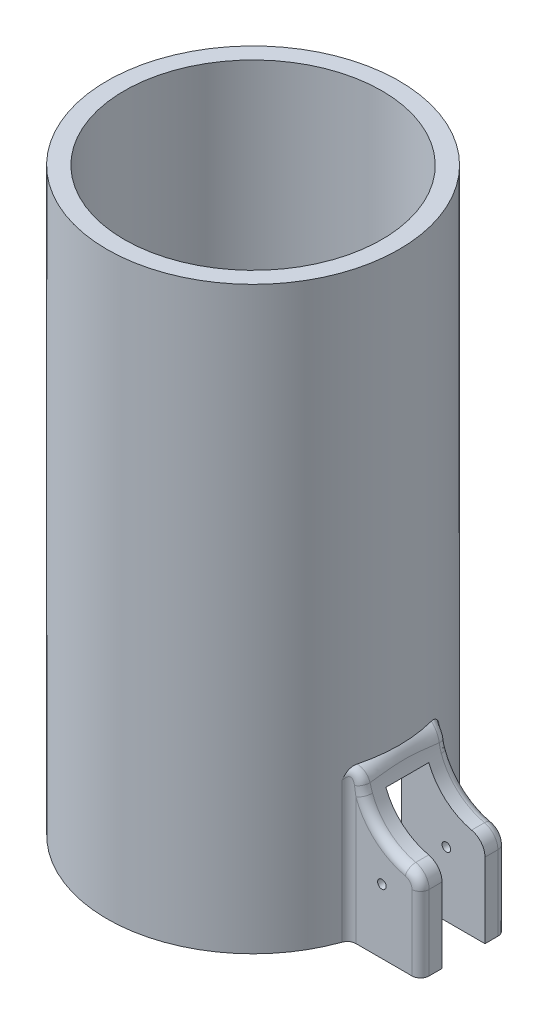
ISO-10303-21;
HEADER;
FILE_DESCRIPTION(('STEP AP214'),'2;1');
FILE_NAME('part.step','',(''),(''),'','','');
FILE_SCHEMA(('AUTOMOTIVE_DESIGN { 1 0 10303 214 1 1 1 1 }'));
ENDSEC;
DATA;
#1=APPLICATION_CONTEXT('core data for automotive mechanical design processes');
#2=APPLICATION_PROTOCOL_DEFINITION('international standard','automotive_design',2000,#1);
#3=PRODUCT_CONTEXT('',#1,'mechanical');
#4=PRODUCT('Part','Part','',(#3));
#5=PRODUCT_RELATED_PRODUCT_CATEGORY('part','',(#4));
#6=PRODUCT_DEFINITION_FORMATION('','',#4);
#7=PRODUCT_DEFINITION_CONTEXT('part definition',#1,'design');
#8=PRODUCT_DEFINITION('design','',#6,#7);
#9=PRODUCT_DEFINITION_SHAPE('','',#8);
#10=(LENGTH_UNIT() NAMED_UNIT(*) SI_UNIT(.MILLI.,.METRE.));
#11=(NAMED_UNIT(*) PLANE_ANGLE_UNIT() SI_UNIT($,.RADIAN.));
#12=(NAMED_UNIT(*) SI_UNIT($,.STERADIAN.) SOLID_ANGLE_UNIT());
#13=UNCERTAINTY_MEASURE_WITH_UNIT(LENGTH_MEASURE(1.E-05),#10,'distance_accuracy_value','');
#14=(GEOMETRIC_REPRESENTATION_CONTEXT(3) GLOBAL_UNCERTAINTY_ASSIGNED_CONTEXT((#13)) GLOBAL_UNIT_ASSIGNED_CONTEXT((#10,
#11,#12)) REPRESENTATION_CONTEXT('',''));
#15=CARTESIAN_POINT('',(0.,0.,0.));
#16=DIRECTION('',(0.,0.,1.));
#17=DIRECTION('',(1.,0.,0.));
#18=AXIS2_PLACEMENT_3D('',#15,#16,#17);
#19=CARTESIAN_POINT('',(62.23,0.,0.));
#20=DIRECTION('',(-1.,0.,0.));
#21=DIRECTION('',(0.,0.,1.));
#22=AXIS2_PLACEMENT_3D('',#19,#20,#21);
#23=PLANE('',#22);
#24=DIRECTION('',(0.,0.,1.));
#25=VECTOR('',#24,1.);
#26=CARTESIAN_POINT('',(62.23,22.161590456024,0.));
#27=LINE('',#26,#25);
#28=CARTESIAN_POINT('',(62.23,22.161590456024,-10.16));
#29=VERTEX_POINT('',#28);
#30=CARTESIAN_POINT('',(62.23,22.161590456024,-6.35));
#31=VERTEX_POINT('',#30);
#32=EDGE_CURVE('E230',#29,#31,#27,.T.);
#33=ORIENTED_EDGE('',*,*,#32,.T.);
#34=DIRECTION('',(0.,1.,0.));
#35=VECTOR('',#34,1.);
#36=CARTESIAN_POINT('',(62.23,0.,-6.35));
#37=LINE('',#36,#35);
#38=CARTESIAN_POINT('',(62.23,0.,-6.35));
#39=VERTEX_POINT('',#38);
#40=EDGE_CURVE('E437',#39,#31,#37,.T.);
#41=ORIENTED_EDGE('',*,*,#40,.F.);
#42=DIRECTION('',(0.,0.,-1.));
#43=VECTOR('',#42,1.);
#44=CARTESIAN_POINT('',(62.23,0.,12.7));
#45=LINE('',#44,#43);
#46=CARTESIAN_POINT('',(62.23,0.,-10.16));
#47=VERTEX_POINT('',#46);
#48=EDGE_CURVE('E208',#39,#47,#45,.T.);
#49=ORIENTED_EDGE('',*,*,#48,.T.);
#50=DIRECTION('',(0.,1.,0.));
#51=VECTOR('',#50,1.);
#52=CARTESIAN_POINT('',(62.23,0.,-10.16));
#53=LINE('',#52,#51);
#54=EDGE_CURVE('E481',#47,#29,#53,.T.);
#55=ORIENTED_EDGE('',*,*,#54,.T.);
#56=EDGE_LOOP('',(#33,#41,#49,#55));
#57=FACE_BOUND('',#56,.T.);
#58=ADVANCED_FACE('F37',(#57),#23,.F.);
#59=CARTESIAN_POINT('',(57.15,22.161590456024,-43.18));
#60=DIRECTION('',(0.,0.,1.));
#61=DIRECTION('',(1.,0.,0.));
#62=AXIS2_PLACEMENT_3D('',#59,#60,#61);
#63=CYLINDRICAL_SURFACE('',#62,5.08);
#64=CARTESIAN_POINT('',(57.15,22.161590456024,-6.35));
#65=DIRECTION('',(0.,0.,-1.));
#66=DIRECTION('',(-1.,0.,0.));
#67=AXIS2_PLACEMENT_3D('',#64,#65,#66);
#68=CIRCLE('',#67,5.08);
#69=CARTESIAN_POINT('',(58.2788888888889,27.1145703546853,-6.35));
#70=VERTEX_POINT('',#69);
#71=EDGE_CURVE('E186',#70,#31,#68,.T.);
#72=ORIENTED_EDGE('',*,*,#71,.T.);
#73=ORIENTED_EDGE('',*,*,#32,.F.);
#74=CARTESIAN_POINT('',(57.15,22.161590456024,-10.16));
#75=DIRECTION('',(0.,0.,1.));
#76=DIRECTION('',(1.,0.,0.));
#77=AXIS2_PLACEMENT_3D('',#74,#75,#76);
#78=CIRCLE('',#77,5.08);
#79=CARTESIAN_POINT('',(58.2788888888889,27.1145703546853,-10.16));
#80=VERTEX_POINT('',#79);
#81=EDGE_CURVE('E486',#29,#80,#78,.T.);
#82=ORIENTED_EDGE('',*,*,#81,.T.);
#83=DIRECTION('',(0.,0.,1.));
#84=VECTOR('',#83,1.);
#85=CARTESIAN_POINT('',(58.2788888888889,27.1145703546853,-43.18));
#86=LINE('',#85,#84);
#87=EDGE_CURVE('E242',#70,#80,#86,.F.);
#88=ORIENTED_EDGE('',*,*,#87,.F.);
#89=EDGE_LOOP('',(#72,#73,#82,#88));
#90=FACE_BOUND('',#89,.T.);
#91=ADVANCED_FACE('F393',(#90),#63,.T.);
#92=CARTESIAN_POINT('',(0.,171.45,0.));
#93=DIRECTION('',(0.,-1.,0.));
#94=DIRECTION('',(0.,0.,-1.));
#95=AXIS2_PLACEMENT_3D('',#92,#93,#94);
#96=CYLINDRICAL_SURFACE('',#95,43.18);
#97=CARTESIAN_POINT('',(0.,171.45,0.));
#98=DIRECTION('',(0.,1.,0.));
#99=DIRECTION('',(0.,0.,1.));
#100=AXIS2_PLACEMENT_3D('',#97,#98,#99);
#101=CIRCLE('',#100,43.18);
#102=CARTESIAN_POINT('',(0.,171.45,43.18));
#103=VERTEX_POINT('',#102);
#104=EDGE_CURVE('E224',#103,#103,#101,.T.);
#105=ORIENTED_EDGE('',*,*,#104,.F.);
#106=EDGE_LOOP('',(#105));
#107=FACE_BOUND('',#106,.T.);
#108=CARTESIAN_POINT('',(0.,44.45,0.));
#109=DIRECTION('',(0.,1.,0.));
#110=DIRECTION('',(0.,0.,1.));
#111=AXIS2_PLACEMENT_3D('',#108,#109,#110);
#112=CIRCLE('',#111,43.18);
#113=CARTESIAN_POINT('',(41.7662048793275,44.45,-10.9588562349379));
#114=VERTEX_POINT('',#113);
#115=CARTESIAN_POINT('',(41.7662048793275,44.45,10.9588562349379));
#116=VERTEX_POINT('',#115);
#117=EDGE_CURVE('E206',#114,#116,#112,.F.);
#118=ORIENTED_EDGE('',*,*,#117,.F.);
#119=CARTESIAN_POINT('',(44.8423287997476,40.7355296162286,20.6660907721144));
#120=CARTESIAN_POINT('',(43.684219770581,46.1567113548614,19.7811601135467));
#121=CARTESIAN_POINT('',(38.3369865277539,44.45,19.8692693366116));
#122=CARTESIAN_POINT('',(44.8524760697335,40.6881595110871,20.2753423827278));
#123=CARTESIAN_POINT('',(43.7139856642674,45.9464069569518,19.5262633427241));
#124=CARTESIAN_POINT('',(38.4931217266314,44.45,19.568036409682));
#125=CARTESIAN_POINT('',(44.8610324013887,40.6489221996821,19.8830304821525));
#126=CARTESIAN_POINT('',(43.7445298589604,45.7501268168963,19.2464464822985));
#127=CARTESIAN_POINT('',(38.647662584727,44.45,19.2611422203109));
#128=CARTESIAN_POINT('',(44.8751450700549,40.584934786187,19.0965861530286));
#129=CARTESIAN_POINT('',(43.8046939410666,45.3908998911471,18.6566617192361));
#130=CARTESIAN_POINT('',(38.9525681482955,44.45,18.6367969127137));
#131=CARTESIAN_POINT('',(44.8807031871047,40.5601760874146,18.7024549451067));
#132=CARTESIAN_POINT('',(43.8344321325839,45.2263875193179,18.3467453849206));
#133=CARTESIAN_POINT('',(39.1029352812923,44.45,18.3193521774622));
#134=CARTESIAN_POINT('',(44.8890013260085,40.5233669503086,17.9143133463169));
#135=CARTESIAN_POINT('',(43.8918958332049,44.9264922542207,17.7063502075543));
#136=CARTESIAN_POINT('',(39.398280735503,44.45,17.6752124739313));
#137=CARTESIAN_POINT('',(44.8917491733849,40.5112812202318,17.5203056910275));
#138=CARTESIAN_POINT('',(43.9197493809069,44.7899009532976,17.3756913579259));
#139=CARTESIAN_POINT('',(39.5432729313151,44.45,17.3485458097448));
#140=CARTESIAN_POINT('',(44.8947171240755,40.4982396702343,16.7319312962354));
#141=CARTESIAN_POINT('',(43.973051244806,44.5412217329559,16.6984643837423));
#142=CARTESIAN_POINT('',(39.8275924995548,44.45,16.6854859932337));
#143=CARTESIAN_POINT('',(44.8949368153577,40.4972856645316,16.3375645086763));
#144=CARTESIAN_POINT('',(43.9986151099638,44.42829060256,16.3514921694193));
#145=CARTESIAN_POINT('',(39.9669189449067,44.45,16.3490912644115));
#146=CARTESIAN_POINT('',(44.8922469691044,40.509075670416,15.1570279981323));
#147=CARTESIAN_POINT('',(44.0703553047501,44.1251582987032,15.3054883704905));
#148=CARTESIAN_POINT('',(40.374564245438,44.45,15.3278518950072));
#149=CARTESIAN_POINT('',(44.8860094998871,40.5363799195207,14.3711004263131));
#150=CARTESIAN_POINT('',(44.1138238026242,43.9598871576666,14.5752167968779));
#151=CARTESIAN_POINT('',(40.6334247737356,44.45,14.6290554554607));
#152=CARTESIAN_POINT('',(44.8673646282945,40.6199955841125,12.8017062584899));
#153=CARTESIAN_POINT('',(44.1893259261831,43.6951615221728,13.0882605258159));
#154=CARTESIAN_POINT('',(41.1210769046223,44.45,13.1963116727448));
#155=CARTESIAN_POINT('',(44.8549532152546,40.6763258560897,12.0182415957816));
#156=CARTESIAN_POINT('',(44.221949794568,43.5928557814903,12.3275979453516));
#157=CARTESIAN_POINT('',(41.3498488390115,44.45,12.4623417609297));
#158=CARTESIAN_POINT('',(44.8325438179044,40.7814080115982,10.7667665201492));
#159=CARTESIAN_POINT('',(44.2662825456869,43.4675442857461,11.0909414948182));
#160=CARTESIAN_POINT('',(41.6881961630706,44.45,11.2616907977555));
#161=CARTESIAN_POINT('',(44.8235644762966,40.8241874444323,10.2978537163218));
#162=CARTESIAN_POINT('',(44.2811244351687,43.4290829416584,10.6252516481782));
#163=CARTESIAN_POINT('',(41.8088620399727,44.45,10.8054522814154));
#164=CARTESIAN_POINT('',(44.8051054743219,40.9139659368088,9.3607114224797));
#165=CARTESIAN_POINT('',(44.3076243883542,43.3662668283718,9.68836003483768));
#166=CARTESIAN_POINT('',(42.0367848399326,44.45,9.88167171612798));
#167=CARTESIAN_POINT('',(44.7956258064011,40.9609650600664,8.89248194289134));
#168=CARTESIAN_POINT('',(44.3193467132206,43.3416784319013,9.21634979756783));
#169=CARTESIAN_POINT('',(42.1440415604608,44.45,9.4141294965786));
#170=CARTESIAN_POINT('',(44.7767930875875,41.0564275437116,7.95614141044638));
#171=CARTESIAN_POINT('',(44.3400160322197,43.3035978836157,8.26748299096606));
#172=CARTESIAN_POINT('',(42.3442608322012,44.45,8.46816226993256));
#173=CARTESIAN_POINT('',(44.7674400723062,41.1048913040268,7.48803042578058));
#174=CARTESIAN_POINT('',(44.3490096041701,43.2899592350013,7.7898295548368));
#175=CARTESIAN_POINT('',(42.4372194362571,44.45,7.98973429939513));
#176=CARTESIAN_POINT('',(44.7494586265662,41.2001658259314,6.55149665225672));
#177=CARTESIAN_POINT('',(44.3646357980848,43.2708363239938,6.8302917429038));
#178=CARTESIAN_POINT('',(42.6079082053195,44.45,7.02278928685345));
#179=CARTESIAN_POINT('',(44.7408302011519,41.246976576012,6.08307386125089));
#180=CARTESIAN_POINT('',(44.3713020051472,43.2652659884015,6.34761951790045));
#181=CARTESIAN_POINT('',(42.6856382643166,44.45,6.53427217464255));
#182=CARTESIAN_POINT('',(44.7248886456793,41.3352796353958,5.14815286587));
#183=CARTESIAN_POINT('',(44.3826310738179,43.2594118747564,5.3813159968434));
#184=CARTESIAN_POINT('',(42.824570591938,44.45,5.55099945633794));
#185=CARTESIAN_POINT('',(44.7175680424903,41.3768017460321,4.68165965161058));
#186=CARTESIAN_POINT('',(44.3873279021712,43.2590571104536,4.89694726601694));
#187=CARTESIAN_POINT('',(42.885867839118,44.45,5.05629779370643));
#188=CARTESIAN_POINT('',(44.7046436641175,41.451378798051,3.74752503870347));
#189=CARTESIAN_POINT('',(44.3951075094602,43.2608718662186,3.92504739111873));
#190=CARTESIAN_POINT('',(42.9916993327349,44.45,4.05924150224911));
#191=CARTESIAN_POINT('',(44.6990397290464,41.4844345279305,3.27988375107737));
#192=CARTESIAN_POINT('',(44.3982049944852,43.2630299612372,3.43672787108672));
#193=CARTESIAN_POINT('',(43.0362351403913,44.45,3.55688759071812));
#194=CARTESIAN_POINT('',(44.6899194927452,41.5388573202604,2.34390014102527));
#195=CARTESIAN_POINT('',(44.4030419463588,43.2675573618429,2.45831476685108));
#196=CARTESIAN_POINT('',(43.1077865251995,44.45,2.54697443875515));
#197=CARTESIAN_POINT('',(44.686401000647,41.5602366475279,1.8755590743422));
#198=CARTESIAN_POINT('',(44.4047913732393,43.2699294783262,1.9674210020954));
#199=CARTESIAN_POINT('',(43.1348204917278,44.45,2.0394212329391));
#200=CARTESIAN_POINT('',(44.681682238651,41.5890261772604,0.938143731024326));
#201=CARTESIAN_POINT('',(44.4071018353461,43.2732791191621,0.984758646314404));
#202=CARTESIAN_POINT('',(43.1709263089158,44.45,1.02124359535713));
#203=CARTESIAN_POINT('',(44.6804818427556,41.596437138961,0.46906949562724));
#204=CARTESIAN_POINT('',(44.4076668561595,43.2742618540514,0.492170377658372));
#205=CARTESIAN_POINT('',(43.1799991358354,44.45,0.510619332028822));
#206=CARTESIAN_POINT('',(44.6804811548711,41.5964442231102,-0.424062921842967));
#207=CARTESIAN_POINT('',(44.4076664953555,43.2742666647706,-0.444947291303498));
#208=CARTESIAN_POINT('',(43.1800007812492,44.45,-0.461626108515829));
#209=CARTESIAN_POINT('',(44.6814616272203,41.5903935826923,-0.84812196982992));
#210=CARTESIAN_POINT('',(44.407204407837,43.2734678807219,-0.890195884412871));
#211=CARTESIAN_POINT('',(43.1725869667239,44.45,-0.923248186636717));
#212=CARTESIAN_POINT('',(44.6853268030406,41.5667759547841,-1.69569096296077));
#213=CARTESIAN_POINT('',(44.4053217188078,43.2706705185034,-1.77882725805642));
#214=CARTESIAN_POINT('',(43.1430590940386,44.45,-1.84421366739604));
#215=CARTESIAN_POINT('',(44.6882115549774,41.5492086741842,-2.11920089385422));
#216=CARTESIAN_POINT('',(44.403898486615,43.2686683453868,-2.22281643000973));
#217=CARTESIAN_POINT('',(43.1209446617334,44.45,-2.30355701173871));
#218=CARTESIAN_POINT('',(44.6957277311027,41.5041200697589,-2.96565283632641));
#219=CARTESIAN_POINT('',(44.3999879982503,43.2645458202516,-3.10824412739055));
#220=CARTESIAN_POINT('',(43.06233869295,44.45,-3.21833310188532));
#221=CARTESIAN_POINT('',(44.700360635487,41.4765903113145,-3.38859406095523));
#222=CARTESIAN_POINT('',(44.3974942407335,43.2624222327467,-3.55027684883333));
#223=CARTESIAN_POINT('',(43.0258349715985,44.45,-3.67376219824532));
#224=CARTESIAN_POINT('',(44.7111227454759,41.4138271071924,-4.23350966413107));
#225=CARTESIAN_POINT('',(44.3912752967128,43.2596471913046,-4.4307123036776));
#226=CARTESIAN_POINT('',(42.9389547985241,44.45,-4.5787840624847));
#227=CARTESIAN_POINT('',(44.717252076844,41.3785930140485,-4.65548395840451));
#228=CARTESIAN_POINT('',(44.387540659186,43.2590000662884,-4.86970071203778));
#229=CARTESIAN_POINT('',(42.8885771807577,44.45,-5.02837633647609));
#230=CARTESIAN_POINT('',(44.7307291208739,41.3027142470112,-5.501286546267));
#231=CARTESIAN_POINT('',(44.3785929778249,43.261060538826,-5.74632599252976));
#232=CARTESIAN_POINT('',(42.774184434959,44.45,-5.9233760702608));
#233=CARTESIAN_POINT('',(44.738084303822,41.2620367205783,-5.92510965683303));
#234=CARTESIAN_POINT('',(44.3733564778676,43.2638097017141,-6.1845069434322));
#235=CARTESIAN_POINT('',(42.7100849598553,44.45,-6.36873899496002));
#236=CARTESIAN_POINT('',(44.7536046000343,41.1780237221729,-6.77227752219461));
#237=CARTESIAN_POINT('',(44.3611544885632,43.2747390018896,-7.05633917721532));
#238=CARTESIAN_POINT('',(42.5690887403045,44.45,-7.25154488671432));
#239=CARTESIAN_POINT('',(44.7617696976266,41.134688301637,-7.19562228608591));
#240=CARTESIAN_POINT('',(44.354168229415,43.2829650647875,-7.49057318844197));
#241=CARTESIAN_POINT('',(42.4921922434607,44.45,-7.68898800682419));
#242=CARTESIAN_POINT('',(44.7784884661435,41.0477801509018,-8.04225463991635));
#243=CARTESIAN_POINT('',(44.3381815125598,43.306933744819,-8.35419787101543));
#244=CARTESIAN_POINT('',(42.3262628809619,44.45,-8.55537317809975));
#245=CARTESIAN_POINT('',(44.7870421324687,41.0042074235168,-8.46554223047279));
#246=CARTESIAN_POINT('',(44.3291522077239,43.3227581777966,-8.78417216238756));
#247=CARTESIAN_POINT('',(42.2372301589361,44.45,-8.98431532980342));
#248=CARTESIAN_POINT('',(44.804086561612,40.9190158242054,-9.31244205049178));
#249=CARTESIAN_POINT('',(44.3087971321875,43.3640051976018,-9.63881229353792));
#250=CARTESIAN_POINT('',(42.0476967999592,44.45,-9.83324794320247));
#251=CARTESIAN_POINT('',(44.8125773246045,40.877396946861,-9.73605427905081));
#252=CARTESIAN_POINT('',(44.2974325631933,43.389556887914,-10.0640685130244));
#253=CARTESIAN_POINT('',(41.9471961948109,44.45,-10.2532384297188));
#254=CARTESIAN_POINT('',(44.8377052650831,40.7563209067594,-11.0312540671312));
#255=CARTESIAN_POINT('',(44.25850815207,43.4862133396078,-11.362431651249));
#256=CARTESIAN_POINT('',(41.6236626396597,44.45,-11.5221042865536));
#257=CARTESIAN_POINT('',(44.853485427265,40.6832725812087,-11.9039166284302));
#258=CARTESIAN_POINT('',(44.2266687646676,43.5769795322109,-12.2219476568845));
#259=CARTESIAN_POINT('',(41.3832273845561,44.45,-12.3559440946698));
#260=CARTESIAN_POINT('',(44.8786070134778,40.5691110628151,-13.6523976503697));
#261=CARTESIAN_POINT('',(44.1504866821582,43.8266160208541,-13.9026998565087));
#262=CARTESIAN_POINT('',(40.8629849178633,44.45,-13.9805356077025));
#263=CARTESIAN_POINT('',(44.8879546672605,40.5279669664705,-14.5282122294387));
#264=CARTESIAN_POINT('',(44.1054281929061,43.9887208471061,-14.7294358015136));
#265=CARTESIAN_POINT('',(40.5832161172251,44.45,-14.7713283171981));
#266=CARTESIAN_POINT('',(44.8942279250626,40.5003881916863,-15.843589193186));
#267=CARTESIAN_POINT('',(44.0294308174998,44.2963934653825,-15.9123439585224));
#268=CARTESIAN_POINT('',(40.1387594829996,44.45,-15.9236382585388));
#269=CARTESIAN_POINT('',(44.8950262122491,40.4968911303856,-16.2825277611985));
#270=CARTESIAN_POINT('',(44.0020774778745,44.4125493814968,-16.3046622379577));
#271=CARTESIAN_POINT('',(39.9863970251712,44.45,-16.3022625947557));
#272=CARTESIAN_POINT('',(44.8936102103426,40.5030995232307,-17.1601822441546));
#273=CARTESIAN_POINT('',(43.9445298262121,44.6717761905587,-17.0703309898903));
#274=CARTESIAN_POINT('',(39.6743597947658,44.45,-17.0476013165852));
#275=CARTESIAN_POINT('',(44.8913965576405,40.5128021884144,-17.5988981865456));
#276=CARTESIAN_POINT('',(43.9141817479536,44.8159000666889,-17.444278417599));
#277=CARTESIAN_POINT('',(39.5146865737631,44.45,-17.4143182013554));
#278=CARTESIAN_POINT('',(44.883566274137,40.5474403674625,-18.4770382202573));
#279=CARTESIAN_POINT('',(43.8511279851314,45.1361503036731,-18.1681831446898));
#280=CARTESIAN_POINT('',(39.1883603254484,44.45,-18.1367719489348));
#281=CARTESIAN_POINT('',(44.8779366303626,40.5724341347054,-18.9164585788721));
#282=CARTESIAN_POINT('',(43.8182454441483,45.3138592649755,-18.5184263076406));
#283=CARTESIAN_POINT('',(39.0216828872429,44.45,-18.4924613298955));
#284=CARTESIAN_POINT('',(44.8667112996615,40.6231351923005,-19.5739771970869));
#285=CARTESIAN_POINT('',(43.7685432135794,45.605575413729,-19.0127362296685));
#286=CARTESIAN_POINT('',(38.7676996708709,44.45,-19.0161921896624));
#287=CARTESIAN_POINT('',(44.8625037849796,40.6422476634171,-19.792969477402));
#288=CARTESIAN_POINT('',(43.7516624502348,45.7086787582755,-19.1745105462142));
#289=CARTESIAN_POINT('',(38.6823421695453,44.45,-19.1892031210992));
#290=CARTESIAN_POINT('',(44.8531365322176,40.6852316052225,-20.2301749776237));
#291=CARTESIAN_POINT('',(43.7178490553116,45.9250942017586,-19.4872497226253));
#292=CARTESIAN_POINT('',(38.5104802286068,44.45,-19.5318217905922));
#293=CARTESIAN_POINT('',(44.8479766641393,40.709103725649,-20.4483880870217));
#294=CARTESIAN_POINT('',(43.7008976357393,46.038715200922,-19.6381727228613));
#295=CARTESIAN_POINT('',(38.4239756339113,44.45,-19.7014290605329));
#296=CARTESIAN_POINT('',(44.8423287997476,40.7355296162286,-20.6660907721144));
#297=CARTESIAN_POINT('',(43.6842197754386,46.1567113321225,-19.7811600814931));
#298=CARTESIAN_POINT('',(38.3369865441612,44.45,-19.8692693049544));
#299=(BOUNDED_SURFACE() B_SPLINE_SURFACE(3,2,((#119,#120,#121),(#122,#123,#124),(#125,#126,
#127),(#128,#129,#130),(#131,#132,#133),(#134,#135,#136),(#137,#138,#139),(#140,#141,#142),
(#143,#144,#145),(#146,#147,#148),(#149,#150,#151),(#152,#153,#154),(#155,#156,#157),(#158,#159,
#160),(#161,#162,#163),(#164,#165,#166),(#167,#168,#169),(#170,#171,#172),(#173,#174,#175),
(#176,#177,#178),(#179,#180,#181),(#182,#183,#184),(#185,#186,#187),(#188,#189,#190),(#191,#192,
#193),(#194,#195,#196),(#197,#198,#199),(#200,#201,#202),(#203,#204,#205),(#206,#207,#208),
(#209,#210,#211),(#212,#213,#214),(#215,#216,#217),(#218,#219,#220),(#221,#222,#223),(#224,#225,
#226),(#227,#228,#229),(#230,#231,#232),(#233,#234,#235),(#236,#237,#238),(#239,#240,#241),
(#242,#243,#244),(#245,#246,#247),(#248,#249,#250),(#251,#252,#253),(#254,#255,#256),(#257,#258,
#259),(#260,#261,#262),(#263,#264,#265),(#266,#267,#268),(#269,#270,#271),(#272,#273,#274),
(#275,#276,#277),(#278,#279,#280),(#281,#282,#283),(#284,#285,#286),(#287,#288,#289),(#290,#291,
#292),(#293,#294,#295),(#296,#297,#298)),.UNSPECIFIED.,.F.,.F.,
.F.) B_SPLINE_SURFACE_WITH_KNOTS((4,2,2,2,2,2,2,2,2,2,2,2,2,2,2,2,2,2,2,2,2,2,2,2,2,2,2,2,2,4),
(3,3),(0.,1.1867049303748,2.37270453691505,3.55539252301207,4.73827325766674,7.09707521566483,
9.45741148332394,10.8741825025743,12.2909749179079,13.708157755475,15.1253504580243,
16.5341662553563,17.9428507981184,19.3500528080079,20.7571783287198,22.0292920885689,
23.3014382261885,24.5746639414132,25.8479966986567,27.1293935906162,28.4107656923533,
29.6921226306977,30.9734760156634,33.606795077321,36.2375602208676,37.5541632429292,
38.870488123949,40.1918592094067,40.8530787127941,41.5143885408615),(0.,1.),
.UNSPECIFIED.) GEOMETRIC_REPRESENTATION_ITEM() RATIONAL_B_SPLINE_SURFACE(((1.,0.670982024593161,
1.),(1.,0.6831736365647,1.),(1.,0.694756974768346,1.),(1.,0.716817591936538,1.),(1.,
0.727295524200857,1.),(1.,0.747242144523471,1.),(1.,0.756713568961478,1.),(1.,0.774772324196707,
1.),(1.,0.78335951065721,1.),(1.,0.807864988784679,1.),(1.,0.822584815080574,1.),(1.,
0.849284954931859,1.),(1.,0.861263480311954,1.),(1.,0.878467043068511,1.),(1.,0.884477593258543,
1.),(1.,0.895655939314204,1.),(1.,0.900823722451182,1.),(1.,0.910348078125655,1.),(1.,
0.914704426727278,1.),(1.,0.922621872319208,1.),(1.,0.926182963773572,1.),(1.,0.932498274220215,
1.),(1.,0.935257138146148,1.),(1.,0.939994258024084,1.),(1.,0.941972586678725,1.),(1.,
0.945140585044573,1.),(1.,0.946331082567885,1.),(1.,0.947919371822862,1.),(1.,0.948317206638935,
1.),(1.,0.948317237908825,1.),(1.,0.947992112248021,1.),(1.,0.94669371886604,1.),(1.,
0.945720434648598,1.),(1.,0.943129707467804,1.),(1.,0.941511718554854,1.),(1.,0.937636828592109,
1.),(1.,0.935379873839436,1.),(1.,0.930213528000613,1.),(1.,0.927300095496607,1.),(1.,
0.920826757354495,1.),(1.,0.91726686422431,1.),(1.,0.909491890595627,1.),(1.,0.905276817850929,
1.),(1.,0.89617448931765,1.),(1.,0.891287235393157,1.),(1.,0.875294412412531,1.),(1.,
0.863068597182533,1.),(1.,0.835355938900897,1.),(1.,0.819872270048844,1.),(1.,0.793765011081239,
1.),(1.,0.784577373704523,1.),(1.,0.76514192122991,1.),(1.,0.754894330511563,1.),(1.,
0.733175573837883,1.),(1.,0.72169986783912,1.),(1.,0.703476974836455,1.),(1.,0.697231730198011,
1.),(1.,0.684381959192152,1.),(1.,0.677777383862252,1.),(1.,0.670982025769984,1.))) REPRESENTATION_ITEM('') SURFACE());
#300=CARTESIAN_POINT('',(42.7364066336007,39.4613951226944,-12.7269202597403));
#301=CARTESIAN_POINT('',(43.6929906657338,39.3356392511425,-12.586530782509));
#302=CARTESIAN_POINT('',(44.3091610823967,39.2421821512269,-11.836746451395));
#303=CARTESIAN_POINT('',(44.9253314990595,39.1487250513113,-11.086962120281));
#304=CARTESIAN_POINT('',(44.8845769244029,39.1355732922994,-10.1129278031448));
#305=CARTESIAN_POINT('',(42.7409753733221,39.5323439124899,-12.7262553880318));
#306=CARTESIAN_POINT('',(43.6999556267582,39.4336783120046,-12.5873010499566));
#307=CARTESIAN_POINT('',(44.3199086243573,39.3603062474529,-11.8398855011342));
#308=CARTESIAN_POINT('',(44.9398528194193,39.2868904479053,-11.0924687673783));
#309=CARTESIAN_POINT('',(44.903083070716,39.2763647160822,-10.1195894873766));
#310=CARTESIAN_POINT('',(42.7440721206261,39.603678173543,-12.7258081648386));
#311=CARTESIAN_POINT('',(43.7038988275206,39.5322118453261,-12.5879347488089));
#312=CARTESIAN_POINT('',(44.3262982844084,39.4790214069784,-11.8430563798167));
#313=CARTESIAN_POINT('',(44.9486953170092,39.425767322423,-11.0981762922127));
#314=CARTESIAN_POINT('',(44.9156938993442,39.4179603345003,-10.1268309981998));
#315=CARTESIAN_POINT('',(42.7473051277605,39.7466260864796,-12.7253428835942));
#316=CARTESIAN_POINT('',(43.7057412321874,39.7294475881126,-12.588921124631));
#317=CARTESIAN_POINT('',(44.3303768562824,39.7166458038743,-11.8494267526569));
#318=CARTESIAN_POINT('',(44.9550127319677,39.703781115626,-11.1099307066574));
#319=CARTESIAN_POINT('',(44.9290579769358,39.7017829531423,-10.1424014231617));
#320=CARTESIAN_POINT('',(42.7474411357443,39.8182397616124,-12.7253248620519));
#321=CARTESIAN_POINT('',(43.7036429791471,39.8281325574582,-12.5892738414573));
#322=CARTESIAN_POINT('',(44.3280650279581,39.8355550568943,-11.8526262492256));
#323=CARTESIAN_POINT('',(44.9524921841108,39.8428937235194,-11.1159764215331));
#324=CARTESIAN_POINT('',(44.9298102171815,39.8440100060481,-10.1507304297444));
#325=CARTESIAN_POINT('',(42.744734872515,39.9612694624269,-12.7257120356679));
#326=CARTESIAN_POINT('',(43.693412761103,40.0248745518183,-12.5896909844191));
#327=CARTESIAN_POINT('',(44.3147513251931,40.0726034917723,-11.859019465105));
#328=CARTESIAN_POINT('',(44.9360941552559,40.1202493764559,-11.1283456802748));
#329=CARTESIAN_POINT('',(44.9193850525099,40.1281473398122,-10.1684057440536));
#330=CARTESIAN_POINT('',(42.7418914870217,40.0326854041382,-12.7261173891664));
#331=CARTESIAN_POINT('',(43.6852836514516,40.1229151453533,-12.5897554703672));
#332=CARTESIAN_POINT('',(44.3037461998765,40.1907423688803,-11.8622131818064));
#333=CARTESIAN_POINT('',(44.9222218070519,40.2584692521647,-11.1346680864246));
#334=CARTESIAN_POINT('',(44.9082031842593,40.2700574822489,-10.1777524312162));
#335=CARTESIAN_POINT('',(42.7332407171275,40.1747559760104,-12.7273833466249));
#336=CARTESIAN_POINT('',(43.6631289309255,40.3174835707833,-12.5897045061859));
#337=CARTESIAN_POINT('',(44.2732322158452,40.4251871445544,-11.8686712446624));
#338=CARTESIAN_POINT('',(44.8833487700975,40.5327887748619,-11.1476352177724));
#339=CARTESIAN_POINT('',(44.8739640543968,40.5524505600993,-10.1974555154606));
#340=CARTESIAN_POINT('',(42.7274335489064,40.2454106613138,-12.7282439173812));
#341=CARTESIAN_POINT('',(43.6491104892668,40.4139982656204,-12.5895892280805));
#342=CARTESIAN_POINT('',(44.2537239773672,40.5414931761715,-11.8719355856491));
#343=CARTESIAN_POINT('',(44.8583613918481,40.6688698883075,-11.1542786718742));
#344=CARTESIAN_POINT('',(44.8509076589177,40.6929335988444,-10.2078118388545));
#345=CARTESIAN_POINT('',(42.7062645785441,40.4490856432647,-12.7314873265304));
#346=CARTESIAN_POINT('',(43.6000468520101,40.6912925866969,-12.5892388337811));
#347=CARTESIAN_POINT('',(44.1849714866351,40.8757806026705,-11.8817392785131));
#348=CARTESIAN_POINT('',(44.7699813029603,41.0598579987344,-11.1742273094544));
#349=CARTESIAN_POINT('',(44.7666967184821,41.0980488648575,-10.2394677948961));
#350=CARTESIAN_POINT('',(42.6870140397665,40.5805438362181,-12.7345429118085));
#351=CARTESIAN_POINT('',(43.5574625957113,40.8692865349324,-12.5889896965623));
#352=CARTESIAN_POINT('',(44.1248054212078,41.0902963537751,-11.888563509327));
#353=CARTESIAN_POINT('',(44.6923135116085,41.3108521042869,-11.1881194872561));
#354=CARTESIAN_POINT('',(44.6899546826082,41.3597088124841,-10.2621729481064));
#355=CARTESIAN_POINT('',(42.6382471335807,40.8351578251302,-12.7431750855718));
#356=CARTESIAN_POINT('',(43.4535811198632,41.2120095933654,-12.5904329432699));
#357=CARTESIAN_POINT('',(43.9772807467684,41.5033423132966,-11.9047716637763));
#358=CARTESIAN_POINT('',(44.5011395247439,41.7942208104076,-11.2190925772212));
#359=CARTESIAN_POINT('',(44.4952741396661,41.8670719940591,-10.312253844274));
#360=CARTESIAN_POINT('',(42.6087351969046,40.9583171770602,-12.748750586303));
#361=CARTESIAN_POINT('',(43.3923411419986,41.3767466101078,-12.5921201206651));
#362=CARTESIAN_POINT('',(43.8899338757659,41.7018793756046,-11.9141544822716));
#363=CARTESIAN_POINT('',(44.3877423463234,42.0266063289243,-11.23616269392));
#364=CARTESIAN_POINT('',(44.3773534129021,42.1127820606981,-10.3396275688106));
#365=CARTESIAN_POINT('',(42.540122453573,41.1931048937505,-12.7634125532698));
#366=CARTESIAN_POINT('',(43.2537867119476,41.6894246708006,-12.6001074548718));
#367=CARTESIAN_POINT('',(43.6915734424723,42.0788721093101,-11.9380256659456));
#368=CARTESIAN_POINT('',(44.1295729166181,42.4679110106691,-11.2759184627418));
#369=CARTESIAN_POINT('',(44.1029587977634,42.5820844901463,-10.4005457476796));
#370=CARTESIAN_POINT('',(42.5009932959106,41.3046977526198,-12.7725094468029));
#371=CARTESIAN_POINT('',(43.1764432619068,41.8373876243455,-12.60641230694));
#372=CARTESIAN_POINT('',(43.5804900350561,42.2572660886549,-11.9525291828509));
#373=CARTESIAN_POINT('',(43.9847454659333,42.6768612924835,-11.298613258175));
#374=CARTESIAN_POINT('',(43.9463709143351,42.8056086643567,-10.4341083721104));
#375=CARTESIAN_POINT('',(42.4144888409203,41.5121073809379,-12.7953183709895));
#376=CARTESIAN_POINT('',(43.0094572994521,42.112310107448,-12.6265206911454));
#377=CARTESIAN_POINT('',(43.3396819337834,42.5890966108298,-11.989385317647));
#378=CARTESIAN_POINT('',(43.6701127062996,43.0655948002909,-11.352219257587));
#379=CARTESIAN_POINT('',(43.599945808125,43.2223966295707,-10.508949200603));
#380=CARTESIAN_POINT('',(42.3671170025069,41.6079307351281,-12.8090284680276));
#381=CARTESIAN_POINT('',(42.9197875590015,42.2394026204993,-12.6403146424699));
#382=CARTESIAN_POINT('',(43.2099650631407,42.7425435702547,-12.0117346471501));
#383=CARTESIAN_POINT('',(43.5002599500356,43.2455649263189,-11.3831300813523));
#384=CARTESIAN_POINT('',(43.4101225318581,43.415673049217,-10.5502241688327));
#385=CARTESIAN_POINT('',(42.2687092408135,41.7759705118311,-12.8411743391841));
#386=CARTESIAN_POINT('',(42.7375291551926,42.4639318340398,-12.6768656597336));
#387=CARTESIAN_POINT('',(42.9449264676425,43.0141977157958,-12.0652143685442));
#388=CARTESIAN_POINT('',(43.1524336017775,43.5643503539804,-11.4535417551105));
#389=CARTESIAN_POINT('',(43.0155116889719,43.7564560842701,-10.639437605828));
#390=CARTESIAN_POINT('',(42.2179965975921,41.8491627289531,-12.8593239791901));
#391=CARTESIAN_POINT('',(42.6452668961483,42.5626935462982,-12.699122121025));
#392=CARTESIAN_POINT('',(42.8102573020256,43.1338328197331,-12.0958217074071));
#393=CARTESIAN_POINT('',(42.9752153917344,43.7049975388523,-11.4925289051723));
#394=CARTESIAN_POINT('',(42.8120343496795,43.9058339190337,-10.6869120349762));
#395=CARTESIAN_POINT('',(42.1130213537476,41.976517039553,-12.9011313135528));
#396=CARTESIAN_POINT('',(42.458015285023,42.7379373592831,-12.7537960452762));
#397=CARTESIAN_POINT('',(42.5351426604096,43.3468121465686,-12.1674093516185));
#398=CARTESIAN_POINT('',(42.6122421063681,43.955708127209,-11.5810307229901));
#399=CARTESIAN_POINT('',(42.3905625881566,44.1681058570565,-10.7905497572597));
#400=CARTESIAN_POINT('',(42.0587600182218,42.0306858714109,-12.9247870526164));
#401=CARTESIAN_POINT('',(42.3629161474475,42.8145255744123,-12.7862442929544));
#402=CARTESIAN_POINT('',(42.3946992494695,43.4401656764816,-12.2083859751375));
#403=CARTESIAN_POINT('',(42.4262746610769,44.0659231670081,-11.630596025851));
#404=CARTESIAN_POINT('',(42.1725733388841,44.2810128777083,-10.8467099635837));
#405=CARTESIAN_POINT('',(41.9512823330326,42.1177664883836,-12.9765041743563));
#406=CARTESIAN_POINT('',(42.1781822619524,42.9432019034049,-12.8598225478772));
#407=CARTESIAN_POINT('',(42.1195233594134,43.5978214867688,-12.2988706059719));
#408=CARTESIAN_POINT('',(42.0606796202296,44.2525485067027,-11.7379793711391));
#409=CARTESIAN_POINT('',(41.7404833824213,44.4655888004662,-10.9649556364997));
#410=CARTESIAN_POINT('',(41.8981163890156,42.151468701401,-13.004341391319));
#411=CARTESIAN_POINT('',(42.0883712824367,42.9962286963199,-12.9005946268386));
#412=CARTESIAN_POINT('',(41.9847963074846,43.6631705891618,-12.3479528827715));
#413=CARTESIAN_POINT('',(41.8808796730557,44.3302520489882,-11.7954492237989));
#414=CARTESIAN_POINT('',(41.5265980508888,44.5387775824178,-11.0266975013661));
#415=CARTESIAN_POINT('',(41.7924652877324,42.2019959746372,-13.0646927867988));
#416=CARTESIAN_POINT('',(41.9132555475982,43.0840010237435,-12.9907342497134));
#417=CARTESIAN_POINT('',(41.7193689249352,43.7722070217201,-12.454919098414));
#418=CARTESIAN_POINT('',(41.5251376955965,44.4605553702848,-11.9192424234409));
#419=CARTESIAN_POINT('',(41.1012927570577,44.6527187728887,-11.1571634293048));
#420=CARTESIAN_POINT('',(41.7399804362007,42.2188136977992,-13.0972089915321));
#421=CARTESIAN_POINT('',(41.8278611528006,43.1187429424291,-13.0401810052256));
#422=CARTESIAN_POINT('',(41.5886703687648,43.8158849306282,-12.5128068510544));
#423=CARTESIAN_POINT('',(41.348997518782,44.513155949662,-11.9856656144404));
#424=CARTESIAN_POINT('',(40.8898739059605,44.6934570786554,-11.2258905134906));
#425=CARTESIAN_POINT('',(41.6185637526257,42.2408810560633,-13.1788083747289));
#426=CARTESIAN_POINT('',(41.6341442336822,43.1822973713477,-13.1655697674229));
#427=CARTESIAN_POINT('',(41.2884860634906,43.8969181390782,-12.6583344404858));
#428=CARTESIAN_POINT('',(40.941956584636,44.6117756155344,-12.1515225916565));
#429=CARTESIAN_POINT('',(40.4004375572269,44.755503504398,-11.3951686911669));
#430=CARTESIAN_POINT('',(41.5505186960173,42.2397803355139,-13.2296397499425));
#431=CARTESIAN_POINT('',(41.5286821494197,43.2043390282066,-13.2447134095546));
#432=CARTESIAN_POINT('',(41.1219901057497,43.9263266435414,-12.7491796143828));
#433=CARTESIAN_POINT('',(40.7142116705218,44.6484238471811,-12.2543086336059));
#434=CARTESIAN_POINT('',(40.1258671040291,44.7645241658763,-11.4982647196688));
#435=CARTESIAN_POINT('',(41.4204403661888,42.2157842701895,-13.3372998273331));
#436=CARTESIAN_POINT('',(41.3333046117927,43.2266331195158,-13.4124618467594));
#437=CARTESIAN_POINT('',(40.8062593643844,43.9587314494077,-12.940994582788));
#438=CARTESIAN_POINT('',(40.2780941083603,44.6909466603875,-12.4702049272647));
#439=CARTESIAN_POINT('',(39.6004820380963,44.7403702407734,-11.7129678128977));
#440=CARTESIAN_POINT('',(41.3584186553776,42.1928478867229,-13.3941396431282));
#441=CARTESIAN_POINT('',(41.2433672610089,43.2267088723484,-13.5012896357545));
#442=CARTESIAN_POINT('',(40.6570576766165,43.9616779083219,-13.041983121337));
#443=CARTESIAN_POINT('',(40.0695353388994,44.6965808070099,-12.5835855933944));
#444=CARTESIAN_POINT('',(39.3497131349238,44.7071161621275,-11.824590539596));
#445=CARTESIAN_POINT('',(41.214183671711,42.1168470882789,-13.539894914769));
#446=CARTESIAN_POINT('',(41.0418094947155,43.2086815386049,-13.7275341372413));
#447=CARTESIAN_POINT('',(40.3126845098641,43.9461679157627,-13.2988507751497));
#448=CARTESIAN_POINT('',(39.5810062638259,44.6835563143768,-12.8720653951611));
#449=CARTESIAN_POINT('',(38.765974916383,44.5869011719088,-12.1076435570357));
#450=CARTESIAN_POINT('',(41.1358784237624,42.054759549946,-13.6314980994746));
#451=CARTESIAN_POINT('',(40.9400458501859,43.1818474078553,-13.8682411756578));
#452=CARTESIAN_POINT('',(40.1281171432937,43.9171954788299,-13.4585356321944));
#453=CARTESIAN_POINT('',(39.3137645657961,44.6519843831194,-13.0512200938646));
#454=CARTESIAN_POINT('',(38.4485475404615,44.4822265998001,-12.28288165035));
#455=CARTESIAN_POINT('',(41.0297737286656,41.9475261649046,-13.7745158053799));
#456=CARTESIAN_POINT('',(40.8136998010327,43.1313946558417,-14.0796309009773));
#457=CARTESIAN_POINT('',(39.8813463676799,43.8591536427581,-13.7013243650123));
#458=CARTESIAN_POINT('',(38.9483498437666,44.5867558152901,-13.3236478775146));
#459=CARTESIAN_POINT('',(38.0177746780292,44.2970803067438,-12.5541544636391));
#460=CARTESIAN_POINT('',(40.9962393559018,41.9093363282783,-13.8232319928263));
#461=CARTESIAN_POINT('',(40.7757498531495,43.1126823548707,-14.1507435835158));
#462=CARTESIAN_POINT('',(39.803972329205,43.8373145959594,-13.7829722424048));
#463=CARTESIAN_POINT('',(38.8316120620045,44.5617588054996,-13.4158563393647));
#464=CARTESIAN_POINT('',(37.8815072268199,44.2305063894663,-12.6461833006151));
#465=CARTESIAN_POINT('',(40.9328855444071,41.8298271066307,-13.9224343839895));
#466=CARTESIAN_POINT('',(40.7082409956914,43.0736094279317,-14.2920423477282));
#467=CARTESIAN_POINT('',(39.6591270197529,43.7908976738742,-13.9461454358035));
#468=CARTESIAN_POINT('',(38.6094351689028,44.5080020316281,-13.600900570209));
#469=CARTESIAN_POINT('',(37.6238476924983,44.090951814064,-12.8330619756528));
#470=CARTESIAN_POINT('',(40.9030659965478,41.7885078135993,-13.9729205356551));
#471=CARTESIAN_POINT('',(40.6787396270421,43.0532297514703,-14.3622418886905));
#472=CARTESIAN_POINT('',(39.5916554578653,43.7663198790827,-14.0276707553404));
#473=CARTESIAN_POINT('',(38.5040541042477,44.4792040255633,-13.6937687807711));
#474=CARTESIAN_POINT('',(37.5024551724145,44.0179713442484,-12.9279117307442));
#475=CARTESIAN_POINT('',(40.8454570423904,41.7018604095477,-14.0785939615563));
#476=CARTESIAN_POINT('',(40.626363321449,43.0114621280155,-14.504177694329));
#477=CARTESIAN_POINT('',(39.4629079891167,43.7150814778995,-14.1938805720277));
#478=CARTESIAN_POINT('',(38.2988649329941,44.4184670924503,-13.8843405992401));
#479=CARTESIAN_POINT('',(37.2677244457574,43.8642586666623,-13.126123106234));
#480=CARTESIAN_POINT('',(40.8178905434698,41.6564395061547,-14.1338830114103));
#481=CARTESIAN_POINT('',(40.6040694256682,42.9900951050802,-14.5757099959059));
#482=CARTESIAN_POINT('',(39.4022307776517,43.6883834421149,-14.2784684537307));
#483=CARTESIAN_POINT('',(38.1998997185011,44.386440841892,-13.9819652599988));
#484=CARTESIAN_POINT('',(37.1552812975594,43.7833230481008,-13.2296570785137));
#485=CARTESIAN_POINT('',(40.7668444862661,41.5657665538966,-14.2463360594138));
#486=CARTESIAN_POINT('',(40.5681168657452,42.9495835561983,-14.7135985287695));
#487=CARTESIAN_POINT('',(39.2919352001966,43.6366682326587,-14.443751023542));
#488=CARTESIAN_POINT('',(38.0152574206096,44.3235203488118,-14.1746465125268));
#489=CARTESIAN_POINT('',(36.9468269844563,43.6213333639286,-13.4401577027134));
#490=CARTESIAN_POINT('',(40.7433641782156,41.5205144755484,-14.3034997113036));
#491=CARTESIAN_POINT('',(40.5545362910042,42.9304605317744,-14.7799027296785));
#492=CARTESIAN_POINT('',(39.242314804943,43.6116507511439,-14.524446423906));
#493=CARTESIAN_POINT('',(37.929706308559,44.2926389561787,-14.269671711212));
#494=CARTESIAN_POINT('',(36.8508128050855,43.5402793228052,-13.5471237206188));
#495=CARTESIAN_POINT('',(40.7006766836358,41.4325831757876,-14.4193262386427));
#496=CARTESIAN_POINT('',(40.5353430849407,42.8964050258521,-14.9039193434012));
#497=CARTESIAN_POINT('',(39.1544972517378,43.5657580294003,-14.6786111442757));
#498=CARTESIAN_POINT('',(37.7732662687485,44.234909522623,-14.4539768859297));
#499=CARTESIAN_POINT('',(36.6760138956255,43.3826483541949,-13.7639738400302));
#500=CARTESIAN_POINT('',(40.6814375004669,41.3898865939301,-14.4779738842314));
#501=CARTESIAN_POINT('',(40.5297411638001,42.881482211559,-14.9616028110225));
#502=CARTESIAN_POINT('',(39.1162137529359,43.5448519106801,-14.7521320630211));
#503=CARTESIAN_POINT('',(37.7024174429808,44.2080749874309,-14.5432204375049));
#504=CARTESIAN_POINT('',(36.5971002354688,43.3060413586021,-13.8738285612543));
#505=CARTESIAN_POINT('',(40.6556939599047,41.3292357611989,-14.5674380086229));
#506=CARTESIAN_POINT('',(40.5261804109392,42.8630392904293,-15.0394405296));
#507=CARTESIAN_POINT('',(39.0668779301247,43.5177351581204,-14.8550775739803));
#508=CARTESIAN_POINT('',(37.6075072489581,44.1723929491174,-14.6708579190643));
#509=CARTESIAN_POINT('',(36.491304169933,43.1973754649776,-14.0416018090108));
#510=CARTESIAN_POINT('',(40.6476290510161,41.3095763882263,-14.5975220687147));
#511=CARTESIAN_POINT('',(40.5258083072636,42.8575381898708,-15.0640012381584));
#512=CARTESIAN_POINT('',(39.0517759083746,43.5094005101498,-14.8881833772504));
#513=CARTESIAN_POINT('',(37.577689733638,44.1612332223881,-14.7124878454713));
#514=CARTESIAN_POINT('',(36.458122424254,43.1621798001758,-14.0980508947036));
#515=CARTESIAN_POINT('',(40.6325636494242,41.2717206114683,-14.6581917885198));
#516=CARTESIAN_POINT('',(40.526413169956,42.8478640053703,-15.1098588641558));
#517=CARTESIAN_POINT('',(39.0242080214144,43.4942446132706,-14.9515483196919));
#518=CARTESIAN_POINT('',(37.5219494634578,44.1405959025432,-14.793361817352));
#519=CARTESIAN_POINT('',(36.3960581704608,43.0945148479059,-14.2119656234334));
#520=CARTESIAN_POINT('',(40.6255634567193,41.2535246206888,-14.6887775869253));
#521=CARTESIAN_POINT('',(40.5273956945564,42.8436979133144,-15.1311353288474));
#522=CARTESIAN_POINT('',(39.0117428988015,43.4874237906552,-14.9818066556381));
#523=CARTESIAN_POINT('',(37.4960512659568,44.1311284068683,-14.8325839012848));
#524=CARTESIAN_POINT('',(36.3671768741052,43.0620463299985,-14.269431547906));
#525=CARTESIAN_POINT('',(40.6191086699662,41.2362277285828,-14.7196118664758));
#526=CARTESIAN_POINT('',(40.5289087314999,42.840211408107,-15.1505362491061));
#527=CARTESIAN_POINT('',(39.0005653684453,43.4814092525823,-15.0104384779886));
#528=CARTESIAN_POINT('',(37.4722220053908,44.1226070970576,-14.870340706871));
#529=CARTESIAN_POINT('',(36.3404999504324,43.0312666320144,-14.3274073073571));
#530=(BOUNDED_SURFACE() B_SPLINE_SURFACE(3,2,((#300,#301,#302,#303,#304),(#305,#306,#307,#308,
#309),(#310,#311,#312,#313,#314),(#315,#316,#317,#318,#319),(#320,#321,#322,#323,#324),(#325,
#326,#327,#328,#329),(#330,#331,#332,#333,#334),(#335,#336,#337,#338,#339),(#340,#341,#342,#343,
#344),(#345,#346,#347,#348,#349),(#350,#351,#352,#353,#354),(#355,#356,#357,#358,#359),(#360,
#361,#362,#363,#364),(#365,#366,#367,#368,#369),(#370,#371,#372,#373,#374),(#375,#376,#377,#378,
#379),(#380,#381,#382,#383,#384),(#385,#386,#387,#388,#389),(#390,#391,#392,#393,#394),(#395,
#396,#397,#398,#399),(#400,#401,#402,#403,#404),(#405,#406,#407,#408,#409),(#410,#411,#412,#413,
#414),(#415,#416,#417,#418,#419),(#420,#421,#422,#423,#424),(#425,#426,#427,#428,#429),(#430,
#431,#432,#433,#434),(#435,#436,#437,#438,#439),(#440,#441,#442,#443,#444),(#445,#446,#447,#448,
#449),(#450,#451,#452,#453,#454),(#455,#456,#457,#458,#459),(#460,#461,#462,#463,#464),(#465,
#466,#467,#468,#469),(#470,#471,#472,#473,#474),(#475,#476,#477,#478,#479),(#480,#481,#482,#483,
#484),(#485,#486,#487,#488,#489),(#490,#491,#492,#493,#494),(#495,#496,#497,#498,#499),(#500,
#501,#502,#503,#504),(#505,#506,#507,#508,#509),(#510,#511,#512,#513,#514),(#515,#516,#517,#518,
#519),(#520,#521,#522,#523,#524),(#525,#526,#527,#528,#529)),.UNSPECIFIED.,.F.,.F.,
.F.) B_SPLINE_SURFACE_WITH_KNOTS((4,2,2,2,2,2,2,2,2,2,2,2,2,2,2,2,2,2,2,2,2,2,4),(3,2,3),(0.,
0.214575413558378,0.429169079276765,0.643843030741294,0.858501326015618,1.26786678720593,
1.67705570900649,2.08746567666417,2.49770383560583,2.8863880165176,3.27493438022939,
3.64732006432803,4.01986749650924,4.52663059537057,5.03434800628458,5.77660848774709,
6.14930568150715,6.52199192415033,6.91662143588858,7.31117846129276,7.70264836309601,
7.8985601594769,8.09452705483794),(0.,0.5,1.),
.UNSPECIFIED.) GEOMETRIC_REPRESENTATION_ITEM() RATIONAL_B_SPLINE_SURFACE(((1.,0.933585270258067,
1.,0.933585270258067,1.),(1.,0.93375158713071,1.,0.93375158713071,1.),(1.,0.933959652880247,1.,
0.933959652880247,1.),(1.,0.934457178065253,1.,0.934457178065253,1.),(1.,0.934746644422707,1.,
0.934746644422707,1.),(1.,0.93540496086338,1.,0.93540496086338,1.),(1.,0.935773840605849,1.,
0.935773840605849,1.),(1.,0.936581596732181,1.,0.936581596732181,1.),(1.,0.937020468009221,1.,
0.937020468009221,1.),(1.,0.938380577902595,1.,0.938380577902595,1.),(1.,0.939378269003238,1.,
0.939378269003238,1.),(1.,0.941446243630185,1.,0.941446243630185,1.),(1.,0.942516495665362,1.,
0.942516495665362,1.),(1.,0.944554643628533,1.,0.944554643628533,1.),(1.,0.945522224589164,1.,
0.945522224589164,1.),(1.,0.947152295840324,1.,0.947152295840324,1.),(1.,0.947814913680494,1.,
0.947814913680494,1.),(1.,0.948627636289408,1.,0.948627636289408,1.),(1.,0.948802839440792,1.,
0.948802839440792,1.),(1.,0.948595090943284,1.,0.948595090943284,1.),(1.,0.948212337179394,1.,
0.948212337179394,1.),(1.,0.94686174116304,1.,0.94686174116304,1.),(1.,0.945918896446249,1.,
0.945918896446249,1.),(1.,0.943476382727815,1.,0.943476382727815,1.),(1.,0.941976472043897,1.,
0.941976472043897,1.),(1.,0.9378296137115,1.,0.9378296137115,1.),(1.,0.934964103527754,1.,
0.934964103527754,1.),(1.,0.9284535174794,1.,0.9284535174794,1.),(1.,0.924806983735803,1.,
0.924806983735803,1.),(1.,0.915085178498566,1.,0.915085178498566,1.),(1.,0.908666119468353,1.,
0.908666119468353,1.),(1.,0.89846049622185,1.,0.89846049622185,1.),(1.,0.894954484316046,1.,
0.894954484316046,1.),(1.,0.887811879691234,1.,0.887811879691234,1.),(1.,0.884175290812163,1.,
0.884175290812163,1.),(1.,0.876628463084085,1.,0.876628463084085,1.),(1.,0.872714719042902,1.,
0.872714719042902,1.),(1.,0.864928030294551,1.,0.864928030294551,1.),(1.,0.861055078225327,1.,
0.861055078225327,1.),(1.,0.853517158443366,1.,0.853517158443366,1.),(1.,0.849850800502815,1.,
0.849850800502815,1.),(1.,0.844625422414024,1.,0.844625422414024,1.),(1.,0.842928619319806,1.,
0.842928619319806,1.),(1.,0.839657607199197,1.,0.839657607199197,1.),(1.,0.838083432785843,1.,
0.838083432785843,1.),(1.,0.836586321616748,1.,0.836586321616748,1.))) REPRESENTATION_ITEM('') SURFACE());
#531=CARTESIAN_POINT('',(41.7662048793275,44.45,-10.9588562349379));
#532=CARTESIAN_POINT('',(41.7440765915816,44.4500136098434,-11.0432017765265));
#533=CARTESIAN_POINT('',(41.7216886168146,44.4462902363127,-11.1274754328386));
#534=CARTESIAN_POINT('',(41.676574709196,44.4314639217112,-11.2952646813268));
#535=CARTESIAN_POINT('',(41.6538488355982,44.4203622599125,-11.3787804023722));
#536=CARTESIAN_POINT('',(41.6082819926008,44.3909055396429,-11.544290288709));
#537=CARTESIAN_POINT('',(41.5854413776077,44.3725661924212,-11.6262873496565));
#538=CARTESIAN_POINT('',(41.5397852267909,44.3287955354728,-11.7883726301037));
#539=CARTESIAN_POINT('',(41.5169696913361,44.3033641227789,-11.8684608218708));
#540=CARTESIAN_POINT('',(41.4715620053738,44.2456888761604,-12.0261663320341));
#541=CARTESIAN_POINT('',(41.4489697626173,44.2134479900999,-12.1037847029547));
#542=CARTESIAN_POINT('',(41.4041813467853,44.1424185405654,-12.2561198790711));
#543=CARTESIAN_POINT('',(41.3819853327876,44.1036274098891,-12.3308355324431));
#544=CARTESIAN_POINT('',(41.3381861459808,44.0199266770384,-12.4768816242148));
#545=CARTESIAN_POINT('',(41.3165826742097,43.9750202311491,-12.5482137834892));
#546=CARTESIAN_POINT('',(41.2741335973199,43.879496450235,-12.6871420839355));
#547=CARTESIAN_POINT('',(41.2532878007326,43.8288805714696,-12.7547391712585));
#548=CARTESIAN_POINT('',(41.2066281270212,43.7072189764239,-12.9048058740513));
#549=CARTESIAN_POINT('',(41.1811010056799,43.6344735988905,-12.9859912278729));
#550=CARTESIAN_POINT('',(41.1317171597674,43.4815445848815,-13.1415721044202));
#551=CARTESIAN_POINT('',(41.1078608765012,43.4013589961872,-13.2159658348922));
#552=CARTESIAN_POINT('',(41.0618436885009,43.2347809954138,-13.358255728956));
#553=CARTESIAN_POINT('',(41.0396854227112,43.1483793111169,-13.4261418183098));
#554=CARTESIAN_POINT('',(40.997007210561,42.9707781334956,-13.5559015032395));
#555=CARTESIAN_POINT('',(40.9764879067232,42.8795767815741,-13.6177727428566));
#556=CARTESIAN_POINT('',(40.934235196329,42.6813822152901,-13.7443016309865));
#557=CARTESIAN_POINT('',(40.9127001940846,42.5738958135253,-13.8082453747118));
#558=CARTESIAN_POINT('',(40.8709488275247,42.3561974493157,-13.9313356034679));
#559=CARTESIAN_POINT('',(40.8507307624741,42.2459892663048,-13.9904883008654));
#560=CARTESIAN_POINT('',(40.790947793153,41.9121102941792,-14.1642635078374));
#561=CARTESIAN_POINT('',(40.7524340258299,41.686098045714,-14.2746671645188));
#562=CARTESIAN_POINT('',(40.7116449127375,41.4589120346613,-14.3900789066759));
#563=CARTESIAN_POINT('',(40.7110698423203,41.4557113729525,-14.3917057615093));
#564=CARTESIAN_POINT('',(40.7104944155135,41.4525111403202,-14.3933333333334));
#565=B_SPLINE_CURVE_WITH_KNOTS('',3,(#531,#532,#533,#534,#535,#536,#537,#538,#539,#540,#541,
#542,#543,#544,#545,#546,#547,#548,#549,#550,#551,#552,#553,#554,#555,#556,#557,#558,#559,#560,
#561,#562,#563,#564),.UNSPECIFIED.,.F.,.F.,(4,2,2,2,2,2,2,2,2,2,2,2,2,2,2,2,4),(0.,
0.261514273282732,0.522983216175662,0.783887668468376,1.04479590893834,1.30559143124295,
1.56648940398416,1.82725322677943,2.08795068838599,2.42330212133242,2.75874179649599,
3.09469263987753,3.43077454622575,3.8113101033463,4.19134406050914,4.95462792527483,
4.96553637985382),.UNSPECIFIED.);
#566=CARTESIAN_POINT('',(40.7104944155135,41.4525111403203,-14.3933333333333));
#567=VERTEX_POINT('',#566);
#568=EDGE_CURVE('E11',#114,#567,#565,.T.);
#569=ORIENTED_EDGE('',*,*,#568,.T.);
#570=DIRECTION('',(0.,-1.,0.));
#571=VECTOR('',#570,1.);
#572=CARTESIAN_POINT('',(40.7104944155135,171.45,-14.3933333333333));
#573=LINE('',#572,#571);
#574=CARTESIAN_POINT('',(40.7104944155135,0.,-14.3933333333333));
#575=VERTEX_POINT('',#574);
#576=EDGE_CURVE('E493',#567,#575,#573,.T.);
#577=ORIENTED_EDGE('',*,*,#576,.T.);
#578=CARTESIAN_POINT('',(0.,0.,0.));
#579=DIRECTION('',(0.,1.,0.));
#580=DIRECTION('',(0.,0.,1.));
#581=AXIS2_PLACEMENT_3D('',#578,#579,#580);
#582=CIRCLE('',#581,43.18);
#583=CARTESIAN_POINT('',(40.7104944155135,0.,14.3933333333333));
#584=VERTEX_POINT('',#583);
#585=EDGE_CURVE('E221',#575,#584,#582,.T.);
#586=ORIENTED_EDGE('',*,*,#585,.T.);
#587=DIRECTION('',(0.,-1.,0.));
#588=VECTOR('',#587,1.);
#589=CARTESIAN_POINT('',(40.7104944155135,171.45,14.3933333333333));
#590=LINE('',#589,#588);
#591=CARTESIAN_POINT('',(40.7104944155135,41.4525111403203,14.3933333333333));
#592=VERTEX_POINT('',#591);
#593=EDGE_CURVE('E489',#584,#592,#590,.F.);
#594=ORIENTED_EDGE('',*,*,#593,.T.);
#595=CARTESIAN_POINT('',(44.8847339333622,39.136767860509,10.1129735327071));
#596=CARTESIAN_POINT('',(44.9254581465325,39.1498970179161,11.0870008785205));
#597=CARTESIAN_POINT('',(44.3092553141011,39.2431829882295,11.8367687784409));
#598=CARTESIAN_POINT('',(43.6930524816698,39.3364689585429,12.5865366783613));
#599=CARTESIAN_POINT('',(42.7364451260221,39.4619938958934,12.7269146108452));
#600=CARTESIAN_POINT('',(44.9031940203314,39.2774662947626,10.1196364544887));
#601=CARTESIAN_POINT('',(44.9399368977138,39.287970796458,11.092506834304));
#602=CARTESIAN_POINT('',(44.31997041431,39.3612288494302,11.839906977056));
#603=CARTESIAN_POINT('',(43.6999951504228,39.4344431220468,12.5873059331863));
#604=CARTESIAN_POINT('',(42.7410025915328,39.5328959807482,12.7262514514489));
#605=CARTESIAN_POINT('',(44.9157667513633,39.4189664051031,10.126878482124));
#606=CARTESIAN_POINT('',(44.9487441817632,39.4267534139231,11.0982133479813));
#607=CARTESIAN_POINT('',(44.3263332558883,39.479863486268,11.8430768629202));
#608=CARTESIAN_POINT('',(43.7039199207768,39.5329099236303,12.5879386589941));
#609=CARTESIAN_POINT('',(42.7440899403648,39.6041823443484,12.7258056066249));
#610=CARTESIAN_POINT('',(44.9290708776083,39.7025954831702,10.1424481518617));
#611=CARTESIAN_POINT('',(44.9550066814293,39.7045761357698,11.1099649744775));
#612=CARTESIAN_POINT('',(44.3303700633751,39.7173247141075,11.8494450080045));
#613=CARTESIAN_POINT('',(43.7057337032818,39.7300104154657,12.5889233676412));
#614=CARTESIAN_POINT('',(42.7473080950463,39.747033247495,12.7253424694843));
#615=CARTESIAN_POINT('',(44.9298012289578,39.8447245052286,10.1507758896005));
#616=CARTESIAN_POINT('',(44.9524663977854,39.8435919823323,11.1160089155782));
#617=CARTESIAN_POINT('',(44.3280432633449,39.8361513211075,11.8526432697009));
#618=CARTESIAN_POINT('',(43.7036252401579,39.8286269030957,12.589275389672));
#619=CARTESIAN_POINT('',(42.7474386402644,39.8185978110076,12.7253252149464));
#620=CARTESIAN_POINT('',(44.9193489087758,40.1286602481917,10.1684461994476));
#621=CARTESIAN_POINT('',(44.936045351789,40.120749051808,11.1283735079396));
#622=CARTESIAN_POINT('',(44.3147122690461,40.0730301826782,11.8590336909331));
#623=CARTESIAN_POINT('',(43.6933834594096,40.0252283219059,12.5896916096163));
#624=CARTESIAN_POINT('',(42.7447256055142,39.9615264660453,12.7257133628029));
#625=CARTESIAN_POINT('',(44.9081621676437,40.2704668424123,10.1777891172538));
#626=CARTESIAN_POINT('',(44.9221700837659,40.2588671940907,11.1346930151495));
#627=CARTESIAN_POINT('',(44.3037051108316,40.1910821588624,11.862225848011));
#628=CARTESIAN_POINT('',(43.6852531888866,40.1231968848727,12.5897558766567));
#629=CARTESIAN_POINT('',(42.7418810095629,40.0328904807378,12.7261189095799));
#630=CARTESIAN_POINT('',(44.8739304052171,40.5526539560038,10.1974834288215));
#631=CARTESIAN_POINT('',(44.8833075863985,40.5329852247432,11.1476540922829));
#632=CARTESIAN_POINT('',(44.2731995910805,40.425354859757,11.8686808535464));
#633=CARTESIAN_POINT('',(43.6631048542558,40.3176226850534,12.5897048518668));
#634=CARTESIAN_POINT('',(42.7332322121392,40.174857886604,12.7273846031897));
#635=CARTESIAN_POINT('',(44.8508862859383,40.6930345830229,10.2078347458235));
#636=CARTESIAN_POINT('',(44.8583336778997,40.6689666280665,11.154294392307));
#637=CARTESIAN_POINT('',(44.2537018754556,40.5415757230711,11.8719436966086));
#638=CARTESIAN_POINT('',(43.649093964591,40.4140668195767,12.5895897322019));
#639=CARTESIAN_POINT('',(42.7274282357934,40.2454613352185,12.7282447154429));
#640=CARTESIAN_POINT('',(44.7669155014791,41.0969948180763,10.2394059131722));
#641=CARTESIAN_POINT('',(44.7702037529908,41.0588406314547,11.1741901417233));
#642=CARTESIAN_POINT('',(44.1851440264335,40.8749097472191,11.8817215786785));
#643=CARTESIAN_POINT('',(43.6001688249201,40.6905713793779,12.589240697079));
#644=CARTESIAN_POINT('',(42.7063196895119,40.4485562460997,12.7314789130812));
#645=CARTESIAN_POINT('',(44.6905634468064,41.3576317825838,10.2620160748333));
#646=CARTESIAN_POINT('',(44.6929211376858,41.30885976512,11.1880260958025));
#647=CARTESIAN_POINT('',(44.1252757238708,41.0885922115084,11.8885183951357));
#648=CARTESIAN_POINT('',(43.557793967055,40.8678741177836,12.5889930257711));
#649=CARTESIAN_POINT('',(42.6871666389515,40.5795010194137,12.7345188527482));
#650=CARTESIAN_POINT('',(44.496981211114,41.8631035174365,10.3118659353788));
#651=CARTESIAN_POINT('',(44.5027869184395,41.7904517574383,11.2188540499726));
#652=CARTESIAN_POINT('',(43.9785501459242,41.5001203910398,11.9046433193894));
#653=CARTESIAN_POINT('',(43.4544710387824,41.2093383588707,12.5904149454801));
#654=CARTESIAN_POINT('',(42.6386743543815,40.8331688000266,12.7430965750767));
#655=CARTESIAN_POINT('',(44.3797687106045,42.1079450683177,10.3391036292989));
#656=CARTESIAN_POINT('',(44.3900432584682,42.022035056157,11.2358353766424));
#657=CARTESIAN_POINT('',(43.8917045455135,41.6979729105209,11.9139703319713));
#658=CARTESIAN_POINT('',(43.3935796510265,41.3735074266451,12.5920794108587));
#659=CARTESIAN_POINT('',(42.6093395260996,40.9558953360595,12.7486332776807));
#660=CARTESIAN_POINT('',(44.1070716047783,42.575734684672,10.3996881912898));
#661=CARTESIAN_POINT('',(44.1333918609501,42.4619553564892,11.2753485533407));
#662=CARTESIAN_POINT('',(43.6945041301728,42.0737844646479,11.9376680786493));
#663=CARTESIAN_POINT('',(43.2558272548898,41.685207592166,12.5999624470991));
#664=CARTESIAN_POINT('',(42.541150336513,41.1899337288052,12.7631813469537));
#665=CARTESIAN_POINT('',(43.9514755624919,42.7986163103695,10.4330527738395));
#666=CARTESIAN_POINT('',(43.9894311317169,42.6703233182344,11.2978891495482));
#667=CARTESIAN_POINT('',(43.5840809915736,42.2516833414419,11.9520535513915));
#668=CARTESIAN_POINT('',(43.1789383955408,41.8327604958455,12.6061854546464));
#669=CARTESIAN_POINT('',(42.5022682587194,41.3012109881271,12.772202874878));
#670=CARTESIAN_POINT('',(43.6072259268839,43.214448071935,10.5074190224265));
#671=CARTESIAN_POINT('',(43.6766514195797,43.0581815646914,11.3510917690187));
#672=CARTESIAN_POINT('',(43.3446793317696,42.5827714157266,11.9885795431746));
#673=CARTESIAN_POINT('',(43.0129123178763,42.1070735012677,12.6260368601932));
#674=CARTESIAN_POINT('',(42.4163059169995,41.5081630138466,12.794810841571));
#675=CARTESIAN_POINT('',(43.4185854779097,43.4074100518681,10.5484176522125));
#676=CARTESIAN_POINT('',(43.5077863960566,43.2378552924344,11.3817533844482));
#677=CARTESIAN_POINT('',(43.2157081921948,42.7359703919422,12.0107169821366));
#678=CARTESIAN_POINT('',(42.923748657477,42.2339641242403,12.639655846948));
#679=CARTESIAN_POINT('',(42.3692289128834,41.6038439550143,12.8083954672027));
#680=CARTESIAN_POINT('',(43.0254903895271,43.7486880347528,10.6372012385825));
#681=CARTESIAN_POINT('',(43.1611436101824,43.5570418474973,11.4517224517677));
#682=CARTESIAN_POINT('',(42.9515498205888,43.0079768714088,12.0637900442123));
#683=CARTESIAN_POINT('',(42.7420676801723,42.4587961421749,12.675836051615));
#684=CARTESIAN_POINT('',(42.2711967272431,41.7721583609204,12.8403103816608));
#685=CARTESIAN_POINT('',(42.8222409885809,43.8987112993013,10.6845623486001));
#686=CARTESIAN_POINT('',(42.984052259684,43.6982428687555,11.4905629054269));
#687=CARTESIAN_POINT('',(42.8169644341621,43.1280888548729,12.0942486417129));
#688=CARTESIAN_POINT('',(42.6498469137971,42.5579583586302,12.697941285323));
#689=CARTESIAN_POINT('',(42.2205390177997,41.8456823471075,12.8583795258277));
#690=CARTESIAN_POINT('',(42.4010612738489,44.1622806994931,10.7879775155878));
#691=CARTESIAN_POINT('',(42.6212078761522,43.9500499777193,11.578771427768));
#692=CARTESIAN_POINT('',(42.5419193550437,43.3420149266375,12.1655372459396));
#693=CARTESIAN_POINT('',(42.4626056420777,42.7339990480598,12.7523103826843));
#694=CARTESIAN_POINT('',(42.1156349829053,41.9737134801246,12.9000257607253));
#695=CARTESIAN_POINT('',(42.1831361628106,44.2758396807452,10.8440285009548));
#696=CARTESIAN_POINT('',(42.4352430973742,44.0608086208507,11.6281896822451));
#697=CARTESIAN_POINT('',(42.4014617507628,43.4358382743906,12.2063635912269));
#698=CARTESIAN_POINT('',(42.3674756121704,42.8109843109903,12.7846046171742));
#699=CARTESIAN_POINT('',(42.0613899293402,42.0282273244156,12.9236009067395));
#700=CARTESIAN_POINT('',(41.7511408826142,44.4616003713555,10.9620478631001));
#701=CARTESIAN_POINT('',(42.0696401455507,44.2483769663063,11.7352741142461));
#702=CARTESIAN_POINT('',(42.1262439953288,43.5943082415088,12.2965466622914));
#703=CARTESIAN_POINT('',(42.1826656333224,42.9403459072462,12.857878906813));
#704=CARTESIAN_POINT('',(41.9539331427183,42.1159183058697,12.9751562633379));
#705=CARTESIAN_POINT('',(41.5372946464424,44.5353418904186,11.0236677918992));
#706=CARTESIAN_POINT('',(41.8898349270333,44.3264984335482,11.7925858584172));
#707=CARTESIAN_POINT('',(41.9914929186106,43.6600168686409,12.3454719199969));
#708=CARTESIAN_POINT('',(42.0928113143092,42.9936746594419,12.8984949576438));
#709=CARTESIAN_POINT('',(41.9007740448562,42.149897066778,13.0029092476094));
#710=CARTESIAN_POINT('',(41.1119465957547,44.6503486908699,11.1538967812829));
#711=CARTESIAN_POINT('',(41.534004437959,44.4576263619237,11.9160777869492));
#712=CARTESIAN_POINT('',(41.7259551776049,43.7697665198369,12.4521410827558));
#713=CARTESIAN_POINT('',(41.9175643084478,43.0820488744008,12.988341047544));
#714=CARTESIAN_POINT('',(41.7951098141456,42.2009846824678,13.0631001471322));
#715=CARTESIAN_POINT('',(40.9004458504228,44.691599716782,11.2225088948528));
#716=CARTESIAN_POINT('',(41.3577804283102,44.5106345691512,11.9823576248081));
#717=CARTESIAN_POINT('',(41.5951702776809,43.8137980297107,12.5098888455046));
#718=CARTESIAN_POINT('',(41.8320815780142,43.1170914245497,13.0376501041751));
#719=CARTESIAN_POINT('',(41.7426049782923,42.2180861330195,13.0955401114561));
#720=CARTESIAN_POINT('',(40.4113487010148,44.7547024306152,11.3913112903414));
#721=CARTESIAN_POINT('',(40.9510022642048,44.6099830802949,12.147679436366));
#722=CARTESIAN_POINT('',(41.2951167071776,43.8954641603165,12.6549183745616));
#723=CARTESIAN_POINT('',(41.6383653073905,43.1811813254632,13.1625775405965));
#724=CARTESIAN_POINT('',(41.6212707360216,42.2407145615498,13.1768661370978));
#725=CARTESIAN_POINT('',(40.1371416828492,44.7643539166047,11.4940242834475));
#726=CARTESIAN_POINT('',(40.723554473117,44.6470009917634,12.2500469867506));
#727=CARTESIAN_POINT('',(41.1287971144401,43.9251899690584,12.745379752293));
#728=CARTESIAN_POINT('',(41.5329522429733,43.2034872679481,13.2413756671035));
#729=CARTESIAN_POINT('',(41.553312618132,42.2399214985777,13.2274866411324));
#730=CARTESIAN_POINT('',(39.6122117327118,44.7414817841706,11.7079676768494));
#731=CARTESIAN_POINT('',(40.2878372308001,44.6903587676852,12.4651349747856));
#732=CARTESIAN_POINT('',(40.8132555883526,43.9583117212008,12.9364755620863));
#733=CARTESIAN_POINT('',(41.3375684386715,43.2263866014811,13.4084810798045));
#734=CARTESIAN_POINT('',(41.423340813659,42.2166052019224,13.3347457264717));
#735=CARTESIAN_POINT('',(39.3615330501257,44.7088803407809,11.8192134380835));
#736=CARTESIAN_POINT('',(40.0793775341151,44.6964622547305,12.578125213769));
#737=CARTESIAN_POINT('',(40.6640657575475,43.9616589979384,13.037128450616));
#738=CARTESIAN_POINT('',(41.2475731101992,43.2268062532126,13.4970109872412));
#739=CARTESIAN_POINT('',(41.361338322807,42.1940418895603,13.3913952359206));
#740=CARTESIAN_POINT('',(38.9513950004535,44.6254869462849,12.0174268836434));
#741=CARTESIAN_POINT('',(39.7372703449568,44.6880118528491,12.7794999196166));
#742=CARTESIAN_POINT('',(40.4220514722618,43.9513435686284,13.2169939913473));
#743=CARTESIAN_POINT('',(41.1061883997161,43.2146472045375,13.6549656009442));
#744=CARTESIAN_POINT('',(41.259994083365,42.1412225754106,13.4934598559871));
#745=CARTESIAN_POINT('',(38.7855354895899,44.5819460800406,12.1028767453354));
#746=CARTESIAN_POINT('',(39.5982588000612,44.6784761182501,12.8665947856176));
#747=CARTESIAN_POINT('',(40.3248594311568,43.9420138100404,13.2946918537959));
#748=CARTESIAN_POINT('',(41.0508227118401,43.2054612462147,13.7233341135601));
#749=CARTESIAN_POINT('',(41.2190427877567,42.1146679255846,13.5377984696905));
#750=CARTESIAN_POINT('',(38.4687264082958,44.4819664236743,12.276894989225));
#751=CARTESIAN_POINT('',(39.3315013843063,44.6505655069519,13.0435202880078));
#752=CARTESIAN_POINT('',(40.1404676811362,43.9160351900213,13.4524135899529));
#753=CARTESIAN_POINT('',(40.9487939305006,43.1814151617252,13.8618543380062));
#754=CARTESIAN_POINT('',(41.1408805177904,42.0550221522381,13.6286269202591));
#755=CARTESIAN_POINT('',(38.3177798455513,44.4255250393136,12.3654639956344));
#756=CARTESIAN_POINT('',(39.2037615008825,44.6321193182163,13.133420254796));
#757=CARTESIAN_POINT('',(40.0532699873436,43.8993848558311,13.5324379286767));
#758=CARTESIAN_POINT('',(40.9021646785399,43.1665075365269,13.9320577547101));
#759=CARTESIAN_POINT('',(41.1036702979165,42.0219297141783,13.6751171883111));
#760=CARTESIAN_POINT('',(38.0303996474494,44.3029578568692,12.5457330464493));
#761=CARTESIAN_POINT('',(38.9591544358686,44.588972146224,13.31519811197));
#762=CARTESIAN_POINT('',(39.8885559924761,43.8610913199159,13.6938735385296));
#763=CARTESIAN_POINT('',(40.8173338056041,43.133065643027,14.0731597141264));
#764=CARTESIAN_POINT('',(41.0328819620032,41.950891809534,13.7701363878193));
#765=CARTESIAN_POINT('',(37.8940147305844,44.2368012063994,12.6374423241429));
#766=CARTESIAN_POINT('',(38.8423597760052,44.5641950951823,13.4071314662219));
#767=CARTESIAN_POINT('',(39.8110720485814,43.839432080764,13.7752884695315));
#768=CARTESIAN_POINT('',(40.7792079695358,43.1144856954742,14.1440921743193));
#769=CARTESIAN_POINT('',(40.9993160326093,41.9129309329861,13.8186714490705));
#770=CARTESIAN_POINT('',(37.6361501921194,44.0980739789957,12.8236064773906));
#771=CARTESIAN_POINT('',(38.6200997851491,44.5108338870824,13.591599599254));
#772=CARTESIAN_POINT('',(39.6660130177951,43.7933256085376,13.9379906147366));
#773=CARTESIAN_POINT('',(40.711345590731,43.0756329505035,14.2850326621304));
#774=CARTESIAN_POINT('',(40.9359095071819,41.8338633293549,13.9174661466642));
#775=CARTESIAN_POINT('',(37.5146656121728,44.0255055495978,12.9180604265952));
#776=CARTESIAN_POINT('',(38.5146883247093,44.4822123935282,13.6841667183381));
#777=CARTESIAN_POINT('',(39.5984346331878,43.7688793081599,14.0192778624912));
#778=CARTESIAN_POINT('',(40.6816634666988,43.0553412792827,14.3550547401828));
#779=CARTESIAN_POINT('',(40.9060676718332,41.7927576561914,13.9677252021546));
#780=CARTESIAN_POINT('',(37.2797682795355,43.872628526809,13.1153585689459));
#781=CARTESIAN_POINT('',(38.309447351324,44.4217981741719,13.8741047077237));
#782=CARTESIAN_POINT('',(39.469459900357,43.7178717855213,14.18500146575));
#783=CARTESIAN_POINT('',(40.6288887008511,43.0137148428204,14.4966474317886));
#784=CARTESIAN_POINT('',(40.8484141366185,41.7065602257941,14.0728730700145));
#785=CARTESIAN_POINT('',(37.1672277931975,43.7921149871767,13.2183721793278));
#786=CARTESIAN_POINT('',(38.2104384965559,44.3899143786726,13.9714049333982));
#787=CARTESIAN_POINT('',(39.4086465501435,43.6912699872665,14.2693483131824));
#788=CARTESIAN_POINT('',(40.6063631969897,42.9923962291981,14.5680249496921));
#789=CARTESIAN_POINT('',(40.820819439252,41.6613753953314,14.1278615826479));
#790=CARTESIAN_POINT('',(36.9583976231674,43.6307950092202,13.4278063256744));
#791=CARTESIAN_POINT('',(38.0255436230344,44.3271532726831,14.1635492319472));
#792=CARTESIAN_POINT('',(39.2979681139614,43.6396305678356,14.4342858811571));
#793=CARTESIAN_POINT('',(40.569896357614,42.9518764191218,14.7057611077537));
#794=CARTESIAN_POINT('',(40.7696753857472,41.571067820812,14.2397148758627));
#795=CARTESIAN_POINT('',(36.8621108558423,43.5499885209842,13.5342274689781));
#796=CARTESIAN_POINT('',(37.9397858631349,44.29628782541,14.2583627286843));
#797=CARTESIAN_POINT('',(39.2481049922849,43.6145932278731,14.5148759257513));
#798=CARTESIAN_POINT('',(40.5560353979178,42.9326963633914,14.7720678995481));
#799=CARTESIAN_POINT('',(40.7461267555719,41.5259450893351,14.2965799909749));
#800=CARTESIAN_POINT('',(36.6864446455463,43.3924858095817,13.7501469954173));
#801=CARTESIAN_POINT('',(37.7826181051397,44.238396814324,14.4425736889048));
#802=CARTESIAN_POINT('',(39.1596221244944,43.5684954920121,14.6691566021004));
#803=CARTESIAN_POINT('',(40.5362379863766,42.8983916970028,14.8964153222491));
#804=CARTESIAN_POINT('',(40.7032230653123,41.438075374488,14.4119116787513));
#805=CARTESIAN_POINT('',(36.6069731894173,43.3157690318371,13.8596247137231));
#806=CARTESIAN_POINT('',(37.7112792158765,44.211392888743,14.5319237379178));
#807=CARTESIAN_POINT('',(39.1209407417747,43.5474135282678,14.7428834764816));
#808=CARTESIAN_POINT('',(40.5303297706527,42.8832855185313,14.9544094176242));
#809=CARTESIAN_POINT('',(40.6838451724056,41.395316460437,14.4703674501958));
#810=CARTESIAN_POINT('',(36.4647349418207,43.1704437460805,14.0825159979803));
#811=CARTESIAN_POINT('',(37.5834237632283,44.1633228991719,14.7027744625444));
#812=CARTESIAN_POINT('',(39.0543679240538,43.5108726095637,14.8806830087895));
#813=CARTESIAN_POINT('',(40.5250353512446,42.8582694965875,15.0591621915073));
#814=CARTESIAN_POINT('',(40.6492272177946,41.3142132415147,14.5892445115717));
#815=CARTESIAN_POINT('',(36.4019632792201,43.1018328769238,14.1959284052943));
#816=CARTESIAN_POINT('',(37.5270796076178,44.1423245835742,14.7841406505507));
#817=CARTESIAN_POINT('',(39.0264733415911,43.4954120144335,14.9447584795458));
#818=CARTESIAN_POINT('',(40.5257036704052,42.8484118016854,15.1057869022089));
#819=CARTESIAN_POINT('',(40.6339859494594,41.2758676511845,14.6496652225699));
#820=CARTESIAN_POINT('',(36.3088444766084,42.9949467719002,14.3949359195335));
#821=CARTESIAN_POINT('',(37.4437786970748,44.112370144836,14.9149808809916));
#822=CARTESIAN_POINT('',(38.9872027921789,43.4741793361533,15.0442574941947));
#823=CARTESIAN_POINT('',(40.5305406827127,42.8359414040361,15.1737550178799));
#824=CARTESIAN_POINT('',(40.6114459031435,41.2158324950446,14.7555293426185));
#825=CARTESIAN_POINT('',(36.2743284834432,42.9535206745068,14.4795912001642));
#826=CARTESIAN_POINT('',(37.413027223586,44.1017041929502,14.9670749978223));
#827=CARTESIAN_POINT('',(38.9733933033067,43.4669116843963,15.0827121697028));
#828=CARTESIAN_POINT('',(40.5337106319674,42.8320943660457,15.198499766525));
#829=CARTESIAN_POINT('',(40.6031157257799,41.1924640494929,14.8005154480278));
#830=CARTESIAN_POINT('',(36.214968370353,42.8797526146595,14.6508103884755));
#831=CARTESIAN_POINT('',(37.3603360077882,44.0840934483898,15.064896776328));
#832=CARTESIAN_POINT('',(38.9507190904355,43.4553365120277,15.1523351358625));
#833=CARTESIAN_POINT('',(40.5410523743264,42.8265540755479,15.2399256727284));
#834=CARTESIAN_POINT('',(40.5888438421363,41.150535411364,14.8914072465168));
#835=CARTESIAN_POINT('',(36.1901184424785,42.8474052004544,14.7373731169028));
#836=CARTESIAN_POINT('',(37.3384568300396,44.0771718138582,15.1105495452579));
#837=CARTESIAN_POINT('',(38.9418513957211,43.4510272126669,15.183507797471));
#838=CARTESIAN_POINT('',(40.5452241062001,42.8248718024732,15.2565549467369));
#839=CARTESIAN_POINT('',(40.5829007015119,41.1319723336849,14.9373123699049));
#840=CARTESIAN_POINT('',(36.1603207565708,42.8069937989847,14.86883632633));
#841=CARTESIAN_POINT('',(37.3123491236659,44.069108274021,15.1748052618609));
#842=CARTESIAN_POINT('',(38.9317752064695,43.4461327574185,15.2254626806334));
#843=CARTESIAN_POINT('',(40.5511961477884,42.8231548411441,15.2761425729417));
#844=CARTESIAN_POINT('',(40.5758319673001,41.108395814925,15.006972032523));
#845=CARTESIAN_POINT('',(36.1516078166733,42.7948313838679,14.9131726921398));
#846=CARTESIAN_POINT('',(37.3047422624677,44.0668009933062,15.1956321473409));
#847=CARTESIAN_POINT('',(38.9289476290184,43.4447597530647,15.2387055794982));
#848=CARTESIAN_POINT('',(40.5531501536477,42.8227170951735,15.2817947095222));
#849=CARTESIAN_POINT('',(40.5737773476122,41.1012211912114,15.0304554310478));
#850=CARTESIAN_POINT('',(36.1368165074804,42.7735205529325,15.0021676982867));
#851=CARTESIAN_POINT('',(37.2918620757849,44.0628754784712,15.2360070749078));
#852=CARTESIAN_POINT('',(38.9243250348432,43.4424179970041,15.2637710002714));
#853=CARTESIAN_POINT('',(40.5567850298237,42.8219589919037,15.2915507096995));
#854=CARTESIAN_POINT('',(40.5703177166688,41.0884603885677,15.0775783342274));
#855=CARTESIAN_POINT('',(36.1307380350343,42.7643720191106,15.0468263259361));
#856=CARTESIAN_POINT('',(37.2865939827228,44.0612588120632,15.2555460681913));
#857=CARTESIAN_POINT('',(38.9225299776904,43.4414492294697,15.2755935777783));
#858=CARTESIAN_POINT('',(40.5584648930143,42.8216389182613,15.2956508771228));
#859=CARTESIAN_POINT('',(40.568912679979,41.0828741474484,15.1012178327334));
#860=CARTESIAN_POINT('',(36.1212521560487,42.7492449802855,15.1364675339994));
#861=CARTESIAN_POINT('',(37.2783953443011,44.0586068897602,15.2936810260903));
#862=CARTESIAN_POINT('',(38.9199025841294,43.4397890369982,15.2981812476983));
#863=CARTESIAN_POINT('',(40.5614086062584,42.8209704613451,15.302691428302));
#864=CARTESIAN_POINT('',(40.5667610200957,41.0733707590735,15.1486592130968));
#865=CARTESIAN_POINT('',(36.1178501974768,42.7432729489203,15.1814505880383));
#866=CARTESIAN_POINT('',(37.2754732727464,44.0575738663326,15.3122664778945));
#867=CARTESIAN_POINT('',(38.9190722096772,43.439098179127,15.3089441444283));
#868=CARTESIAN_POINT('',(40.56267064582,42.8206221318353,15.3056270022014));
#869=CARTESIAN_POINT('',(40.5660157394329,41.0694570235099,15.1724613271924));
#870=CARTESIAN_POINT('',(36.1137658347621,42.734622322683,15.2715549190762));
#871=CARTESIAN_POINT('',(37.271993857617,44.0560182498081,15.348860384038));
#872=CARTESIAN_POINT('',(38.9183410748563,43.4379095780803,15.3298430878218));
#873=CARTESIAN_POINT('',(40.564688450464,42.8198007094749,15.3108303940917));
#874=CARTESIAN_POINT('',(40.565194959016,41.063366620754,15.220136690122));
#875=CARTESIAN_POINT('',(36.1130839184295,42.7319443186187,15.3166762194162));
#876=CARTESIAN_POINT('',(37.2714387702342,44.0554963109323,15.3668608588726));
#877=CARTESIAN_POINT('',(38.918440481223,43.4374118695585,15.3399790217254));
#878=CARTESIAN_POINT('',(40.5654434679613,42.8193277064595,15.3130966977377));
#879=CARTESIAN_POINT('',(40.5651195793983,41.0611902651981,15.2440099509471));
#880=CARTESIAN_POINT('',(36.1137766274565,42.7309619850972,15.3618106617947));
#881=CARTESIAN_POINT('',(37.2720671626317,44.0551907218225,15.3847745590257));
#882=CARTESIAN_POINT('',(38.9189850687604,43.4369673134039,15.3500286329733));
#883=CARTESIAN_POINT('',(40.5659029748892,42.8187439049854,15.315282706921));
#884=CARTESIAN_POINT('',(40.5653825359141,41.0599090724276,15.2678927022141));
#885=(BOUNDED_SURFACE() B_SPLINE_SURFACE(3,2,((#595,#596,#597,#598,#599),(#600,#601,#602,#603,
#604),(#605,#606,#607,#608,#609),(#610,#611,#612,#613,#614),(#615,#616,#617,#618,#619),(#620,
#621,#622,#623,#624),(#625,#626,#627,#628,#629),(#630,#631,#632,#633,#634),(#635,#636,#637,#638,
#639),(#640,#641,#642,#643,#644),(#645,#646,#647,#648,#649),(#650,#651,#652,#653,#654),(#655,
#656,#657,#658,#659),(#660,#661,#662,#663,#664),(#665,#666,#667,#668,#669),(#670,#671,#672,#673,
#674),(#675,#676,#677,#678,#679),(#680,#681,#682,#683,#684),(#685,#686,#687,#688,#689),(#690,
#691,#692,#693,#694),(#695,#696,#697,#698,#699),(#700,#701,#702,#703,#704),(#705,#706,#707,#708,
#709),(#710,#711,#712,#713,#714),(#715,#716,#717,#718,#719),(#720,#721,#722,#723,#724),(#725,
#726,#727,#728,#729),(#730,#731,#732,#733,#734),(#735,#736,#737,#738,#739),(#740,#741,#742,#743,
#744),(#745,#746,#747,#748,#749),(#750,#751,#752,#753,#754),(#755,#756,#757,#758,#759),(#760,
#761,#762,#763,#764),(#765,#766,#767,#768,#769),(#770,#771,#772,#773,#774),(#775,#776,#777,#778,
#779),(#780,#781,#782,#783,#784),(#785,#786,#787,#788,#789),(#790,#791,#792,#793,#794),(#795,
#796,#797,#798,#799),(#800,#801,#802,#803,#804),(#805,#806,#807,#808,#809),(#810,#811,#812,#813,
#814),(#815,#816,#817,#818,#819),(#820,#821,#822,#823,#824),(#825,#826,#827,#828,#829),(#830,
#831,#832,#833,#834),(#835,#836,#837,#838,#839),(#840,#841,#842,#843,#844),(#845,#846,#847,#848,
#849),(#850,#851,#852,#853,#854),(#855,#856,#857,#858,#859),(#860,#861,#862,#863,#864),(#865,
#866,#867,#868,#869),(#870,#871,#872,#873,#874),(#875,#876,#877,#878,#879),(#880,#881,#882,#883,
#884)),.UNSPECIFIED.,.F.,.F.,.F.) B_SPLINE_SURFACE_WITH_KNOTS((4,2,2,2,2,2,2,2,2,2,2,2,2,2,2,2,
2,2,2,2,2,2,2,2,2,2,2,2,4),(3,2,3),(0.,0.214427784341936,0.428874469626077,0.64339441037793,
0.857898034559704,1.26564262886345,1.6732110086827,2.08197688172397,2.49058052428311,
2.8794325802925,3.26814750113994,3.64049823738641,4.01301225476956,4.51864516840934,
5.02521072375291,5.39552765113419,5.76591911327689,6.13751332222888,6.50898353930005,
6.90192228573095,7.29493146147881,7.68573105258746,8.07641652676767,8.35951930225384,
8.6424517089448,8.78548118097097,8.92850505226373,9.07181929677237,9.21515924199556),(0.,0.5,
1.),.UNSPECIFIED.) GEOMETRIC_REPRESENTATION_ITEM() RATIONAL_B_SPLINE_SURFACE(((1.,
0.933586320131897,1.,0.933586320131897,1.),(1.,0.933752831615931,1.,0.933752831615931,1.),(1.,
0.933961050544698,1.,0.933961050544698,1.),(1.,0.934458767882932,1.,0.934458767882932,1.),(1.,
0.934748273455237,1.,0.934748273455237,1.),(1.,0.935406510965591,1.,0.935406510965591,1.),(1.,
0.935775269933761,1.,0.935775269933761,1.),(1.,0.936582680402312,1.,0.936582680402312,1.),(1.,
0.937021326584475,1.,0.937021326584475,1.),(1.,0.938377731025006,1.,0.938377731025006,1.),(1.,
0.939371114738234,1.,0.939371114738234,1.),(1.,0.941430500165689,1.,0.941430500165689,1.),(1.,
0.942496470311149,1.,0.942496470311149,1.),(1.,0.944528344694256,1.,0.944528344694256,1.),(1.,
0.945493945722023,1.,0.945493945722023,1.),(1.,0.947124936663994,1.,0.947124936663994,1.),(1.,
0.947790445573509,1.,0.947790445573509,1.),(1.,0.948617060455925,1.,0.948617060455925,1.),(1.,
0.948800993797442,1.,0.948800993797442,1.),(1.,0.948611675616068,1.,0.948611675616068,1.),(1.,
0.948238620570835,1.,0.948238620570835,1.),(1.,0.946907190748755,1.,0.946907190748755,1.),(1.,
0.945974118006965,1.,0.945974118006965,1.),(1.,0.943550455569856,1.,0.943550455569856,1.),(1.,
0.942059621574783,1.,0.942059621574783,1.),(1.,0.937938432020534,1.,0.937938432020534,1.),(1.,
0.935091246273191,1.,0.935091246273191,1.),(1.,0.928615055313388,1.,0.928615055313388,1.),(1.,
0.924984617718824,1.,0.924984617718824,1.),(1.,0.918184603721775,1.,0.918184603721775,1.),(1.,
0.915153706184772,1.,0.915153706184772,1.),(1.,0.908835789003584,1.,0.908835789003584,1.),(1.,
0.905548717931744,1.,0.905548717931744,1.),(1.,0.898770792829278,1.,0.898770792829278,1.),(1.,
0.895279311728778,1.,0.895279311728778,1.),(1.,0.888166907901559,1.,0.888166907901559,1.),(1.,
0.884546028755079,1.,0.884546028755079,1.),(1.,0.877033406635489,1.,0.877033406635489,1.),(1.,
0.873138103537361,1.,0.873138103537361,1.),(1.,0.865381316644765,1.,0.865381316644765,1.),(1.,
0.861519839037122,1.,0.861519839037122,1.),(1.,0.853988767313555,1.,0.853988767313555,1.),(1.,
0.850318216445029,1.,0.850318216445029,1.),(1.,0.843332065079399,1.,0.843332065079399,1.),(1.,
0.84001636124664,1.,0.84001636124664,1.),(1.,0.83482154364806,1.,0.83482154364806,1.),(1.,
0.832798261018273,1.,0.832798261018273,1.),(1.,0.829186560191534,1.,0.829186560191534,1.),(1.,
0.827597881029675,1.,0.827597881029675,1.),(1.,0.825619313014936,1.,0.825619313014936,1.),(1.,
0.825025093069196,1.,0.825025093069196,1.),(1.,0.82398952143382,1.,0.82398952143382,1.),(1.,
0.823548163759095,1.,0.823548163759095,1.),(1.,0.822828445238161,1.,0.822828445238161,1.),(1.,
0.822550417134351,1.,0.822550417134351,1.),(1.,0.822165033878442,1.,0.822165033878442,1.),(1.,
0.822057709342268,1.,0.822057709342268,1.),(1.,0.822038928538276,1.,0.822038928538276,1.))) REPRESENTATION_ITEM('') SURFACE());
#886=CARTESIAN_POINT('',(41.7662048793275,44.45,10.9588562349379));
#887=CARTESIAN_POINT('',(41.744076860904,44.4500072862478,11.0432007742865));
#888=CARTESIAN_POINT('',(41.7216890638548,44.4462808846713,11.1274737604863));
#889=CARTESIAN_POINT('',(41.6765753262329,44.4314509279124,11.2952623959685));
#890=CARTESIAN_POINT('',(41.6538494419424,44.4203485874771,11.3787781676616));
#891=CARTESIAN_POINT('',(41.6082828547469,44.3908888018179,11.5442871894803));
#892=CARTESIAN_POINT('',(41.5854425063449,44.372547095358,11.6262833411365));
#893=CARTESIAN_POINT('',(41.5397859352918,44.3287835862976,11.788370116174));
#894=CARTESIAN_POINT('',(41.5169697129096,44.303361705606,11.8684607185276));
#895=CARTESIAN_POINT('',(41.4715579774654,44.2456862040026,12.0261803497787));
#896=CARTESIAN_POINT('',(41.4489624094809,44.2134343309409,12.1038100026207));
#897=CARTESIAN_POINT('',(41.4041740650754,44.1424019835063,12.2561443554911));
#898=CARTESIAN_POINT('',(41.3819813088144,44.1036211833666,12.3308489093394));
#899=CARTESIAN_POINT('',(41.3381862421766,44.0199257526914,12.4768813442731));
#900=CARTESIAN_POINT('',(41.316583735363,43.9750131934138,12.5482103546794));
#901=CARTESIAN_POINT('',(41.2741342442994,43.8794905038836,12.6871399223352));
#902=CARTESIAN_POINT('',(41.2532870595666,43.828881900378,12.7547414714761));
#903=CARTESIAN_POINT('',(41.2066290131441,43.7072170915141,12.9048031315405));
#904=CARTESIAN_POINT('',(41.1811063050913,43.6344555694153,12.9859745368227));
#905=CARTESIAN_POINT('',(41.1317232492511,43.4815233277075,13.1415529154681));
#906=CARTESIAN_POINT('',(41.1078633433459,43.4013506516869,13.215958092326));
#907=CARTESIAN_POINT('',(41.06184386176,43.234781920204,13.3582553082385));
#908=CARTESIAN_POINT('',(41.0396869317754,43.1483765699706,13.4261372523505));
#909=CARTESIAN_POINT('',(40.9970089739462,42.9707742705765,13.5558961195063));
#910=CARTESIAN_POINT('',(40.9764885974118,42.87957543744,13.6177706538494));
#911=CARTESIAN_POINT('',(40.9342344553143,42.6813839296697,13.7443038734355));
#912=CARTESIAN_POINT('',(40.9126991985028,42.5738977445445,13.8082483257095));
#913=CARTESIAN_POINT('',(40.8709480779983,42.3561987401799,13.931337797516));
#914=CARTESIAN_POINT('',(40.8507305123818,42.24598970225,13.9904890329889));
#915=CARTESIAN_POINT('',(40.7909482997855,41.9121094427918,14.1642620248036));
#916=CARTESIAN_POINT('',(40.7524340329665,41.6860980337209,14.274667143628));
#917=CARTESIAN_POINT('',(40.7116449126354,41.4589120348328,14.3900789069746));
#918=CARTESIAN_POINT('',(40.7110698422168,41.4557113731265,14.3917057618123));
#919=CARTESIAN_POINT('',(40.7104944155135,41.4525111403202,14.3933333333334));
#920=B_SPLINE_CURVE_WITH_KNOTS('',3,(#886,#887,#888,#889,#890,#891,#892,#893,#894,#895,#896,
#897,#898,#899,#900,#901,#902,#903,#904,#905,#906,#907,#908,#909,#910,#911,#912,#913,#914,#915,
#916,#917,#918,#919),.UNSPECIFIED.,.F.,.F.,(4,2,2,2,2,2,2,2,2,2,2,2,2,2,2,2,4),(0.,
0.261512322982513,0.522981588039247,0.78388550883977,1.04479230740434,1.3056324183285,
1.56648554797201,1.82725078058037,2.08794628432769,2.42329605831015,2.75873461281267,
3.0946841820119,3.43076679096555,3.81130244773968,4.19133644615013,4.95462031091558,
4.96552876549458),.UNSPECIFIED.);
#921=EDGE_CURVE('E46',#592,#116,#920,.F.);
#922=ORIENTED_EDGE('',*,*,#921,.T.);
#923=EDGE_LOOP('',(#118,#569,#577,#586,#594,#922));
#924=FACE_BOUND('',#923,.T.);
#925=ADVANCED_FACE('F253',(#107,#924),#96,.T.);
#926=CARTESIAN_POINT('',(0.,171.45,0.));
#927=DIRECTION('',(0.,1.,0.));
#928=DIRECTION('',(0.,0.,1.));
#929=AXIS2_PLACEMENT_3D('',#926,#927,#928);
#930=PLANE('',#929);
#931=CARTESIAN_POINT('',(0.,171.45,0.));
#932=DIRECTION('',(0.,1.,0.));
#933=DIRECTION('',(0.,0.,1.));
#934=AXIS2_PLACEMENT_3D('',#931,#932,#933);
#935=CIRCLE('',#934,38.1);
#936=CARTESIAN_POINT('',(0.,171.45,38.1));
#937=VERTEX_POINT('',#936);
#938=EDGE_CURVE('E218',#937,#937,#935,.T.);
#939=ORIENTED_EDGE('',*,*,#938,.F.);
#940=EDGE_LOOP('',(#939));
#941=FACE_BOUND('',#940,.T.);
#942=ORIENTED_EDGE('',*,*,#104,.T.);
#943=EDGE_LOOP('',(#942));
#944=FACE_BOUND('',#943,.T.);
#945=ADVANCED_FACE('F639',(#941,#944),#930,.T.);
#946=CARTESIAN_POINT('',(0.,0.,0.));
#947=DIRECTION('',(0.,1.,0.));
#948=DIRECTION('',(0.,0.,1.));
#949=AXIS2_PLACEMENT_3D('',#946,#947,#948);
#950=PLANE('',#949);
#951=ORIENTED_EDGE('',*,*,#48,.F.);
#952=DIRECTION('',(1.,0.,0.));
#953=VECTOR('',#952,1.);
#954=CARTESIAN_POINT('',(-43.181,0.,-6.35));
#955=LINE('',#954,#953);
#956=CARTESIAN_POINT('',(37.5671066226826,0.,-6.35));
#957=VERTEX_POINT('',#956);
#958=EDGE_CURVE('E434',#957,#39,#955,.T.);
#959=ORIENTED_EDGE('',*,*,#958,.F.);
#960=CARTESIAN_POINT('',(0.,0.,0.));
#961=DIRECTION('',(0.,1.,0.));
#962=DIRECTION('',(0.,0.,1.));
#963=AXIS2_PLACEMENT_3D('',#960,#961,#962);
#964=CIRCLE('',#963,38.1);
#965=CARTESIAN_POINT('',(37.5671066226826,0.,6.35));
#966=VERTEX_POINT('',#965);
#967=EDGE_CURVE('E219',#957,#966,#964,.T.);
#968=ORIENTED_EDGE('',*,*,#967,.T.);
#969=DIRECTION('',(1.,0.,0.));
#970=VECTOR('',#969,1.);
#971=CARTESIAN_POINT('',(-43.181,0.,6.35));
#972=LINE('',#971,#970);
#973=CARTESIAN_POINT('',(62.23,0.,6.35));
#974=VERTEX_POINT('',#973);
#975=EDGE_CURVE('E185',#966,#974,#972,.T.);
#976=ORIENTED_EDGE('',*,*,#975,.T.);
#977=CARTESIAN_POINT('',(62.23,0.,10.16));
#978=VERTEX_POINT('',#977);
#979=EDGE_CURVE('E210',#978,#974,#45,.T.);
#980=ORIENTED_EDGE('',*,*,#979,.F.);
#981=CARTESIAN_POINT('',(59.69,0.,10.16));
#982=DIRECTION('',(0.,1.,0.));
#983=DIRECTION('',(0.,0.,1.));
#984=AXIS2_PLACEMENT_3D('',#981,#982,#983);
#985=CIRCLE('',#984,2.54);
#986=CARTESIAN_POINT('',(59.69,0.,12.7));
#987=VERTEX_POINT('',#986);
#988=EDGE_CURVE('E421',#978,#987,#985,.F.);
#989=ORIENTED_EDGE('',*,*,#988,.T.);
#990=DIRECTION('',(-1.,0.,0.));
#991=VECTOR('',#990,1.);
#992=CARTESIAN_POINT('',(62.23,0.,12.7));
#993=LINE('',#992,#991);
#994=CARTESIAN_POINT('',(43.1052293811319,0.,12.7));
#995=VERTEX_POINT('',#994);
#996=EDGE_CURVE('E215',#987,#995,#993,.T.);
#997=ORIENTED_EDGE('',*,*,#996,.T.);
#998=CARTESIAN_POINT('',(43.1052293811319,0.,15.24));
#999=DIRECTION('',(0.,1.,0.));
#1000=DIRECTION('',(0.,0.,1.));
#1001=AXIS2_PLACEMENT_3D('',#998,#999,#1000);
#1002=CIRCLE('',#1001,2.54);
#1003=EDGE_CURVE('E502',#995,#584,#1002,.T.);
#1004=ORIENTED_EDGE('',*,*,#1003,.T.);
#1005=ORIENTED_EDGE('',*,*,#585,.F.);
#1006=CARTESIAN_POINT('',(43.1052293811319,0.,-15.24));
#1007=DIRECTION('',(0.,1.,0.));
#1008=DIRECTION('',(0.,0.,1.));
#1009=AXIS2_PLACEMENT_3D('',#1006,#1007,#1008);
#1010=CIRCLE('',#1009,2.54);
#1011=CARTESIAN_POINT('',(43.1052293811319,0.,-12.7));
#1012=VERTEX_POINT('',#1011);
#1013=EDGE_CURVE('E499',#575,#1012,#1010,.T.);
#1014=ORIENTED_EDGE('',*,*,#1013,.T.);
#1015=DIRECTION('',(-1.,0.,0.));
#1016=VECTOR('',#1015,1.);
#1017=CARTESIAN_POINT('',(62.23,0.,-12.7));
#1018=LINE('',#1017,#1016);
#1019=CARTESIAN_POINT('',(59.69,0.,-12.7));
#1020=VERTEX_POINT('',#1019);
#1021=EDGE_CURVE('E213',#1020,#1012,#1018,.T.);
#1022=ORIENTED_EDGE('',*,*,#1021,.F.);
#1023=CARTESIAN_POINT('',(59.69,0.,-10.16));
#1024=DIRECTION('',(0.,1.,0.));
#1025=DIRECTION('',(0.,0.,1.));
#1026=AXIS2_PLACEMENT_3D('',#1023,#1024,#1025);
#1027=CIRCLE('',#1026,2.54);
#1028=EDGE_CURVE('E478',#1020,#47,#1027,.F.);
#1029=ORIENTED_EDGE('',*,*,#1028,.T.);
#1030=EDGE_LOOP('',(#951,#959,#968,#976,#980,#989,#997,#1004,#1005,#1014,#1022,#1029));
#1031=FACE_BOUND('',#1030,.T.);
#1032=ADVANCED_FACE('F420',(#1031),#950,.F.);
#1033=CARTESIAN_POINT('',(0.,0.,0.));
#1034=DIRECTION('',(0.,1.,0.));
#1035=DIRECTION('',(0.,0.,1.));
#1036=AXIS2_PLACEMENT_3D('',#1033,#1034,#1035);
#1037=CYLINDRICAL_SURFACE('',#1036,38.1);
#1038=ORIENTED_EDGE('',*,*,#967,.F.);
#1039=DIRECTION('',(0.,1.,0.));
#1040=VECTOR('',#1039,1.);
#1041=CARTESIAN_POINT('',(37.5671066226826,0.,-6.35));
#1042=LINE('',#1041,#1040);
#1043=CARTESIAN_POINT('',(37.5671066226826,38.1,-6.35));
#1044=VERTEX_POINT('',#1043);
#1045=EDGE_CURVE('E199',#1044,#957,#1042,.F.);
#1046=ORIENTED_EDGE('',*,*,#1045,.F.);
#1047=CARTESIAN_POINT('',(0.,38.1,0.));
#1048=DIRECTION('',(0.,1.,0.));
#1049=DIRECTION('',(0.,0.,1.));
#1050=AXIS2_PLACEMENT_3D('',#1047,#1048,#1049);
#1051=CIRCLE('',#1050,38.1);
#1052=CARTESIAN_POINT('',(37.5671066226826,38.1,6.35));
#1053=VERTEX_POINT('',#1052);
#1054=EDGE_CURVE('E181',#1053,#1044,#1051,.T.);
#1055=ORIENTED_EDGE('',*,*,#1054,.F.);
#1056=DIRECTION('',(0.,1.,0.));
#1057=VECTOR('',#1056,1.);
#1058=CARTESIAN_POINT('',(37.5671066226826,0.,6.35));
#1059=LINE('',#1058,#1057);
#1060=EDGE_CURVE('E189',#966,#1053,#1059,.T.);
#1061=ORIENTED_EDGE('',*,*,#1060,.F.);
#1062=EDGE_LOOP('',(#1038,#1046,#1055,#1061));
#1063=FACE_BOUND('',#1062,.T.);
#1064=ORIENTED_EDGE('',*,*,#938,.T.);
#1065=EDGE_LOOP('',(#1064));
#1066=FACE_BOUND('',#1065,.T.);
#1067=ADVANCED_FACE('F197',(#1063,#1066),#1037,.F.);
#1068=CARTESIAN_POINT('',(62.23,0.,12.7));
#1069=DIRECTION('',(0.,0.,-1.));
#1070=DIRECTION('',(-1.,0.,0.));
#1071=AXIS2_PLACEMENT_3D('',#1068,#1069,#1070);
#1072=PLANE('',#1071);
#1073=CARTESIAN_POINT('',(50.8,19.05,12.7));
#1074=DIRECTION('',(0.,0.,1.));
#1075=DIRECTION('',(1.,0.,0.));
#1076=AXIS2_PLACEMENT_3D('',#1073,#1074,#1075);
#1077=CIRCLE('',#1076,1.27);
#1078=CARTESIAN_POINT('',(52.07,19.05,12.7));
#1079=VERTEX_POINT('',#1078);
#1080=EDGE_CURVE('E450',#1079,#1079,#1077,.T.);
#1081=ORIENTED_EDGE('',*,*,#1080,.F.);
#1082=EDGE_LOOP('',(#1081));
#1083=FACE_BOUND('',#1082,.T.);
#1084=ORIENTED_EDGE('',*,*,#996,.F.);
#1085=DIRECTION('',(0.,-1.,0.));
#1086=VECTOR('',#1085,1.);
#1087=CARTESIAN_POINT('',(59.69,0.,12.7));
#1088=LINE('',#1087,#1086);
#1089=CARTESIAN_POINT('',(59.69,22.161590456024,12.7));
#1090=VERTEX_POINT('',#1089);
#1091=EDGE_CURVE('E512',#987,#1090,#1088,.F.);
#1092=ORIENTED_EDGE('',*,*,#1091,.T.);
#1093=CARTESIAN_POINT('',(57.15,22.161590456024,12.7));
#1094=DIRECTION('',(0.,0.,-1.));
#1095=DIRECTION('',(-1.,0.,0.));
#1096=AXIS2_PLACEMENT_3D('',#1093,#1094,#1095);
#1097=CIRCLE('',#1096,2.54);
#1098=CARTESIAN_POINT('',(57.7144444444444,24.6380804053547,12.7));
#1099=VERTEX_POINT('',#1098);
#1100=EDGE_CURVE('E510',#1090,#1099,#1097,.F.);
#1101=ORIENTED_EDGE('',*,*,#1100,.T.);
#1102=CARTESIAN_POINT('',(62.23,44.45,12.7));
#1103=DIRECTION('',(0.,0.,-1.));
#1104=DIRECTION('',(-1.,0.,0.));
#1105=AXIS2_PLACEMENT_3D('',#1102,#1103,#1104);
#1106=CIRCLE('',#1105,20.32);
#1107=CARTESIAN_POINT('',(43.1052293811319,37.5837383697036,12.7));
#1108=VERTEX_POINT('',#1107);
#1109=EDGE_CURVE('E508',#1099,#1108,#1106,.T.);
#1110=ORIENTED_EDGE('',*,*,#1109,.T.);
#1111=DIRECTION('',(0.,1.,0.));
#1112=VECTOR('',#1111,1.);
#1113=CARTESIAN_POINT('',(43.1052293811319,0.,12.7));
#1114=LINE('',#1113,#1112);
#1115=EDGE_CURVE('E495',#1108,#995,#1114,.F.);
#1116=ORIENTED_EDGE('',*,*,#1115,.T.);
#1117=EDGE_LOOP('',(#1084,#1092,#1101,#1110,#1116));
#1118=FACE_BOUND('',#1117,.T.);
#1119=ADVANCED_FACE('F408',(#1083,#1118),#1072,.F.);
#1120=CARTESIAN_POINT('',(62.23,0.,-12.7));
#1121=DIRECTION('',(0.,0.,1.));
#1122=DIRECTION('',(1.,0.,0.));
#1123=AXIS2_PLACEMENT_3D('',#1120,#1121,#1122);
#1124=PLANE('',#1123);
#1125=CARTESIAN_POINT('',(50.8,19.05,-12.7));
#1126=DIRECTION('',(0.,0.,1.));
#1127=DIRECTION('',(1.,0.,0.));
#1128=AXIS2_PLACEMENT_3D('',#1125,#1126,#1127);
#1129=CIRCLE('',#1128,1.27);
#1130=CARTESIAN_POINT('',(52.07,19.05,-12.7));
#1131=VERTEX_POINT('',#1130);
#1132=EDGE_CURVE('E439',#1131,#1131,#1129,.T.);
#1133=ORIENTED_EDGE('',*,*,#1132,.T.);
#1134=EDGE_LOOP('',(#1133));
#1135=FACE_BOUND('',#1134,.T.);
#1136=CARTESIAN_POINT('',(57.15,22.161590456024,-12.7));
#1137=DIRECTION('',(0.,0.,1.));
#1138=DIRECTION('',(1.,0.,0.));
#1139=AXIS2_PLACEMENT_3D('',#1136,#1137,#1138);
#1140=CIRCLE('',#1139,2.54);
#1141=CARTESIAN_POINT('',(57.7144444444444,24.6380804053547,-12.7));
#1142=VERTEX_POINT('',#1141);
#1143=CARTESIAN_POINT('',(59.69,22.161590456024,-12.7));
#1144=VERTEX_POINT('',#1143);
#1145=EDGE_CURVE('E561',#1142,#1144,#1140,.F.);
#1146=ORIENTED_EDGE('',*,*,#1145,.T.);
#1147=DIRECTION('',(0.,1.,0.));
#1148=VECTOR('',#1147,1.);
#1149=CARTESIAN_POINT('',(59.69,0.,-12.7));
#1150=LINE('',#1149,#1148);
#1151=EDGE_CURVE('E563',#1144,#1020,#1150,.F.);
#1152=ORIENTED_EDGE('',*,*,#1151,.T.);
#1153=ORIENTED_EDGE('',*,*,#1021,.T.);
#1154=DIRECTION('',(0.,1.,0.));
#1155=VECTOR('',#1154,1.);
#1156=CARTESIAN_POINT('',(43.1052293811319,44.45,-12.7));
#1157=LINE('',#1156,#1155);
#1158=CARTESIAN_POINT('',(43.1052293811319,37.5837383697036,-12.7));
#1159=VERTEX_POINT('',#1158);
#1160=EDGE_CURVE('E278',#1012,#1159,#1157,.T.);
#1161=ORIENTED_EDGE('',*,*,#1160,.T.);
#1162=CARTESIAN_POINT('',(62.23,44.45,-12.7));
#1163=DIRECTION('',(0.,0.,1.));
#1164=DIRECTION('',(1.,0.,0.));
#1165=AXIS2_PLACEMENT_3D('',#1162,#1163,#1164);
#1166=CIRCLE('',#1165,20.32);
#1167=EDGE_CURVE('E553',#1159,#1142,#1166,.T.);
#1168=ORIENTED_EDGE('',*,*,#1167,.T.);
#1169=EDGE_LOOP('',(#1146,#1152,#1153,#1161,#1168));
#1170=FACE_BOUND('',#1169,.T.);
#1171=ADVANCED_FACE('F401',(#1135,#1170),#1124,.F.);
#1172=ORIENTED_EDGE('',*,*,#979,.T.);
#1173=DIRECTION('',(0.,-1.,0.));
#1174=VECTOR('',#1173,1.);
#1175=CARTESIAN_POINT('',(62.23,0.,6.35));
#1176=LINE('',#1175,#1174);
#1177=CARTESIAN_POINT('',(62.23,22.161590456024,6.35));
#1178=VERTEX_POINT('',#1177);
#1179=EDGE_CURVE('E414',#1178,#974,#1176,.T.);
#1180=ORIENTED_EDGE('',*,*,#1179,.F.);
#1181=CARTESIAN_POINT('',(62.23,22.161590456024,10.16));
#1182=VERTEX_POINT('',#1181);
#1183=EDGE_CURVE('E227',#1178,#1182,#27,.T.);
#1184=ORIENTED_EDGE('',*,*,#1183,.T.);
#1185=DIRECTION('',(0.,-1.,0.));
#1186=VECTOR('',#1185,1.);
#1187=CARTESIAN_POINT('',(62.23,0.,10.16));
#1188=LINE('',#1187,#1186);
#1189=EDGE_CURVE('E417',#1182,#978,#1188,.T.);
#1190=ORIENTED_EDGE('',*,*,#1189,.T.);
#1191=EDGE_LOOP('',(#1172,#1180,#1184,#1190));
#1192=FACE_BOUND('',#1191,.T.);
#1193=ADVANCED_FACE('F395',(#1192),#23,.F.);
#1194=CARTESIAN_POINT('',(62.23,44.45,-43.18));
#1195=DIRECTION('',(0.,0.,1.));
#1196=DIRECTION('',(1.,0.,0.));
#1197=AXIS2_PLACEMENT_3D('',#1194,#1195,#1196);
#1198=CYLINDRICAL_SURFACE('',#1197,17.78);
#1199=DIRECTION('',(0.,0.,1.));
#1200=VECTOR('',#1199,1.);
#1201=CARTESIAN_POINT('',(45.62259502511,38.1,-43.18));
#1202=LINE('',#1201,#1200);
#1203=CARTESIAN_POINT('',(45.62259502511,38.1,-6.35));
#1204=VERTEX_POINT('',#1203);
#1205=CARTESIAN_POINT('',(45.62259502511,38.1,6.34999999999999));
#1206=VERTEX_POINT('',#1205);
#1207=EDGE_CURVE('E184',#1204,#1206,#1202,.T.);
#1208=ORIENTED_EDGE('',*,*,#1207,.F.);
#1209=CARTESIAN_POINT('',(62.23,44.45,-6.35));
#1210=DIRECTION('',(0.,0.,-1.));
#1211=DIRECTION('',(-1.,0.,0.));
#1212=AXIS2_PLACEMENT_3D('',#1209,#1210,#1211);
#1213=CIRCLE('',#1212,17.78);
#1214=EDGE_CURVE('E195',#70,#1204,#1213,.T.);
#1215=ORIENTED_EDGE('',*,*,#1214,.F.);
#1216=ORIENTED_EDGE('',*,*,#87,.T.);
#1217=CARTESIAN_POINT('',(62.23,44.45,-10.16));
#1218=DIRECTION('',(0.,0.,1.));
#1219=DIRECTION('',(1.,0.,0.));
#1220=AXIS2_PLACEMENT_3D('',#1217,#1218,#1219);
#1221=CIRCLE('',#1220,17.78);
#1222=CARTESIAN_POINT('',(45.4958257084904,38.4420210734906,-10.16));
#1223=VERTEX_POINT('',#1222);
#1224=EDGE_CURVE('E524',#80,#1223,#1221,.F.);
#1225=ORIENTED_EDGE('',*,*,#1224,.T.);
#1226=CARTESIAN_POINT('',(44.5944731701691,46.7119888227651,-10.2655393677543));
#1227=CARTESIAN_POINT('',(44.6014135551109,46.7660993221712,-12.3362791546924));
#1228=CARTESIAN_POINT('',(42.5901707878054,47.0351300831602,-12.7527696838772));
#1229=CARTESIAN_POINT('',(44.5630971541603,46.4673916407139,-10.2730083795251));
#1230=CARTESIAN_POINT('',(44.5687863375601,46.5180663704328,-12.3279902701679));
#1231=CARTESIAN_POINT('',(42.5722416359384,46.7555904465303,-12.7565041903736));
#1232=CARTESIAN_POINT('',(44.5368132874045,46.2221187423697,-10.2795913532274));
#1233=CARTESIAN_POINT('',(44.541260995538,46.267504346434,-12.3214002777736));
#1234=CARTESIAN_POINT('',(42.5572222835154,46.4752785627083,-12.7597956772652));
#1235=CARTESIAN_POINT('',(44.4944665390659,45.7306483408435,-10.2905096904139));
#1236=CARTESIAN_POINT('',(44.496878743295,45.7648495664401,-12.3111542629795));
#1237=CARTESIAN_POINT('',(42.5330241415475,45.9135981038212,-12.7652548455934));
#1238=CARTESIAN_POINT('',(44.4784039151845,45.4844508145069,-10.2948449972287));
#1239=CARTESIAN_POINT('',(44.4799346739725,45.5122672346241,-12.3074762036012));
#1240=CARTESIAN_POINT('',(42.5238454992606,45.6322295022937,-12.7674224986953));
#1241=CARTESIAN_POINT('',(44.4565372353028,44.991554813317,-10.3007922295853));
#1242=CARTESIAN_POINT('',(44.4569058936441,45.0065394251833,-12.3025325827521));
#1243=CARTESIAN_POINT('',(42.5113502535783,45.068919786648,-12.7703961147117));
#1244=CARTESIAN_POINT('',(44.4507338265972,44.744856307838,-10.3024039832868));
#1245=CARTESIAN_POINT('',(44.4507761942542,44.7528948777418,-12.3012571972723));
#1246=CARTESIAN_POINT('',(42.5080340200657,44.7869786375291,-12.7712019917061));
#1247=CARTESIAN_POINT('',(44.4493965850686,44.2514497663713,-10.3027785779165));
#1248=CARTESIAN_POINT('',(44.4493614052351,44.2460641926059,-12.3009667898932));
#1249=CARTESIAN_POINT('',(42.5072698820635,44.2230854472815,-12.7713892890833));
#1250=CARTESIAN_POINT('',(44.4538625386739,44.0047417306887,-10.301541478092));
#1251=CARTESIAN_POINT('',(44.4540732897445,43.9923759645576,-12.301951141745));
#1252=CARTESIAN_POINT('',(42.509821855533,43.9411334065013,-12.7707707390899));
#1253=CARTESIAN_POINT('',(44.4826092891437,43.2665719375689,-10.293662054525));
#1254=CARTESIAN_POINT('',(44.4844154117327,43.2340922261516,-12.3083903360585));
#1255=CARTESIAN_POINT('',(42.5262485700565,43.097510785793,-12.7668310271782));
#1256=CARTESIAN_POINT('',(44.5221769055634,42.7756575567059,-10.2828683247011));
#1257=CARTESIAN_POINT('',(44.5264031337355,42.7292340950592,-12.3173634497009));
#1258=CARTESIAN_POINT('',(42.5488586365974,42.5364657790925,-12.7614341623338));
#1259=CARTESIAN_POINT('',(44.6418390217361,41.7991709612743,-10.2541531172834));
#1260=CARTESIAN_POINT('',(44.6511726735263,41.7350779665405,-12.3487900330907));
#1261=CARTESIAN_POINT('',(42.6172369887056,41.4204810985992,-12.7470765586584));
#1262=CARTESIAN_POINT('',(44.721917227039,41.3135966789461,-10.2362345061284));
#1263=CARTESIAN_POINT('',(44.7349196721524,41.2419791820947,-12.3715232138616));
#1264=CARTESIAN_POINT('',(42.6629959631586,40.8655390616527,-12.7381172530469));
#1265=CARTESIAN_POINT('',(44.8641174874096,40.6293289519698,-10.2113333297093));
#1266=CARTESIAN_POINT('',(44.8789753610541,40.5617052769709,-12.4191200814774));
#1267=CARTESIAN_POINT('',(42.7442532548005,40.0835188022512,-12.725666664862));
#1268=CARTESIAN_POINT('',(44.9098417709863,40.4271277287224,-10.2040191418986));
#1269=CARTESIAN_POINT('',(44.9253688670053,40.3604476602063,-12.435350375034));
#1270=CARTESIAN_POINT('',(42.770381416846,39.8524316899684,-12.7220095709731));
#1271=CARTESIAN_POINT('',(45.0083270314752,40.0244702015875,-10.1903241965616));
#1272=CARTESIAN_POINT('',(45.0242805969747,39.9624715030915,-12.4726068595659));
#1273=CARTESIAN_POINT('',(42.8266587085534,39.392251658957,-12.7151620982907));
#1274=CARTESIAN_POINT('',(45.0610859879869,39.8240134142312,-10.1839431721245));
#1275=CARTESIAN_POINT('',(45.0769289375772,39.7655137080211,-12.4937063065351));
#1276=CARTESIAN_POINT('',(42.8568066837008,39.1631581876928,-12.7119715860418));
#1277=CARTESIAN_POINT('',(45.1734906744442,39.425390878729,-10.172965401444));
#1278=CARTESIAN_POINT('',(45.1877337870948,39.3772185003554,-12.5415858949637));
#1279=CARTESIAN_POINT('',(42.9210379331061,38.7075895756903,-12.7064827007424));
#1280=CARTESIAN_POINT('',(45.2331238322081,39.2272216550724,-10.1683654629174));
#1281=CARTESIAN_POINT('',(45.2460249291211,39.1856533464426,-12.5684565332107));
#1282=CARTESIAN_POINT('',(42.9551140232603,38.4811104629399,-12.7041827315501));
#1283=CARTESIAN_POINT('',(45.3593070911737,38.83297369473,-10.1618840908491));
#1284=CARTESIAN_POINT('',(45.3675313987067,38.8085550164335,-12.6289176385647));
#1285=CARTESIAN_POINT('',(43.0272187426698,38.0305413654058,-12.700942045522));
#1286=CARTESIAN_POINT('',(45.4258602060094,38.6368959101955,-10.1600038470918));
#1287=CARTESIAN_POINT('',(45.4309000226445,38.6228390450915,-12.6626430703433));
#1288=CARTESIAN_POINT('',(43.0652490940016,37.8064524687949,-12.7000019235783));
#1289=CARTESIAN_POINT('',(45.6227935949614,38.0883775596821,-10.1599930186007));
#1290=CARTESIAN_POINT('',(45.616137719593,38.1069522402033,-12.7692251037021));
#1291=CARTESIAN_POINT('',(43.1777824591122,37.1795743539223,-12.6999965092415));
#1292=CARTESIAN_POINT('',(45.7609992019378,37.7386956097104,-10.1661654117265));
#1293=CARTESIAN_POINT('',(45.7423109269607,37.7873007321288,-12.8512254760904));
#1294=CARTESIAN_POINT('',(43.2567570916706,36.7799378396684,-12.7030827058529));
#1295=CARTESIAN_POINT('',(46.0589969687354,37.0494742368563,-10.1980351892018));
#1296=CARTESIAN_POINT('',(46.0004004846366,37.1794463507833,-13.0471254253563));
#1297=CARTESIAN_POINT('',(43.427041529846,35.9922562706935,-12.7190175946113));
#1298=CARTESIAN_POINT('',(46.2187743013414,36.7099280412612,-10.2237192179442));
#1299=CARTESIAN_POINT('',(46.133120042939,36.8908454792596,-13.162549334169));
#1300=CARTESIAN_POINT('',(43.5183428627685,35.6042034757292,-12.7318596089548));
#1301=CARTESIAN_POINT('',(46.474296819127,36.208522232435,-10.2836030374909));
#1302=CARTESIAN_POINT('',(46.3266773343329,36.4915041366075,-13.3624226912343));
#1303=CARTESIAN_POINT('',(43.6643557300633,35.0311682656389,-12.7618015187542));
#1304=CARTESIAN_POINT('',(46.5626054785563,36.0418764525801,-10.3073004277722));
#1305=CARTESIAN_POINT('',(46.3915974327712,36.3615579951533,-13.435307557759));
#1306=CARTESIAN_POINT('',(43.7148178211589,34.8407159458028,-12.7736502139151));
#1307=CARTESIAN_POINT('',(46.743977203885,35.7123313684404,-10.3632035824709));
#1308=CARTESIAN_POINT('',(46.5179138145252,36.1139231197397,-13.5912289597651));
#1309=CARTESIAN_POINT('',(43.8184588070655,34.4640929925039,-12.801601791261));
#1310=CARTESIAN_POINT('',(46.8370391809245,35.5494312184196,-10.3954074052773));
#1311=CARTESIAN_POINT('',(46.5792994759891,35.9963711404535,-13.6745666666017));
#1312=CARTESIAN_POINT('',(43.8716370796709,34.2779213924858,-12.8177037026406));
#1313=CARTESIAN_POINT('',(47.0278172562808,35.2273574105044,-10.469856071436));
#1314=CARTESIAN_POINT('',(46.6961925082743,35.775090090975,-13.8518095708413));
#1315=CARTESIAN_POINT('',(43.9806531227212,33.9098370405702,-12.854928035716));
#1316=CARTESIAN_POINT('',(47.1255483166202,35.0681985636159,-10.5121352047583));
#1317=CARTESIAN_POINT('',(46.7515830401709,35.6716559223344,-13.9460704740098));
#1318=CARTESIAN_POINT('',(44.036499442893,33.7279412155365,-12.876067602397));
#1319=CARTESIAN_POINT('',(47.3247561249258,34.7548055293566,-10.6083030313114));
#1320=CARTESIAN_POINT('',(46.8531356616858,35.4811414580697,-14.1441730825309));
#1321=CARTESIAN_POINT('',(44.150332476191,33.3697777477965,-12.9241515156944));
#1322=CARTESIAN_POINT('',(47.4262360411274,34.6005757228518,-10.6622017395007));
#1323=CARTESIAN_POINT('',(46.899089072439,35.394427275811,-14.2483375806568));
#1324=CARTESIAN_POINT('',(44.2083209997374,33.1935151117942,-12.95110086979));
#1325=CARTESIAN_POINT('',(47.5292001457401,34.4492558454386,-10.7226898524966));
#1326=CARTESIAN_POINT('',(46.9379790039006,35.3183335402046,-14.3553054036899));
#1327=CARTESIAN_POINT('',(44.2671576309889,33.0205781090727,-12.9813449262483));
#1328=(BOUNDED_SURFACE() B_SPLINE_SURFACE(3,2,((#1226,#1227,#1228),(#1229,#1230,#1231),(#1232,
#1233,#1234),(#1235,#1236,#1237),(#1238,#1239,#1240),(#1241,#1242,#1243),(#1244,#1245,#1246),
(#1247,#1248,#1249),(#1250,#1251,#1252),(#1253,#1254,#1255),(#1256,#1257,#1258),(#1259,#1260,
#1261),(#1262,#1263,#1264),(#1265,#1266,#1267),(#1268,#1269,#1270),(#1271,#1272,#1273),(#1274,
#1275,#1276),(#1277,#1278,#1279),(#1280,#1281,#1282),(#1283,#1284,#1285),(#1286,#1287,#1288),
(#1289,#1290,#1291),(#1292,#1293,#1294),(#1295,#1296,#1297),(#1298,#1299,#1300),(#1301,#1302,
#1303),(#1304,#1305,#1306),(#1307,#1308,#1309),(#1310,#1311,#1312),(#1313,#1314,#1315),(#1316,
#1317,#1318),(#1319,#1320,#1321),(#1322,#1323,#1324),(#1325,#1326,#1327)),.UNSPECIFIED.,.F.,.F.,
.F.) B_SPLINE_SURFACE_WITH_KNOTS((4,2,2,2,2,2,2,2,2,2,2,2,2,2,2,2,4),(3,3),(0.,
0.845727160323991,1.69147564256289,2.53727748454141,3.38306173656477,5.06981760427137,
6.75589555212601,7.46688780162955,8.17767628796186,8.88718484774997,9.59700370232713,
10.885127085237,12.17236954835,12.8226595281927,13.4728012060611,14.1251879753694,
14.7781393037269),(0.,1.),
.UNSPECIFIED.) GEOMETRIC_REPRESENTATION_ITEM() RATIONAL_B_SPLINE_SURFACE(((1.,0.77496169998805,
1.),(1.,0.777335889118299,1.),(1.,0.779325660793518,1.),(1.,0.78253230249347,1.),(1.,
0.783749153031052,1.),(1.,0.785405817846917,1.),(1.,0.78584558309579,1.),(1.,0.785946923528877,
1.),(1.,0.785608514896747,1.),(1.,0.783430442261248,1.),(1.,0.78043263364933,1.),(1.,
0.771377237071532,1.),(1.,0.765320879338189,1.),(1.,0.754587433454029,1.),(1.,0.751138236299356,
1.),(1.,0.743715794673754,1.),(1.,0.73974270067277,1.),(1.,0.731286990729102,1.),(1.,
0.726805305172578,1.),(1.,0.717334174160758,1.),(1.,0.712344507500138,1.),(1.,0.697601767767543,
1.),(1.,0.687279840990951,1.),(1.,0.665106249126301,1.),(1.,0.653255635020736,1.),(1.,
0.634397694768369,1.),(1.,0.627895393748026,1.),(1.,0.61457884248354,1.),(1.,0.6077646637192,
1.),(1.,0.593841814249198,1.),(1.,0.586732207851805,1.),(1.,0.572296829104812,1.),(1.,
0.564970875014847,1.),(1.,0.557571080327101,1.))) REPRESENTATION_ITEM('') SURFACE());
#1329=CARTESIAN_POINT('',(47.5292001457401,34.4492558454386,-10.7226898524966));
#1330=CARTESIAN_POINT('',(47.4262360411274,34.6005757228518,-10.6622017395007));
#1331=CARTESIAN_POINT('',(47.3247561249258,34.7548055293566,-10.6083030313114));
#1332=CARTESIAN_POINT('',(47.1255483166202,35.0681985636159,-10.5121352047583));
#1333=CARTESIAN_POINT('',(47.0278172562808,35.2273574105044,-10.469856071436));
#1334=CARTESIAN_POINT('',(46.8370391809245,35.5494312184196,-10.3954074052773));
#1335=CARTESIAN_POINT('',(46.743977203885,35.7123313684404,-10.3632035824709));
#1336=CARTESIAN_POINT('',(46.5626054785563,36.0418764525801,-10.3073004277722));
#1337=CARTESIAN_POINT('',(46.474296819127,36.2085222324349,-10.2836030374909));
#1338=CARTESIAN_POINT('',(46.2187743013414,36.7099280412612,-10.2237192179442));
#1339=CARTESIAN_POINT('',(46.0589969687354,37.0494742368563,-10.1980351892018));
#1340=CARTESIAN_POINT('',(45.7609992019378,37.7386956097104,-10.1661654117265));
#1341=CARTESIAN_POINT('',(45.6227935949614,38.0883775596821,-10.1599930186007));
#1342=CARTESIAN_POINT('',(45.4258602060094,38.6368959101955,-10.1600038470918));
#1343=CARTESIAN_POINT('',(45.3593070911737,38.83297369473,-10.1618840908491));
#1344=CARTESIAN_POINT('',(45.2331238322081,39.2272216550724,-10.1683654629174));
#1345=CARTESIAN_POINT('',(45.1734906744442,39.425390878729,-10.172965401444));
#1346=CARTESIAN_POINT('',(45.0610859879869,39.8240134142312,-10.1839431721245));
#1347=CARTESIAN_POINT('',(45.0083270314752,40.0244702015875,-10.1903241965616));
#1348=CARTESIAN_POINT('',(44.9098417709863,40.4271277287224,-10.2040191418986));
#1349=CARTESIAN_POINT('',(44.8641174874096,40.6293289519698,-10.2113333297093));
#1350=CARTESIAN_POINT('',(44.721917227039,41.3135966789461,-10.2362345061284));
#1351=CARTESIAN_POINT('',(44.6418390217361,41.7991709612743,-10.2541531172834));
#1352=CARTESIAN_POINT('',(44.5221769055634,42.7756575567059,-10.2828683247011));
#1353=CARTESIAN_POINT('',(44.4826092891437,43.2665719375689,-10.293662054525));
#1354=CARTESIAN_POINT('',(44.4538625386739,44.0047417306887,-10.301541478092));
#1355=CARTESIAN_POINT('',(44.4493965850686,44.2514497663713,-10.3027785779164));
#1356=CARTESIAN_POINT('',(44.4507338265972,44.744856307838,-10.3024039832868));
#1357=CARTESIAN_POINT('',(44.4565372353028,44.991554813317,-10.3007922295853));
#1358=CARTESIAN_POINT('',(44.4784039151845,45.4844508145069,-10.2948449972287));
#1359=CARTESIAN_POINT('',(44.4944665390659,45.7306483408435,-10.2905096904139));
#1360=CARTESIAN_POINT('',(44.5368132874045,46.2221187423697,-10.2795913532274));
#1361=CARTESIAN_POINT('',(44.5630971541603,46.4673916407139,-10.2730083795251));
#1362=CARTESIAN_POINT('',(44.5944731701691,46.7119888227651,-10.2655393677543));
#1363=B_SPLINE_CURVE_WITH_KNOTS('',3,(#1329,#1330,#1331,#1332,#1333,#1334,#1335,#1336,#1337,
#1338,#1339,#1340,#1341,#1342,#1343,#1344,#1345,#1346,#1347,#1348,#1349,#1350,#1351,#1352,#1353,
#1354,#1355,#1356,#1357,#1358,#1359,#1360,#1361,#1362),.UNSPECIFIED.,.F.,.F.,(4,2,2,2,2,2,2,2,2,
2,2,2,2,2,2,2,4),(0.,0.652951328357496,1.3053380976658,1.95547977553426,2.60576975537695,
3.89301221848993,5.18113560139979,5.89095445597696,6.60046301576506,7.31125150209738,
8.02224375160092,9.70832169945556,11.3950775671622,12.2408618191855,13.086663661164,
13.9324121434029,14.7781393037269),.UNSPECIFIED.);
#1364=CARTESIAN_POINT('',(44.8219396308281,40.8322888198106,-10.2187192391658));
#1365=VERTEX_POINT('',#1364);
#1366=EDGE_CURVE('E518',#1223,#1365,#1363,.T.);
#1367=ORIENTED_EDGE('',*,*,#1366,.T.);
#1368=CARTESIAN_POINT('',(44.8423287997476,40.7355296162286,-20.6660907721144));
#1369=CARTESIAN_POINT('',(44.8479766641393,40.709103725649,-20.4483880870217));
#1370=CARTESIAN_POINT('',(44.8531365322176,40.6852316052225,-20.2301749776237));
#1371=CARTESIAN_POINT('',(44.8625037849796,40.6422476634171,-19.792969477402));
#1372=CARTESIAN_POINT('',(44.8667112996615,40.6231351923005,-19.5739771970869));
#1373=CARTESIAN_POINT('',(44.8779366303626,40.5724341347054,-18.9164585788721));
#1374=CARTESIAN_POINT('',(44.883566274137,40.5474403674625,-18.4770382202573));
#1375=CARTESIAN_POINT('',(44.8913965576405,40.5128021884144,-17.5988981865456));
#1376=CARTESIAN_POINT('',(44.8936102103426,40.5030995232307,-17.1601822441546));
#1377=CARTESIAN_POINT('',(44.8950262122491,40.4968911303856,-16.2825277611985));
#1378=CARTESIAN_POINT('',(44.8942279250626,40.5003881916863,-15.843589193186));
#1379=CARTESIAN_POINT('',(44.8879546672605,40.5279669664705,-14.5282122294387));
#1380=CARTESIAN_POINT('',(44.8786070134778,40.5691110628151,-13.6523976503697));
#1381=CARTESIAN_POINT('',(44.853485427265,40.6832725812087,-11.9039166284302));
#1382=CARTESIAN_POINT('',(44.8377052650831,40.7563209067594,-11.0312540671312));
#1383=CARTESIAN_POINT('',(44.8125773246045,40.877396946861,-9.73605427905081));
#1384=CARTESIAN_POINT('',(44.804086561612,40.9190158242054,-9.31244205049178));
#1385=CARTESIAN_POINT('',(44.7870421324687,41.0042074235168,-8.46554223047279));
#1386=CARTESIAN_POINT('',(44.7784884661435,41.0477801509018,-8.04225463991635));
#1387=CARTESIAN_POINT('',(44.7617696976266,41.134688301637,-7.19562228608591));
#1388=CARTESIAN_POINT('',(44.7536046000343,41.1780237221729,-6.77227752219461));
#1389=CARTESIAN_POINT('',(44.738084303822,41.2620367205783,-5.92510965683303));
#1390=CARTESIAN_POINT('',(44.7307291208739,41.3027142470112,-5.501286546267));
#1391=CARTESIAN_POINT('',(44.717252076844,41.3785930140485,-4.65548395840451));
#1392=CARTESIAN_POINT('',(44.7111227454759,41.4138271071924,-4.23350966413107));
#1393=CARTESIAN_POINT('',(44.700360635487,41.4765903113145,-3.38859406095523));
#1394=CARTESIAN_POINT('',(44.6957277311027,41.5041200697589,-2.96565283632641));
#1395=CARTESIAN_POINT('',(44.6882115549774,41.5492086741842,-2.11920089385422));
#1396=CARTESIAN_POINT('',(44.6853268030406,41.5667759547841,-1.69569096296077));
#1397=CARTESIAN_POINT('',(44.6814616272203,41.5903935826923,-0.84812196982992));
#1398=CARTESIAN_POINT('',(44.6804811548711,41.5964442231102,-0.424062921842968));
#1399=CARTESIAN_POINT('',(44.6804818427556,41.596437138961,0.469069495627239));
#1400=CARTESIAN_POINT('',(44.681682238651,41.5890261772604,0.938143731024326));
#1401=CARTESIAN_POINT('',(44.6864010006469,41.5602366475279,1.8755590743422));
#1402=CARTESIAN_POINT('',(44.6899194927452,41.5388573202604,2.34390014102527));
#1403=CARTESIAN_POINT('',(44.6990397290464,41.4844345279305,3.27988375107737));
#1404=CARTESIAN_POINT('',(44.7046436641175,41.451378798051,3.74752503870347));
#1405=CARTESIAN_POINT('',(44.7175680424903,41.3768017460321,4.68165965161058));
#1406=CARTESIAN_POINT('',(44.7248886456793,41.3352796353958,5.14815286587));
#1407=CARTESIAN_POINT('',(44.7408302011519,41.246976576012,6.08307386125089));
#1408=CARTESIAN_POINT('',(44.7494586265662,41.2001658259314,6.55149665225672));
#1409=CARTESIAN_POINT('',(44.7674400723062,41.1048913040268,7.48803042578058));
#1410=CARTESIAN_POINT('',(44.7767930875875,41.0564275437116,7.95614141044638));
#1411=CARTESIAN_POINT('',(44.7956258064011,40.9609650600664,8.89248194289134));
#1412=CARTESIAN_POINT('',(44.8051054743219,40.9139659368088,9.3607114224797));
#1413=CARTESIAN_POINT('',(44.8235644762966,40.8241874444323,10.2978537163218));
#1414=CARTESIAN_POINT('',(44.8325438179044,40.7814080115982,10.7667665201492));
#1415=CARTESIAN_POINT('',(44.8549532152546,40.6763258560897,12.0182415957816));
#1416=CARTESIAN_POINT('',(44.8673646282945,40.6199955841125,12.8017062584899));
#1417=CARTESIAN_POINT('',(44.8860094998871,40.5363799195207,14.3711004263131));
#1418=CARTESIAN_POINT('',(44.8922469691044,40.509075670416,15.1570279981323));
#1419=CARTESIAN_POINT('',(44.8949368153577,40.4972856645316,16.3375645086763));
#1420=CARTESIAN_POINT('',(44.8947171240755,40.4982396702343,16.7319312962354));
#1421=CARTESIAN_POINT('',(44.8917491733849,40.5112812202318,17.5203056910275));
#1422=CARTESIAN_POINT('',(44.8890013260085,40.5233669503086,17.9143133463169));
#1423=CARTESIAN_POINT('',(44.8807031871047,40.5601760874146,18.7024549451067));
#1424=CARTESIAN_POINT('',(44.8751450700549,40.584934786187,19.0965861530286));
#1425=CARTESIAN_POINT('',(44.8610324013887,40.6489221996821,19.8830304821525));
#1426=CARTESIAN_POINT('',(44.8524760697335,40.6881595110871,20.2753423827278));
#1427=CARTESIAN_POINT('',(44.8423287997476,40.7355296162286,20.6660907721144));
#1428=B_SPLINE_CURVE_WITH_KNOTS('',3,(#1368,#1369,#1370,#1371,#1372,#1373,#1374,#1375,#1376,
#1377,#1378,#1379,#1380,#1381,#1382,#1383,#1384,#1385,#1386,#1387,#1388,#1389,#1390,#1391,#1392,
#1393,#1394,#1395,#1396,#1397,#1398,#1399,#1400,#1401,#1402,#1403,#1404,#1405,#1406,#1407,#1408,
#1409,#1410,#1411,#1412,#1413,#1414,#1415,#1416,#1417,#1418,#1419,#1420,#1421,#1422,#1423,#1424,
#1425,#1426,#1427),.UNSPECIFIED.,.F.,.F.,(4,2,2,2,2,2,2,2,2,2,2,2,2,2,2,2,2,2,2,2,2,2,2,2,2,2,2,
2,2,4),(0.,0.661309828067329,1.32252933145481,2.64390041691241,3.9602252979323,5.27682831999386,
7.90759346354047,10.5409125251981,11.8222659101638,13.1036228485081,14.3849949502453,
15.6663918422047,16.9397245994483,18.212950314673,19.4850964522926,20.7572102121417,
22.1643357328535,23.571537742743,24.9802222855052,26.3890380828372,27.8062307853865,
29.2234136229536,30.6402060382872,32.0569770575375,34.4173133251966,36.7761152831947,
37.9589960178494,39.1416840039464,40.3276836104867,41.5143885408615),.UNSPECIFIED.);
#1429=CARTESIAN_POINT('',(44.8219396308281,40.8322888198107,10.2187192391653));
#1430=VERTEX_POINT('',#1429);
#1431=EDGE_CURVE('E233',#1365,#1430,#1428,.T.);
#1432=ORIENTED_EDGE('',*,*,#1431,.T.);
#1433=CARTESIAN_POINT('',(45.9183618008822,37.3747714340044,10.1830039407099));
#1434=CARTESIAN_POINT('',(45.8764755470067,37.471338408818,12.9530752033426));
#1435=CARTESIAN_POINT('',(43.3466785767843,36.3640244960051,12.711501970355));
#1436=CARTESIAN_POINT('',(45.8422436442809,37.550251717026,10.1747135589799));
#1437=CARTESIAN_POINT('',(45.8112066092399,37.6245625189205,12.9032700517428));
#1438=CARTESIAN_POINT('',(43.3031824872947,36.5645733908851,12.7073567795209));
#1439=CARTESIAN_POINT('',(45.7689362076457,37.727022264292,10.168961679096));
#1440=CARTESIAN_POINT('',(45.7461933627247,37.7831361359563,12.8573122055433));
#1441=CARTESIAN_POINT('',(43.2612925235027,36.7665968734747,12.7044808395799));
#1442=CARTESIAN_POINT('',(45.6280589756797,38.0828550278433,10.1616048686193));
#1443=CARTESIAN_POINT('',(45.6189919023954,38.1070664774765,12.7732704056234));
#1444=CARTESIAN_POINT('',(43.1807912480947,37.1732628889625,12.700802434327));
#1445=CARTESIAN_POINT('',(45.5604878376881,38.2619166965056,10.1599989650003));
#1446=CARTESIAN_POINT('',(45.5566868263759,38.2725083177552,12.735017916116));
#1447=CARTESIAN_POINT('',(43.1421791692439,37.3779047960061,12.699999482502));
#1448=CARTESIAN_POINT('',(45.4258543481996,38.6369133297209,10.1600011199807));
#1449=CARTESIAN_POINT('',(45.4308992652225,38.6228567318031,12.6626430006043));
#1450=CARTESIAN_POINT('',(43.065245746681,37.8064723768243,12.7000005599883));
#1451=CARTESIAN_POINT('',(45.359289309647,38.8330265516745,10.1618838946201));
#1452=CARTESIAN_POINT('',(45.3675157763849,38.8086052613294,12.6289095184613));
#1453=CARTESIAN_POINT('',(43.027208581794,38.0306017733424,12.7009419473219));
#1454=CARTESIAN_POINT('',(45.2330574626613,39.2274317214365,10.1683699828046));
#1455=CARTESIAN_POINT('',(45.245960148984,39.1858526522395,12.5684246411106));
#1456=CARTESIAN_POINT('',(42.9550760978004,38.4813505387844,12.7041849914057));
#1457=CARTESIAN_POINT('',(45.1733909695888,39.4257237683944,10.1729734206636));
#1458=CARTESIAN_POINT('',(45.1876364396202,39.3775388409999,12.5415411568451));
#1459=CARTESIAN_POINT('',(42.9209809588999,38.7079700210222,12.7064867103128));
#1460=CARTESIAN_POINT('',(45.0609799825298,39.8244101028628,10.1839552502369));
#1461=CARTESIAN_POINT('',(45.0768235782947,39.765903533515,12.493663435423));
#1462=CARTESIAN_POINT('',(42.8567461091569,39.1636115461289,12.7119776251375));
#1463=CARTESIAN_POINT('',(45.0082415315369,40.0248060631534,10.1903351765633));
#1464=CARTESIAN_POINT('',(45.0241949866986,39.9628030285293,12.4725735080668));
#1465=CARTESIAN_POINT('',(42.8266098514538,39.3926355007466,12.7151675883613));
#1466=CARTESIAN_POINT('',(44.9098001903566,40.4273114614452,10.2040258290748));
#1467=CARTESIAN_POINT('',(44.9253264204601,40.3606313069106,12.4353354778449));
#1468=CARTESIAN_POINT('',(42.770357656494,39.852641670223,12.7220129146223));
#1469=CARTESIAN_POINT('',(44.8640983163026,40.6294211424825,10.2113366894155));
#1470=CARTESIAN_POINT('',(44.8789556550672,40.5617982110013,12.4191135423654));
#1471=CARTESIAN_POINT('',(42.744242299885,40.0836241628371,12.7256683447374));
#1472=CARTESIAN_POINT('',(44.7219693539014,41.3133459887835,10.2362253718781));
#1473=CARTESIAN_POINT('',(44.7349717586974,41.241733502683,12.3715404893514));
#1474=CARTESIAN_POINT('',(42.6630257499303,40.8652525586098,12.7381126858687));
#1475=CARTESIAN_POINT('',(44.6419224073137,41.7986653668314,10.2541346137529));
#1476=CARTESIAN_POINT('',(44.6512589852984,41.7345685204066,12.3488136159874));
#1477=CARTESIAN_POINT('',(42.6172846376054,41.4199032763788,12.7470673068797));
#1478=CARTESIAN_POINT('',(44.5222771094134,42.7746652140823,10.2828427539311));
#1479=CARTESIAN_POINT('',(44.5265080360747,42.7282222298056,12.3173879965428));
#1480=CARTESIAN_POINT('',(42.5489158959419,42.5353316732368,12.7614213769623));
#1481=CARTESIAN_POINT('',(44.4826972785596,43.2653480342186,10.2936383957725));
#1482=CARTESIAN_POINT('',(44.4845080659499,43.2328369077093,12.3084105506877));
#1483=CARTESIAN_POINT('',(42.5262988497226,43.096112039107,12.7668191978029));
#1484=CARTESIAN_POINT('',(44.4538940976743,44.0034135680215,10.3015327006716));
#1485=CARTESIAN_POINT('',(44.4541066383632,43.9910111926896,12.3019580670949));
#1486=CARTESIAN_POINT('',(42.5098398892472,43.9396155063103,12.7707663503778));
#1487=CARTESIAN_POINT('',(44.4494082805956,44.2502483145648,10.3027753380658));
#1488=CARTESIAN_POINT('',(44.4493737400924,44.2448296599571,12.3009693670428));
#1489=CARTESIAN_POINT('',(42.5072765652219,44.2217123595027,12.7713876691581));
#1490=CARTESIAN_POINT('',(44.4507163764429,44.7439089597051,10.3024088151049));
#1491=CARTESIAN_POINT('',(44.4507577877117,44.7519214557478,12.301253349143));
#1492=CARTESIAN_POINT('',(42.5080240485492,44.7858959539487,12.7712044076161));
#1493=CARTESIAN_POINT('',(44.4565105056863,44.9907348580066,10.300799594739));
#1494=CARTESIAN_POINT('',(44.45687770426,45.0056976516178,12.3025266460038));
#1495=CARTESIAN_POINT('',(42.5113349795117,45.0679826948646,12.7703997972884));
#1496=CARTESIAN_POINT('',(44.4783687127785,45.4838741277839,10.2948544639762));
#1497=CARTESIAN_POINT('',(44.4798976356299,45.5116760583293,12.3074681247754));
#1498=CARTESIAN_POINT('',(42.5238253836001,45.6315704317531,12.7674272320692));
#1499=CARTESIAN_POINT('',(44.4944316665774,45.7301875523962,10.2905188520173));
#1500=CARTESIAN_POINT('',(44.4968421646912,45.7643781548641,12.3111460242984));
#1501=CARTESIAN_POINT('',(42.5330042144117,45.9130714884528,12.7652594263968));
#1502=CARTESIAN_POINT('',(44.5367886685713,46.2218890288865,10.279597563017));
#1503=CARTESIAN_POINT('',(44.5412352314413,46.2672702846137,12.321394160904));
#1504=CARTESIAN_POINT('',(42.5572082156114,46.4750160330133,12.7597987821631));
#1505=CARTESIAN_POINT('',(44.5630824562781,46.4672771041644,10.2730119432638));
#1506=CARTESIAN_POINT('',(44.5687710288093,46.5179505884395,12.3279864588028));
#1507=CARTESIAN_POINT('',(42.5722332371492,46.7554595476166,12.7565059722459));
#1508=CARTESIAN_POINT('',(44.594473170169,46.7119888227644,10.2655393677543));
#1509=CARTESIAN_POINT('',(44.6014135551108,46.7660993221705,12.3362791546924));
#1510=CARTESIAN_POINT('',(42.5901707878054,47.0351300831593,12.7527696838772));
#1511=(BOUNDED_SURFACE() B_SPLINE_SURFACE(3,2,((#1433,#1434,#1435),(#1436,#1437,#1438),(#1439,
#1440,#1441),(#1442,#1443,#1444),(#1445,#1446,#1447),(#1448,#1449,#1450),(#1451,#1452,#1453),
(#1454,#1455,#1456),(#1457,#1458,#1459),(#1460,#1461,#1462),(#1463,#1464,#1465),(#1466,#1467,
#1468),(#1469,#1470,#1471),(#1472,#1473,#1474),(#1475,#1476,#1477),(#1478,#1479,#1480),(#1481,
#1482,#1483),(#1484,#1485,#1486),(#1487,#1488,#1489),(#1490,#1491,#1492),(#1493,#1494,#1495),
(#1496,#1497,#1498),(#1499,#1500,#1501),(#1502,#1503,#1504),(#1505,#1506,#1507),(#1508,#1509,
#1510)),.UNSPECIFIED.,.F.,.F.,.F.) B_SPLINE_SURFACE_WITH_KNOTS((4,2,2,2,2,2,2,2,2,2,2,2,4),(3,
3),(0.,0.65620679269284,1.31225956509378,2.02217904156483,2.73213095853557,3.44269807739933,
4.15336771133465,5.83856826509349,7.52453973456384,8.37075922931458,9.21699653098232,
10.0631412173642,10.909264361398),(0.,1.),
.UNSPECIFIED.) GEOMETRIC_REPRESENTATION_ITEM() RATIONAL_B_SPLINE_SURFACE(((1.,0.675570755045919,
1.),(1.,0.681233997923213,1.),(1.,0.68669799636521,1.),(1.,0.697213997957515,1.),(1.,
0.702266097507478,1.),(1.,0.712344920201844,1.),(1.,0.717335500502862,1.),(1.,0.726810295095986,
1.),(1.,0.731294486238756,1.),(1.,0.739750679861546,1.),(1.,0.743722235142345,1.),(1.,
0.751141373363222,1.),(1.,0.754588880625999,1.),(1.,0.76531694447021,1.),(1.,0.771370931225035,
1.),(1.,0.780425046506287,1.),(1.,0.783423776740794,1.),(1.,0.785606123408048,1.),(1.,
0.785946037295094,1.),(1.,0.785846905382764,1.),(1.,0.785407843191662,1.),(1.,0.783751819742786,
1.),(1.,0.782534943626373,1.),(1.,0.779327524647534,1.),(1.,0.777337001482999,1.),(1.,
0.774961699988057,1.))) REPRESENTATION_ITEM('') SURFACE());
#1512=CARTESIAN_POINT('',(44.594473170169,46.7119888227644,10.2655393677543));
#1513=CARTESIAN_POINT('',(44.5630824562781,46.4672771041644,10.2730119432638));
#1514=CARTESIAN_POINT('',(44.5367886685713,46.2218890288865,10.279597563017));
#1515=CARTESIAN_POINT('',(44.4944316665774,45.7301875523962,10.2905188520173));
#1516=CARTESIAN_POINT('',(44.4783687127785,45.4838741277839,10.2948544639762));
#1517=CARTESIAN_POINT('',(44.4565105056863,44.9907348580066,10.300799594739));
#1518=CARTESIAN_POINT('',(44.4507163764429,44.7439089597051,10.3024088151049));
#1519=CARTESIAN_POINT('',(44.4494082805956,44.2502483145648,10.3027753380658));
#1520=CARTESIAN_POINT('',(44.4538940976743,44.0034135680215,10.3015327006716));
#1521=CARTESIAN_POINT('',(44.4826972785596,43.2653480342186,10.2936383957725));
#1522=CARTESIAN_POINT('',(44.5222771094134,42.7746652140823,10.2828427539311));
#1523=CARTESIAN_POINT('',(44.6419224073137,41.7986653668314,10.2541346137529));
#1524=CARTESIAN_POINT('',(44.7219693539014,41.3133459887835,10.2362253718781));
#1525=CARTESIAN_POINT('',(44.8640983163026,40.6294211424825,10.2113366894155));
#1526=CARTESIAN_POINT('',(44.9098001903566,40.4273114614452,10.2040258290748));
#1527=CARTESIAN_POINT('',(45.0082415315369,40.0248060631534,10.1903351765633));
#1528=CARTESIAN_POINT('',(45.0609799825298,39.8244101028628,10.1839552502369));
#1529=CARTESIAN_POINT('',(45.1733909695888,39.4257237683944,10.1729734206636));
#1530=CARTESIAN_POINT('',(45.2330574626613,39.2274317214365,10.1683699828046));
#1531=CARTESIAN_POINT('',(45.359289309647,38.8330265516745,10.1618838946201));
#1532=CARTESIAN_POINT('',(45.4258543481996,38.6369133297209,10.1600011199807));
#1533=CARTESIAN_POINT('',(45.5604878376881,38.2619166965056,10.1599989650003));
#1534=CARTESIAN_POINT('',(45.6280589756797,38.0828550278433,10.1616048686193));
#1535=CARTESIAN_POINT('',(45.7689362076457,37.727022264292,10.168961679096));
#1536=CARTESIAN_POINT('',(45.8422436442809,37.5502517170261,10.1747135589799));
#1537=CARTESIAN_POINT('',(45.9183618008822,37.3747714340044,10.1830039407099));
#1538=B_SPLINE_CURVE_WITH_KNOTS('',3,(#1512,#1513,#1514,#1515,#1516,#1517,#1518,#1519,#1520,
#1521,#1522,#1523,#1524,#1525,#1526,#1527,#1528,#1529,#1530,#1531,#1532,#1533,#1534,#1535,#1536,
#1537),.UNSPECIFIED.,.F.,.F.,(4,2,2,2,2,2,2,2,2,2,2,2,4),(0.,0.846123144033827,1.69226783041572,
2.53850513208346,3.38472462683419,5.07069609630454,6.75589665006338,7.4665662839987,
8.17713340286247,8.88708531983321,9.59700479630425,10.2530575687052,10.909264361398),.UNSPECIFIED.);
#1539=CARTESIAN_POINT('',(45.4958257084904,38.4420210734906,10.16));
#1540=VERTEX_POINT('',#1539);
#1541=EDGE_CURVE('E619',#1430,#1540,#1538,.T.);
#1542=ORIENTED_EDGE('',*,*,#1541,.T.);
#1543=CARTESIAN_POINT('',(62.23,44.45,10.16));
#1544=DIRECTION('',(0.,0.,-1.));
#1545=DIRECTION('',(-1.,0.,0.));
#1546=AXIS2_PLACEMENT_3D('',#1543,#1544,#1545);
#1547=CIRCLE('',#1546,17.78);
#1548=CARTESIAN_POINT('',(58.2788888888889,27.1145703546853,10.16));
#1549=VERTEX_POINT('',#1548);
#1550=EDGE_CURVE('E623',#1540,#1549,#1547,.F.);
#1551=ORIENTED_EDGE('',*,*,#1550,.T.);
#1552=CARTESIAN_POINT('',(58.2788888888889,27.1145703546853,6.35));
#1553=VERTEX_POINT('',#1552);
#1554=EDGE_CURVE('E243',#1549,#1553,#86,.F.);
#1555=ORIENTED_EDGE('',*,*,#1554,.T.);
#1556=CARTESIAN_POINT('',(62.23,44.45,6.35));
#1557=DIRECTION('',(0.,0.,1.));
#1558=DIRECTION('',(1.,0.,0.));
#1559=AXIS2_PLACEMENT_3D('',#1556,#1557,#1558);
#1560=CIRCLE('',#1559,17.78);
#1561=EDGE_CURVE('E54',#1206,#1553,#1560,.T.);
#1562=ORIENTED_EDGE('',*,*,#1561,.F.);
#1563=EDGE_LOOP('',(#1208,#1215,#1216,#1225,#1367,#1432,#1542,#1551,#1555,#1562));
#1564=FACE_BOUND('',#1563,.T.);
#1565=ADVANCED_FACE('F245',(#1564),#1198,.F.);
#1566=CARTESIAN_POINT('',(57.15,22.161590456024,6.35));
#1567=DIRECTION('',(0.,0.,1.));
#1568=DIRECTION('',(1.,0.,0.));
#1569=AXIS2_PLACEMENT_3D('',#1566,#1567,#1568);
#1570=CIRCLE('',#1569,5.08);
#1571=EDGE_CURVE('E424',#1178,#1553,#1570,.T.);
#1572=ORIENTED_EDGE('',*,*,#1571,.T.);
#1573=ORIENTED_EDGE('',*,*,#1554,.F.);
#1574=CARTESIAN_POINT('',(57.15,22.161590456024,10.16));
#1575=DIRECTION('',(0.,0.,-1.));
#1576=DIRECTION('',(-1.,0.,0.));
#1577=AXIS2_PLACEMENT_3D('',#1574,#1575,#1576);
#1578=CIRCLE('',#1577,5.08);
#1579=EDGE_CURVE('E515',#1549,#1182,#1578,.T.);
#1580=ORIENTED_EDGE('',*,*,#1579,.T.);
#1581=ORIENTED_EDGE('',*,*,#1183,.F.);
#1582=EDGE_LOOP('',(#1572,#1573,#1580,#1581));
#1583=FACE_BOUND('',#1582,.T.);
#1584=ADVANCED_FACE('F256',(#1583),#63,.T.);
#1585=ORIENTED_EDGE('',*,*,#117,.T.);
#1586=CARTESIAN_POINT('',(36.1137766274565,42.7309619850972,15.3618106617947));
#1587=CARTESIAN_POINT('',(36.1130839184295,42.7319443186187,15.3166762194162));
#1588=CARTESIAN_POINT('',(36.1137658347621,42.734622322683,15.2715549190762));
#1589=CARTESIAN_POINT('',(36.1178501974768,42.7432729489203,15.1814505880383));
#1590=CARTESIAN_POINT('',(36.1212521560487,42.7492449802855,15.1364675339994));
#1591=CARTESIAN_POINT('',(36.1307380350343,42.7643720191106,15.0468263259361));
#1592=CARTESIAN_POINT('',(36.1368165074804,42.7735205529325,15.0021676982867));
#1593=CARTESIAN_POINT('',(36.1516078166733,42.7948313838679,14.9131726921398));
#1594=CARTESIAN_POINT('',(36.1603207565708,42.8069937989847,14.86883632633));
#1595=CARTESIAN_POINT('',(36.1901184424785,42.8474052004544,14.7373731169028));
#1596=CARTESIAN_POINT('',(36.214968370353,42.8797526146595,14.6508103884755));
#1597=CARTESIAN_POINT('',(36.2743284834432,42.9535206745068,14.4795912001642));
#1598=CARTESIAN_POINT('',(36.3088444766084,42.9949467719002,14.3949359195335));
#1599=CARTESIAN_POINT('',(36.4019632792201,43.1018328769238,14.1959284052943));
#1600=CARTESIAN_POINT('',(36.4647349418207,43.1704437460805,14.0825159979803));
#1601=CARTESIAN_POINT('',(36.6069731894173,43.3157690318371,13.8596247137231));
#1602=CARTESIAN_POINT('',(36.6864446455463,43.3924858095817,13.7501469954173));
#1603=CARTESIAN_POINT('',(36.8621108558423,43.5499885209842,13.5342274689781));
#1604=CARTESIAN_POINT('',(36.9583976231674,43.6307950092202,13.4278063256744));
#1605=CARTESIAN_POINT('',(37.1672277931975,43.7921149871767,13.2183721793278));
#1606=CARTESIAN_POINT('',(37.2797682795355,43.872628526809,13.1153585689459));
#1607=CARTESIAN_POINT('',(37.5146656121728,44.0255055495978,12.9180604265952));
#1608=CARTESIAN_POINT('',(37.6361501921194,44.0980739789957,12.8236064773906));
#1609=CARTESIAN_POINT('',(37.8940147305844,44.2368012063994,12.6374423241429));
#1610=CARTESIAN_POINT('',(38.0303996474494,44.3029578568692,12.5457330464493));
#1611=CARTESIAN_POINT('',(38.3177798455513,44.4255250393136,12.3654639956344));
#1612=CARTESIAN_POINT('',(38.4687264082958,44.4819664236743,12.276894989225));
#1613=CARTESIAN_POINT('',(38.7855354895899,44.5819460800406,12.1028767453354));
#1614=CARTESIAN_POINT('',(38.9513950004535,44.6254869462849,12.0174268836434));
#1615=CARTESIAN_POINT('',(39.3615330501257,44.7088803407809,11.8192134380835));
#1616=CARTESIAN_POINT('',(39.6122117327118,44.7414817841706,11.7079676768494));
#1617=CARTESIAN_POINT('',(40.1371416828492,44.7643539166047,11.4940242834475));
#1618=CARTESIAN_POINT('',(40.4113487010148,44.7547024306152,11.3913112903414));
#1619=CARTESIAN_POINT('',(40.9004458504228,44.691599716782,11.2225088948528));
#1620=CARTESIAN_POINT('',(41.1119465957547,44.6503486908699,11.1538967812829));
#1621=CARTESIAN_POINT('',(41.5372946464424,44.5353418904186,11.0236677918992));
#1622=CARTESIAN_POINT('',(41.7511408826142,44.4616003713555,10.9620478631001));
#1623=CARTESIAN_POINT('',(42.1831361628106,44.2758396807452,10.8440285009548));
#1624=CARTESIAN_POINT('',(42.4010612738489,44.1622806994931,10.7879775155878));
#1625=CARTESIAN_POINT('',(42.8222409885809,43.8987112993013,10.6845623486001));
#1626=CARTESIAN_POINT('',(43.0254903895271,43.7486880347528,10.6372012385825));
#1627=CARTESIAN_POINT('',(43.4185854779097,43.4074100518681,10.5484176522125));
#1628=CARTESIAN_POINT('',(43.6072259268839,43.214448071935,10.5074190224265));
#1629=CARTESIAN_POINT('',(43.9514755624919,42.7986163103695,10.4330527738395));
#1630=CARTESIAN_POINT('',(44.1070716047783,42.575734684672,10.3996881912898));
#1631=CARTESIAN_POINT('',(44.3797687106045,42.1079450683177,10.3391036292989));
#1632=CARTESIAN_POINT('',(44.496981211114,41.8631035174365,10.3118659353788));
#1633=CARTESIAN_POINT('',(44.6905634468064,41.3576317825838,10.2620160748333));
#1634=CARTESIAN_POINT('',(44.7669155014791,41.0969948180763,10.2394059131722));
#1635=CARTESIAN_POINT('',(44.8508862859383,40.6930345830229,10.2078347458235));
#1636=CARTESIAN_POINT('',(44.8739304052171,40.5526539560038,10.1974834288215));
#1637=CARTESIAN_POINT('',(44.9081621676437,40.2704668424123,10.1777891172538));
#1638=CARTESIAN_POINT('',(44.9193489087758,40.1286602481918,10.1684461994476));
#1639=CARTESIAN_POINT('',(44.9298012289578,39.8447245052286,10.1507758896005));
#1640=CARTESIAN_POINT('',(44.9290708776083,39.7025954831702,10.1424481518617));
#1641=CARTESIAN_POINT('',(44.9157667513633,39.4189664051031,10.126878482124));
#1642=CARTESIAN_POINT('',(44.9031940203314,39.2774662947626,10.1196364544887));
#1643=CARTESIAN_POINT('',(44.8847339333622,39.136767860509,10.1129735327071));
#1644=B_SPLINE_CURVE_WITH_KNOTS('',3,(#1586,#1587,#1588,#1589,#1590,#1591,#1592,#1593,#1594,
#1595,#1596,#1597,#1598,#1599,#1600,#1601,#1602,#1603,#1604,#1605,#1606,#1607,#1608,#1609,#1610,
#1611,#1612,#1613,#1614,#1615,#1616,#1617,#1618,#1619,#1620,#1621,#1622,#1623,#1624,#1625,#1626,
#1627,#1628,#1629,#1630,#1631,#1632,#1633,#1634,#1635,#1636,#1637,#1638,#1639,#1640,#1641,#1642,
#1643),.UNSPECIFIED.,.F.,.F.,(4,2,2,2,2,2,2,2,2,2,2,2,2,2,2,2,2,2,2,2,2,2,2,2,2,2,2,2,4),(0.,
0.143339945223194,0.286654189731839,0.429678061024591,0.572707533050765,0.85563993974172,
1.1387427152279,1.52942818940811,1.92022778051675,2.31323695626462,2.70617570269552,
3.07764591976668,3.44924012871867,3.81963159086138,4.18994851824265,4.69651407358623,
5.20214698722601,5.57466100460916,5.94701174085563,6.33572666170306,6.72457871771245,
7.1331823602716,7.54194823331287,7.94951661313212,8.35726120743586,8.57176483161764,
8.78628477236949,9.00073145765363,9.21515924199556),.UNSPECIFIED.);
#1645=EDGE_CURVE('E574',#116,#1430,#1644,.T.);
#1646=ORIENTED_EDGE('',*,*,#1645,.T.);
#1647=ORIENTED_EDGE('',*,*,#1431,.F.);
#1648=CARTESIAN_POINT('',(44.8845769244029,39.1355732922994,-10.1129278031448));
#1649=CARTESIAN_POINT('',(44.903083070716,39.2763647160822,-10.1195894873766));
#1650=CARTESIAN_POINT('',(44.9156938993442,39.4179603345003,-10.1268309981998));
#1651=CARTESIAN_POINT('',(44.9290579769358,39.7017829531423,-10.1424014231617));
#1652=CARTESIAN_POINT('',(44.9298102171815,39.8440100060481,-10.1507304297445));
#1653=CARTESIAN_POINT('',(44.9193850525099,40.1281473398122,-10.1684057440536));
#1654=CARTESIAN_POINT('',(44.9082031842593,40.2700574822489,-10.1777524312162));
#1655=CARTESIAN_POINT('',(44.8739640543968,40.5524505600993,-10.1974555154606));
#1656=CARTESIAN_POINT('',(44.8509076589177,40.6929335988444,-10.2078118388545));
#1657=CARTESIAN_POINT('',(44.7666967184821,41.0980488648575,-10.2394677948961));
#1658=CARTESIAN_POINT('',(44.6899546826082,41.3597088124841,-10.2621729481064));
#1659=CARTESIAN_POINT('',(44.4952741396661,41.8670719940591,-10.312253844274));
#1660=CARTESIAN_POINT('',(44.3773534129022,42.1127820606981,-10.3396275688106));
#1661=CARTESIAN_POINT('',(44.1029587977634,42.5820844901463,-10.4005457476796));
#1662=CARTESIAN_POINT('',(43.9463709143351,42.8056086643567,-10.4341083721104));
#1663=CARTESIAN_POINT('',(43.599945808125,43.2223966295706,-10.508949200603));
#1664=CARTESIAN_POINT('',(43.4101225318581,43.415673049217,-10.5502241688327));
#1665=CARTESIAN_POINT('',(43.0155116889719,43.7564560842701,-10.639437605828));
#1666=CARTESIAN_POINT('',(42.8120343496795,43.9058339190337,-10.6869120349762));
#1667=CARTESIAN_POINT('',(42.3905625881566,44.1681058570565,-10.7905497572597));
#1668=CARTESIAN_POINT('',(42.1725733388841,44.2810128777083,-10.8467099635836));
#1669=CARTESIAN_POINT('',(41.7404833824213,44.4655888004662,-10.9649556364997));
#1670=CARTESIAN_POINT('',(41.5265980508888,44.5387775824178,-11.0266975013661));
#1671=CARTESIAN_POINT('',(41.1012927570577,44.6527187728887,-11.1571634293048));
#1672=CARTESIAN_POINT('',(40.8898739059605,44.6934570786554,-11.2258905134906));
#1673=CARTESIAN_POINT('',(40.4004375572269,44.755503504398,-11.3951686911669));
#1674=CARTESIAN_POINT('',(40.1258671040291,44.7645241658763,-11.4982647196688));
#1675=CARTESIAN_POINT('',(39.6004820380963,44.7403702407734,-11.7129678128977));
#1676=CARTESIAN_POINT('',(39.3497131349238,44.7071161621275,-11.8245905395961));
#1677=CARTESIAN_POINT('',(38.765974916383,44.5869011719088,-12.1076435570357));
#1678=CARTESIAN_POINT('',(38.4485475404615,44.4822265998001,-12.28288165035));
#1679=CARTESIAN_POINT('',(38.0177746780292,44.2970803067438,-12.5541544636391));
#1680=CARTESIAN_POINT('',(37.8815072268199,44.2305063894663,-12.6461833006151));
#1681=CARTESIAN_POINT('',(37.6238476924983,44.090951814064,-12.8330619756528));
#1682=CARTESIAN_POINT('',(37.5024551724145,44.0179713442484,-12.9279117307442));
#1683=CARTESIAN_POINT('',(37.2677244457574,43.8642586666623,-13.126123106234));
#1684=CARTESIAN_POINT('',(37.1552812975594,43.7833230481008,-13.2296570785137));
#1685=CARTESIAN_POINT('',(36.9468269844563,43.6213333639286,-13.4401577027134));
#1686=CARTESIAN_POINT('',(36.8508128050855,43.5402793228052,-13.5471237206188));
#1687=CARTESIAN_POINT('',(36.6760138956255,43.3826483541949,-13.7639738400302));
#1688=CARTESIAN_POINT('',(36.5971002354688,43.3060413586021,-13.8738285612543));
#1689=CARTESIAN_POINT('',(36.491304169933,43.1973754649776,-14.0416018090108));
#1690=CARTESIAN_POINT('',(36.458122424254,43.1621798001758,-14.0980508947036));
#1691=CARTESIAN_POINT('',(36.3960581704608,43.0945148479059,-14.2119656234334));
#1692=CARTESIAN_POINT('',(36.3671768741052,43.0620463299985,-14.269431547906));
#1693=CARTESIAN_POINT('',(36.3404999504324,43.0312666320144,-14.3274073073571));
#1694=B_SPLINE_CURVE_WITH_KNOTS('',3,(#1648,#1649,#1650,#1651,#1652,#1653,#1654,#1655,#1656,
#1657,#1658,#1659,#1660,#1661,#1662,#1663,#1664,#1665,#1666,#1667,#1668,#1669,#1670,#1671,#1672,
#1673,#1674,#1675,#1676,#1677,#1678,#1679,#1680,#1681,#1682,#1683,#1684,#1685,#1686,#1687,#1688,
#1689,#1690,#1691,#1692,#1693),.UNSPECIFIED.,.F.,.F.,(4,2,2,2,2,2,2,2,2,2,2,2,2,2,2,2,2,2,2,2,2,
2,4),(0.,0.214575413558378,0.429169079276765,0.643843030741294,0.858501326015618,
1.26786678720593,1.67705570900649,2.08746567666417,2.49770383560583,2.8863880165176,
3.27493438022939,3.64732006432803,4.01986749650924,4.52663059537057,5.03434800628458,
5.77660848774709,6.14930568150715,6.52199192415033,6.91662143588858,7.31117846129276,
7.70264836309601,7.8985601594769,8.09452705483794),.UNSPECIFIED.);
#1695=EDGE_CURVE('E572',#1365,#114,#1694,.T.);
#1696=ORIENTED_EDGE('',*,*,#1695,.T.);
#1697=EDGE_LOOP('',(#1585,#1646,#1647,#1696));
#1698=FACE_BOUND('',#1697,.T.);
#1699=ADVANCED_FACE('F257',(#1698),#299,.T.);
#1700=CARTESIAN_POINT('',(43.1052293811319,171.45,-15.24));
#1701=DIRECTION('',(0.,-1.,0.));
#1702=DIRECTION('',(0.,0.,-1.));
#1703=AXIS2_PLACEMENT_3D('',#1700,#1701,#1702);
#1704=CYLINDRICAL_SURFACE('',#1703,2.54);
#1705=CARTESIAN_POINT('',(40.6191086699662,41.2362277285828,-14.7196118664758));
#1706=CARTESIAN_POINT('',(40.6255634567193,41.2535246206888,-14.6887775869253));
#1707=CARTESIAN_POINT('',(40.6325636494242,41.2717206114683,-14.6581917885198));
#1708=CARTESIAN_POINT('',(40.6476290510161,41.3095763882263,-14.5975220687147));
#1709=CARTESIAN_POINT('',(40.6556939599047,41.3292357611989,-14.5674380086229));
#1710=CARTESIAN_POINT('',(40.6814375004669,41.3898865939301,-14.4779738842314));
#1711=CARTESIAN_POINT('',(40.7006766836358,41.4325831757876,-14.4193262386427));
#1712=CARTESIAN_POINT('',(40.7433641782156,41.5205144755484,-14.3034997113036));
#1713=CARTESIAN_POINT('',(40.7668444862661,41.5657665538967,-14.2463360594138));
#1714=CARTESIAN_POINT('',(40.8178905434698,41.6564395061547,-14.1338830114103));
#1715=CARTESIAN_POINT('',(40.8454570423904,41.7018604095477,-14.0785939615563));
#1716=CARTESIAN_POINT('',(40.9030659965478,41.7885078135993,-13.9729205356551));
#1717=CARTESIAN_POINT('',(40.9328855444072,41.8298271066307,-13.9224343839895));
#1718=CARTESIAN_POINT('',(40.9962393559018,41.9093363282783,-13.8232319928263));
#1719=CARTESIAN_POINT('',(41.0297737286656,41.9475261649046,-13.7745158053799));
#1720=CARTESIAN_POINT('',(41.1358784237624,42.054759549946,-13.6314980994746));
#1721=CARTESIAN_POINT('',(41.214183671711,42.1168470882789,-13.539894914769));
#1722=CARTESIAN_POINT('',(41.3584186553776,42.1928478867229,-13.3941396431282));
#1723=CARTESIAN_POINT('',(41.4204403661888,42.2157842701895,-13.3372998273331));
#1724=CARTESIAN_POINT('',(41.5505186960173,42.2397803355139,-13.2296397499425));
#1725=CARTESIAN_POINT('',(41.6185637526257,42.2408810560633,-13.1788083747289));
#1726=CARTESIAN_POINT('',(41.7399804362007,42.2188136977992,-13.0972089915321));
#1727=CARTESIAN_POINT('',(41.7924652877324,42.2019959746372,-13.0646927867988));
#1728=CARTESIAN_POINT('',(41.8981163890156,42.151468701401,-13.004341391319));
#1729=CARTESIAN_POINT('',(41.9512823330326,42.1177664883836,-12.9765041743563));
#1730=CARTESIAN_POINT('',(42.0587600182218,42.0306858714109,-12.9247870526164));
#1731=CARTESIAN_POINT('',(42.1130213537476,41.976517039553,-12.9011313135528));
#1732=CARTESIAN_POINT('',(42.2179965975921,41.8491627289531,-12.8593239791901));
#1733=CARTESIAN_POINT('',(42.2687092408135,41.7759705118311,-12.8411743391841));
#1734=CARTESIAN_POINT('',(42.3671170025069,41.6079307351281,-12.8090284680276));
#1735=CARTESIAN_POINT('',(42.4144888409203,41.5121073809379,-12.7953183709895));
#1736=CARTESIAN_POINT('',(42.5009932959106,41.3046977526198,-12.7725094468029));
#1737=CARTESIAN_POINT('',(42.540122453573,41.1931048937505,-12.7634125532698));
#1738=CARTESIAN_POINT('',(42.6087351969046,40.9583171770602,-12.748750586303));
#1739=CARTESIAN_POINT('',(42.6382471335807,40.8351578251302,-12.7431750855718));
#1740=CARTESIAN_POINT('',(42.6870140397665,40.5805438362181,-12.7345429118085));
#1741=CARTESIAN_POINT('',(42.7062645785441,40.4490856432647,-12.7314873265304));
#1742=CARTESIAN_POINT('',(42.7274335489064,40.2454106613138,-12.7282439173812));
#1743=CARTESIAN_POINT('',(42.7332407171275,40.1747559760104,-12.7273833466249));
#1744=CARTESIAN_POINT('',(42.7418914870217,40.0326854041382,-12.7261173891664));
#1745=CARTESIAN_POINT('',(42.744734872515,39.9612694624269,-12.7257120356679));
#1746=CARTESIAN_POINT('',(42.7474411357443,39.8182397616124,-12.7253248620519));
#1747=CARTESIAN_POINT('',(42.7473051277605,39.7466260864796,-12.7253428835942));
#1748=CARTESIAN_POINT('',(42.7440721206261,39.603678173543,-12.7258081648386));
#1749=CARTESIAN_POINT('',(42.7409753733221,39.5323439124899,-12.7262553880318));
#1750=CARTESIAN_POINT('',(42.7364066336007,39.4613951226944,-12.7269202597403));
#1751=B_SPLINE_CURVE_WITH_KNOTS('',3,(#1705,#1706,#1707,#1708,#1709,#1710,#1711,#1712,#1713,
#1714,#1715,#1716,#1717,#1718,#1719,#1720,#1721,#1722,#1723,#1724,#1725,#1726,#1727,#1728,#1729,
#1730,#1731,#1732,#1733,#1734,#1735,#1736,#1737,#1738,#1739,#1740,#1741,#1742,#1743,#1744,#1745,
#1746,#1747,#1748,#1749,#1750),.UNSPECIFIED.,.F.,.F.,(4,2,2,2,2,2,2,2,2,2,2,2,2,2,2,2,2,2,2,2,2,
2,4),(0.,0.195966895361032,0.391878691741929,0.783348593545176,1.17790561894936,
1.57253513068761,1.94522137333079,2.31791856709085,3.06017904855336,3.56789645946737,
4.07465955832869,4.44720699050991,4.81959267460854,5.20813903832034,5.59682321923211,
6.00706137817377,6.41747134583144,6.826660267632,7.23602572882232,7.45068402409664,
7.66535797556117,7.87995164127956,8.09452705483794),.UNSPECIFIED.);
#1752=CARTESIAN_POINT('',(42.7201516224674,40.3154729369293,-12.7293596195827));
#1753=VERTEX_POINT('',#1752);
#1754=EDGE_CURVE('E564',#567,#1753,#1751,.T.);
#1755=ORIENTED_EDGE('',*,*,#1754,.T.);
#1756=CARTESIAN_POINT('',(42.5901707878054,47.0351300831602,-12.7527696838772));
#1757=CARTESIAN_POINT('',(42.5722416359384,46.7555904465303,-12.7565041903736));
#1758=CARTESIAN_POINT('',(42.5572222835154,46.4752785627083,-12.7597956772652));
#1759=CARTESIAN_POINT('',(42.5330241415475,45.9135981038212,-12.7652548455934));
#1760=CARTESIAN_POINT('',(42.5238454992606,45.6322295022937,-12.7674224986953));
#1761=CARTESIAN_POINT('',(42.5113502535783,45.068919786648,-12.7703961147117));
#1762=CARTESIAN_POINT('',(42.5080340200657,44.7869786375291,-12.7712019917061));
#1763=CARTESIAN_POINT('',(42.5072698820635,44.2230854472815,-12.7713892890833));
#1764=CARTESIAN_POINT('',(42.509821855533,43.9411334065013,-12.7707707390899));
#1765=CARTESIAN_POINT('',(42.5262485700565,43.097510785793,-12.7668310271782));
#1766=CARTESIAN_POINT('',(42.5488586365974,42.5364657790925,-12.7614341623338));
#1767=CARTESIAN_POINT('',(42.6172369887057,41.4204810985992,-12.7470765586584));
#1768=CARTESIAN_POINT('',(42.6629959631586,40.8655390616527,-12.7381172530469));
#1769=CARTESIAN_POINT('',(42.7442532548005,40.0835188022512,-12.725666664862));
#1770=CARTESIAN_POINT('',(42.770381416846,39.8524316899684,-12.7220095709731));
#1771=CARTESIAN_POINT('',(42.8266587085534,39.392251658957,-12.7151620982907));
#1772=CARTESIAN_POINT('',(42.8568066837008,39.1631581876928,-12.7119715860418));
#1773=CARTESIAN_POINT('',(42.9210379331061,38.7075895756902,-12.7064827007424));
#1774=CARTESIAN_POINT('',(42.9551140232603,38.4811104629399,-12.7041827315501));
#1775=CARTESIAN_POINT('',(43.0272187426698,38.0305413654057,-12.700942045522));
#1776=CARTESIAN_POINT('',(43.0652490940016,37.8064524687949,-12.7000019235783));
#1777=CARTESIAN_POINT('',(43.1777824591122,37.1795743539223,-12.6999965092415));
#1778=CARTESIAN_POINT('',(43.2567570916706,36.7799378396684,-12.7030827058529));
#1779=CARTESIAN_POINT('',(43.427041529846,35.9922562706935,-12.7190175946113));
#1780=CARTESIAN_POINT('',(43.5183428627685,35.6042034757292,-12.7318596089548));
#1781=CARTESIAN_POINT('',(43.6643557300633,35.0311682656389,-12.7618015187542));
#1782=CARTESIAN_POINT('',(43.7148178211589,34.8407159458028,-12.7736502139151));
#1783=CARTESIAN_POINT('',(43.8184588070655,34.4640929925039,-12.801601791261));
#1784=CARTESIAN_POINT('',(43.8716370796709,34.2779213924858,-12.8177037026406));
#1785=CARTESIAN_POINT('',(43.9806531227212,33.9098370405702,-12.854928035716));
#1786=CARTESIAN_POINT('',(44.036499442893,33.7279412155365,-12.876067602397));
#1787=CARTESIAN_POINT('',(44.150332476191,33.3697777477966,-12.9241515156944));
#1788=CARTESIAN_POINT('',(44.2083209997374,33.1935151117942,-12.95110086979));
#1789=CARTESIAN_POINT('',(44.2671576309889,33.0205781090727,-12.9813449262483));
#1790=B_SPLINE_CURVE_WITH_KNOTS('',3,(#1756,#1757,#1758,#1759,#1760,#1761,#1762,#1763,#1764,
#1765,#1766,#1767,#1768,#1769,#1770,#1771,#1772,#1773,#1774,#1775,#1776,#1777,#1778,#1779,#1780,
#1781,#1782,#1783,#1784,#1785,#1786,#1787,#1788,#1789),.UNSPECIFIED.,.F.,.F.,(4,2,2,2,2,2,2,2,2,
2,2,2,2,2,2,2,4),(0.,0.845727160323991,1.69147564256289,2.53727748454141,3.38306173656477,
5.06981760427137,6.75589555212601,7.46688780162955,8.17767628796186,8.88718484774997,
9.59700370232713,10.885127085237,12.17236954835,12.8226595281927,13.4728012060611,
14.1251879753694,14.7781393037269),.UNSPECIFIED.);
#1791=EDGE_CURVE('E295',#1753,#1159,#1790,.T.);
#1792=ORIENTED_EDGE('',*,*,#1791,.T.);
#1793=ORIENTED_EDGE('',*,*,#1160,.F.);
#1794=ORIENTED_EDGE('',*,*,#1013,.F.);
#1795=ORIENTED_EDGE('',*,*,#576,.F.);
#1796=EDGE_LOOP('',(#1755,#1792,#1793,#1794,#1795));
#1797=FACE_BOUND('',#1796,.T.);
#1798=ADVANCED_FACE('F262',(#1797),#1704,.F.);
#1799=CARTESIAN_POINT('',(43.1052293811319,171.45,15.24));
#1800=DIRECTION('',(0.,-1.,0.));
#1801=DIRECTION('',(0.,0.,-1.));
#1802=AXIS2_PLACEMENT_3D('',#1799,#1800,#1801);
#1803=CYLINDRICAL_SURFACE('',#1802,2.54);
#1804=ORIENTED_EDGE('',*,*,#1115,.F.);
#1805=CARTESIAN_POINT('',(43.3466785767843,36.3640244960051,12.711501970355));
#1806=CARTESIAN_POINT('',(43.3031824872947,36.5645733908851,12.7073567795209));
#1807=CARTESIAN_POINT('',(43.2612925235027,36.7665968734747,12.7044808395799));
#1808=CARTESIAN_POINT('',(43.1807912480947,37.1732628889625,12.700802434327));
#1809=CARTESIAN_POINT('',(43.1421791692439,37.3779047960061,12.699999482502));
#1810=CARTESIAN_POINT('',(43.065245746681,37.8064723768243,12.7000005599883));
#1811=CARTESIAN_POINT('',(43.027208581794,38.0306017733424,12.7009419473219));
#1812=CARTESIAN_POINT('',(42.9550760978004,38.4813505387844,12.7041849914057));
#1813=CARTESIAN_POINT('',(42.9209809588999,38.7079700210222,12.7064867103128));
#1814=CARTESIAN_POINT('',(42.8567461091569,39.1636115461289,12.7119776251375));
#1815=CARTESIAN_POINT('',(42.8266098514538,39.3926355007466,12.7151675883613));
#1816=CARTESIAN_POINT('',(42.770357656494,39.852641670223,12.7220129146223));
#1817=CARTESIAN_POINT('',(42.744242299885,40.0836241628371,12.7256683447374));
#1818=CARTESIAN_POINT('',(42.6630257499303,40.8652525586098,12.7381126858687));
#1819=CARTESIAN_POINT('',(42.6172846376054,41.4199032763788,12.7470673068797));
#1820=CARTESIAN_POINT('',(42.5489158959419,42.5353316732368,12.7614213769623));
#1821=CARTESIAN_POINT('',(42.5262988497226,43.096112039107,12.7668191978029));
#1822=CARTESIAN_POINT('',(42.5098398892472,43.9396155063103,12.7707663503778));
#1823=CARTESIAN_POINT('',(42.5072765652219,44.2217123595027,12.7713876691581));
#1824=CARTESIAN_POINT('',(42.5080240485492,44.7858959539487,12.7712044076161));
#1825=CARTESIAN_POINT('',(42.5113349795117,45.0679826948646,12.7703997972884));
#1826=CARTESIAN_POINT('',(42.5238253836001,45.6315704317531,12.7674272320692));
#1827=CARTESIAN_POINT('',(42.5330042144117,45.9130714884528,12.7652594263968));
#1828=CARTESIAN_POINT('',(42.5572082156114,46.4750160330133,12.7597987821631));
#1829=CARTESIAN_POINT('',(42.5722332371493,46.7554595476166,12.7565059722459));
#1830=CARTESIAN_POINT('',(42.5901707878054,47.0351300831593,12.7527696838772));
#1831=B_SPLINE_CURVE_WITH_KNOTS('',3,(#1805,#1806,#1807,#1808,#1809,#1810,#1811,#1812,#1813,
#1814,#1815,#1816,#1817,#1818,#1819,#1820,#1821,#1822,#1823,#1824,#1825,#1826,#1827,#1828,#1829,
#1830),.UNSPECIFIED.,.F.,.F.,(4,2,2,2,2,2,2,2,2,2,2,2,4),(0.,0.65620679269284,1.31225956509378,
2.02217904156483,2.73213095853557,3.44269807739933,4.15336771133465,5.83856826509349,
7.52453973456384,8.37075922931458,9.21699653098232,10.0631412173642,10.909264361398),.UNSPECIFIED.);
#1832=CARTESIAN_POINT('',(42.7201516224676,40.3154729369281,12.7293596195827));
#1833=VERTEX_POINT('',#1832);
#1834=EDGE_CURVE('E546',#1108,#1833,#1831,.T.);
#1835=ORIENTED_EDGE('',*,*,#1834,.T.);
#1836=CARTESIAN_POINT('',(42.7364451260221,39.4619938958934,12.7269146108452));
#1837=CARTESIAN_POINT('',(42.7410025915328,39.5328959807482,12.7262514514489));
#1838=CARTESIAN_POINT('',(42.7440899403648,39.6041823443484,12.7258056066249));
#1839=CARTESIAN_POINT('',(42.7473080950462,39.747033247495,12.7253424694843));
#1840=CARTESIAN_POINT('',(42.7474386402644,39.8185978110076,12.7253252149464));
#1841=CARTESIAN_POINT('',(42.7447256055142,39.9615264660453,12.7257133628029));
#1842=CARTESIAN_POINT('',(42.7418810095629,40.0328904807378,12.7261189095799));
#1843=CARTESIAN_POINT('',(42.7332322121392,40.174857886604,12.7273846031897));
#1844=CARTESIAN_POINT('',(42.7274282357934,40.2454613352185,12.7282447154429));
#1845=CARTESIAN_POINT('',(42.706319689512,40.4485562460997,12.7314789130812));
#1846=CARTESIAN_POINT('',(42.6871666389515,40.5795010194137,12.7345188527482));
#1847=CARTESIAN_POINT('',(42.6386743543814,40.8331688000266,12.7430965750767));
#1848=CARTESIAN_POINT('',(42.6093395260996,40.9558953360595,12.7486332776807));
#1849=CARTESIAN_POINT('',(42.541150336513,41.1899337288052,12.7631813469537));
#1850=CARTESIAN_POINT('',(42.5022682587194,41.3012109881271,12.772202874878));
#1851=CARTESIAN_POINT('',(42.4163059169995,41.5081630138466,12.794810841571));
#1852=CARTESIAN_POINT('',(42.3692289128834,41.6038439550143,12.8083954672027));
#1853=CARTESIAN_POINT('',(42.2711967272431,41.7721583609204,12.8403103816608));
#1854=CARTESIAN_POINT('',(42.2205390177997,41.8456823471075,12.8583795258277));
#1855=CARTESIAN_POINT('',(42.1156349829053,41.9737134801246,12.9000257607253));
#1856=CARTESIAN_POINT('',(42.0613899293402,42.0282273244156,12.9236009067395));
#1857=CARTESIAN_POINT('',(41.9539331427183,42.1159183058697,12.9751562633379));
#1858=CARTESIAN_POINT('',(41.9007740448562,42.149897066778,13.0029092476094));
#1859=CARTESIAN_POINT('',(41.7951098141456,42.2009846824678,13.0631001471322));
#1860=CARTESIAN_POINT('',(41.7426049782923,42.2180861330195,13.0955401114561));
#1861=CARTESIAN_POINT('',(41.6212707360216,42.2407145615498,13.1768661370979));
#1862=CARTESIAN_POINT('',(41.553312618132,42.2399214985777,13.2274866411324));
#1863=CARTESIAN_POINT('',(41.423340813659,42.2166052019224,13.3347457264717));
#1864=CARTESIAN_POINT('',(41.361338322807,42.1940418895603,13.3913952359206));
#1865=CARTESIAN_POINT('',(41.259994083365,42.1412225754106,13.4934598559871));
#1866=CARTESIAN_POINT('',(41.2190427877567,42.1146679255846,13.5377984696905));
#1867=CARTESIAN_POINT('',(41.1408805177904,42.0550221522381,13.6286269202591));
#1868=CARTESIAN_POINT('',(41.1036702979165,42.0219297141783,13.6751171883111));
#1869=CARTESIAN_POINT('',(41.0328819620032,41.950891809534,13.7701363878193));
#1870=CARTESIAN_POINT('',(40.9993160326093,41.9129309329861,13.8186714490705));
#1871=CARTESIAN_POINT('',(40.9359095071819,41.8338633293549,13.9174661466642));
#1872=CARTESIAN_POINT('',(40.9060676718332,41.7927576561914,13.9677252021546));
#1873=CARTESIAN_POINT('',(40.8484141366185,41.7065602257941,14.0728730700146));
#1874=CARTESIAN_POINT('',(40.820819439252,41.6613753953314,14.1278615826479));
#1875=CARTESIAN_POINT('',(40.7696753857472,41.571067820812,14.2397148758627));
#1876=CARTESIAN_POINT('',(40.7461267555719,41.5259450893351,14.2965799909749));
#1877=CARTESIAN_POINT('',(40.7032230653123,41.438075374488,14.4119116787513));
#1878=CARTESIAN_POINT('',(40.6838451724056,41.395316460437,14.4703674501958));
#1879=CARTESIAN_POINT('',(40.6492272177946,41.3142132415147,14.5892445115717));
#1880=CARTESIAN_POINT('',(40.6339859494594,41.2758676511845,14.6496652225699));
#1881=CARTESIAN_POINT('',(40.6114459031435,41.2158324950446,14.7555293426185));
#1882=CARTESIAN_POINT('',(40.6031157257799,41.1924640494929,14.8005154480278));
#1883=CARTESIAN_POINT('',(40.5888438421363,41.150535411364,14.8914072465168));
#1884=CARTESIAN_POINT('',(40.5829007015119,41.1319723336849,14.9373123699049));
#1885=CARTESIAN_POINT('',(40.5758319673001,41.108395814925,15.006972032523));
#1886=CARTESIAN_POINT('',(40.5737773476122,41.1012211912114,15.0304554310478));
#1887=CARTESIAN_POINT('',(40.5703177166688,41.0884603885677,15.0775783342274));
#1888=CARTESIAN_POINT('',(40.568912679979,41.0828741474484,15.1012178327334));
#1889=CARTESIAN_POINT('',(40.5667610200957,41.0733707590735,15.1486592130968));
#1890=CARTESIAN_POINT('',(40.5660157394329,41.0694570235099,15.1724613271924));
#1891=CARTESIAN_POINT('',(40.565194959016,41.063366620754,15.220136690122));
#1892=CARTESIAN_POINT('',(40.5651195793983,41.0611902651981,15.2440099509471));
#1893=CARTESIAN_POINT('',(40.5653825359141,41.0599090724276,15.2678927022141));
#1894=B_SPLINE_CURVE_WITH_KNOTS('',3,(#1836,#1837,#1838,#1839,#1840,#1841,#1842,#1843,#1844,
#1845,#1846,#1847,#1848,#1849,#1850,#1851,#1852,#1853,#1854,#1855,#1856,#1857,#1858,#1859,#1860,
#1861,#1862,#1863,#1864,#1865,#1866,#1867,#1868,#1869,#1870,#1871,#1872,#1873,#1874,#1875,#1876,
#1877,#1878,#1879,#1880,#1881,#1882,#1883,#1884,#1885,#1886,#1887,#1888,#1889,#1890,#1891,#1892,
#1893),.UNSPECIFIED.,.F.,.F.,(4,2,2,2,2,2,2,2,2,2,2,2,2,2,2,2,2,2,2,2,2,2,2,2,2,2,2,2,4),(0.,
0.214427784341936,0.428874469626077,0.64339441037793,0.857898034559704,1.26564262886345,
1.6732110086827,2.08197688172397,2.49058052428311,2.8794325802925,3.26814750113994,
3.64049823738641,4.01301225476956,4.51864516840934,5.02521072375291,5.39552765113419,
5.76591911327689,6.13751332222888,6.50898353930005,6.90192228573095,7.29493146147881,
7.68573105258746,8.07641652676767,8.35951930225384,8.6424517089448,8.78548118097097,
8.92850505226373,9.07181929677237,9.21515924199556),.UNSPECIFIED.);
#1895=EDGE_CURVE('E554',#1833,#592,#1894,.T.);
#1896=ORIENTED_EDGE('',*,*,#1895,.T.);
#1897=ORIENTED_EDGE('',*,*,#593,.F.);
#1898=ORIENTED_EDGE('',*,*,#1003,.F.);
#1899=EDGE_LOOP('',(#1804,#1835,#1896,#1897,#1898));
#1900=FACE_BOUND('',#1899,.T.);
#1901=ADVANCED_FACE('F288',(#1900),#1803,.F.);
#1902=ORIENTED_EDGE('',*,*,#921,.F.);
#1903=ORIENTED_EDGE('',*,*,#1895,.F.);
#1904=CARTESIAN_POINT('',(42.3350738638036,40.3154729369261,10.2187192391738));
#1905=DIRECTION('',(0.20337180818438,-0.978604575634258,-0.0311928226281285));
#1906=DIRECTION('',(0.979081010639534,0.203470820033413,0.));
#1907=AXIS2_PLACEMENT_3D('',#1904,#1905,#1906);
#1908=CIRCLE('',#1907,2.54);
#1909=EDGE_CURVE('E209',#1430,#1833,#1908,.T.);
#1910=ORIENTED_EDGE('',*,*,#1909,.F.);
#1911=ORIENTED_EDGE('',*,*,#1645,.F.);
#1912=EDGE_LOOP('',(#1902,#1903,#1910,#1911));
#1913=FACE_BOUND('',#1912,.T.);
#1914=ADVANCED_FACE('F538',(#1913),#885,.T.);
#1915=ORIENTED_EDGE('',*,*,#1909,.T.);
#1916=ORIENTED_EDGE('',*,*,#1834,.F.);
#1917=CARTESIAN_POINT('',(43.1052293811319,37.5837383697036,10.16));
#1918=DIRECTION('',(0.337906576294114,-0.941179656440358,0.));
#1919=DIRECTION('',(0.941179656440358,0.337906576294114,0.));
#1920=AXIS2_PLACEMENT_3D('',#1917,#1918,#1919);
#1921=CIRCLE('',#1920,2.54);
#1922=EDGE_CURVE('E612',#1540,#1108,#1921,.T.);
#1923=ORIENTED_EDGE('',*,*,#1922,.F.);
#1924=ORIENTED_EDGE('',*,*,#1541,.F.);
#1925=EDGE_LOOP('',(#1915,#1916,#1923,#1924));
#1926=FACE_BOUND('',#1925,.T.);
#1927=ADVANCED_FACE('F533',(#1926),#1511,.T.);
#1928=CARTESIAN_POINT('',(62.23,44.45,10.16));
#1929=DIRECTION('',(0.,0.,-1.));
#1930=DIRECTION('',(-1.,0.,0.));
#1931=AXIS2_PLACEMENT_3D('',#1928,#1929,#1930);
#1932=TOROIDAL_SURFACE('',#1931,20.32,2.54);
#1933=ORIENTED_EDGE('',*,*,#1922,.T.);
#1934=ORIENTED_EDGE('',*,*,#1109,.F.);
#1935=CARTESIAN_POINT('',(57.7144444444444,24.6380804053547,10.16));
#1936=DIRECTION('',(0.974996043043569,-0.222222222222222,0.));
#1937=DIRECTION('',(0.222222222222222,0.974996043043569,0.));
#1938=AXIS2_PLACEMENT_3D('',#1935,#1936,#1937);
#1939=CIRCLE('',#1938,2.54);
#1940=EDGE_CURVE('E609',#1549,#1099,#1939,.T.);
#1941=ORIENTED_EDGE('',*,*,#1940,.F.);
#1942=ORIENTED_EDGE('',*,*,#1550,.F.);
#1943=EDGE_LOOP('',(#1933,#1934,#1941,#1942));
#1944=FACE_BOUND('',#1943,.T.);
#1945=ADVANCED_FACE('F537',(#1944),#1932,.T.);
#1946=CARTESIAN_POINT('',(57.15,22.161590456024,10.16));
#1947=DIRECTION('',(0.,0.,-1.));
#1948=DIRECTION('',(-1.,0.,0.));
#1949=AXIS2_PLACEMENT_3D('',#1946,#1947,#1948);
#1950=DEGENERATE_TOROIDAL_SURFACE('',#1949,2.54,2.54,.T.);
#1951=ORIENTED_EDGE('',*,*,#1940,.T.);
#1952=ORIENTED_EDGE('',*,*,#1100,.F.);
#1953=CARTESIAN_POINT('',(59.69,22.161590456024,10.16));
#1954=DIRECTION('',(0.,-1.,0.));
#1955=DIRECTION('',(0.,0.,-1.));
#1956=AXIS2_PLACEMENT_3D('',#1953,#1954,#1955);
#1957=CIRCLE('',#1956,2.54);
#1958=EDGE_CURVE('E345',#1182,#1090,#1957,.T.);
#1959=ORIENTED_EDGE('',*,*,#1958,.F.);
#1960=ORIENTED_EDGE('',*,*,#1579,.F.);
#1961=EDGE_LOOP('',(#1951,#1952,#1959,#1960));
#1962=FACE_BOUND('',#1961,.T.);
#1963=ADVANCED_FACE('F669',(#1962),#1950,.T.);
#1964=CARTESIAN_POINT('',(59.69,0.,10.16));
#1965=DIRECTION('',(0.,-1.,0.));
#1966=DIRECTION('',(0.,0.,-1.));
#1967=AXIS2_PLACEMENT_3D('',#1964,#1965,#1966);
#1968=CYLINDRICAL_SURFACE('',#1967,2.54);
#1969=ORIENTED_EDGE('',*,*,#1958,.T.);
#1970=ORIENTED_EDGE('',*,*,#1091,.F.);
#1971=ORIENTED_EDGE('',*,*,#988,.F.);
#1972=ORIENTED_EDGE('',*,*,#1189,.F.);
#1973=EDGE_LOOP('',(#1969,#1970,#1971,#1972));
#1974=FACE_BOUND('',#1973,.T.);
#1975=ADVANCED_FACE('F316',(#1974),#1968,.T.);
#1976=ORIENTED_EDGE('',*,*,#568,.F.);
#1977=ORIENTED_EDGE('',*,*,#1695,.F.);
#1978=CARTESIAN_POINT('',(42.335073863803,40.3154729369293,-10.2187192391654));
#1979=DIRECTION('',(0.203371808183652,-0.97860457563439,0.0311928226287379));
#1980=DIRECTION('',(0.979081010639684,0.203470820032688,0.));
#1981=AXIS2_PLACEMENT_3D('',#1978,#1979,#1980);
#1982=CIRCLE('',#1981,2.54);
#1983=EDGE_CURVE('E341',#1753,#1365,#1982,.T.);
#1984=ORIENTED_EDGE('',*,*,#1983,.F.);
#1985=ORIENTED_EDGE('',*,*,#1754,.F.);
#1986=EDGE_LOOP('',(#1976,#1977,#1984,#1985));
#1987=FACE_BOUND('',#1986,.T.);
#1988=ADVANCED_FACE('F311',(#1987),#530,.T.);
#1989=ORIENTED_EDGE('',*,*,#1983,.T.);
#1990=ORIENTED_EDGE('',*,*,#1366,.F.);
#1991=CARTESIAN_POINT('',(43.1052293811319,37.5837383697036,-10.16));
#1992=DIRECTION('',(0.337906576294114,-0.941179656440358,0.));
#1993=DIRECTION('',(0.941179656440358,0.337906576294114,0.));
#1994=AXIS2_PLACEMENT_3D('',#1991,#1992,#1993);
#1995=CIRCLE('',#1994,2.54);
#1996=EDGE_CURVE('E346',#1159,#1223,#1995,.T.);
#1997=ORIENTED_EDGE('',*,*,#1996,.F.);
#1998=ORIENTED_EDGE('',*,*,#1791,.F.);
#1999=EDGE_LOOP('',(#1989,#1990,#1997,#1998));
#2000=FACE_BOUND('',#1999,.T.);
#2001=ADVANCED_FACE('F305',(#2000),#1328,.T.);
#2002=CARTESIAN_POINT('',(62.23,44.45,-10.16));
#2003=DIRECTION('',(0.,0.,1.));
#2004=DIRECTION('',(1.,0.,0.));
#2005=AXIS2_PLACEMENT_3D('',#2002,#2003,#2004);
#2006=TOROIDAL_SURFACE('',#2005,20.32,2.54);
#2007=ORIENTED_EDGE('',*,*,#1996,.T.);
#2008=ORIENTED_EDGE('',*,*,#1224,.F.);
#2009=CARTESIAN_POINT('',(57.7144444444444,24.6380804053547,-10.16));
#2010=DIRECTION('',(0.974996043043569,-0.222222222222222,0.));
#2011=DIRECTION('',(0.222222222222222,0.974996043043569,0.));
#2012=AXIS2_PLACEMENT_3D('',#2009,#2010,#2011);
#2013=CIRCLE('',#2012,2.54);
#2014=EDGE_CURVE('E349',#1142,#80,#2013,.T.);
#2015=ORIENTED_EDGE('',*,*,#2014,.F.);
#2016=ORIENTED_EDGE('',*,*,#1167,.F.);
#2017=EDGE_LOOP('',(#2007,#2008,#2015,#2016));
#2018=FACE_BOUND('',#2017,.T.);
#2019=ADVANCED_FACE('F384',(#2018),#2006,.T.);
#2020=CARTESIAN_POINT('',(57.15,22.161590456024,-10.16));
#2021=DIRECTION('',(0.,0.,1.));
#2022=DIRECTION('',(1.,0.,0.));
#2023=AXIS2_PLACEMENT_3D('',#2020,#2021,#2022);
#2024=DEGENERATE_TOROIDAL_SURFACE('',#2023,2.54,2.54,.T.);
#2025=ORIENTED_EDGE('',*,*,#2014,.T.);
#2026=ORIENTED_EDGE('',*,*,#81,.F.);
#2027=CARTESIAN_POINT('',(59.69,22.161590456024,-10.16));
#2028=DIRECTION('',(0.,-1.,0.));
#2029=DIRECTION('',(0.,0.,-1.));
#2030=AXIS2_PLACEMENT_3D('',#2027,#2028,#2029);
#2031=CIRCLE('',#2030,2.54);
#2032=EDGE_CURVE('E201',#1144,#29,#2031,.T.);
#2033=ORIENTED_EDGE('',*,*,#2032,.F.);
#2034=ORIENTED_EDGE('',*,*,#1145,.F.);
#2035=EDGE_LOOP('',(#2025,#2026,#2033,#2034));
#2036=FACE_BOUND('',#2035,.T.);
#2037=ADVANCED_FACE('F381',(#2036),#2024,.T.);
#2038=CARTESIAN_POINT('',(59.69,0.,-10.16));
#2039=DIRECTION('',(0.,1.,0.));
#2040=DIRECTION('',(0.,0.,1.));
#2041=AXIS2_PLACEMENT_3D('',#2038,#2039,#2040);
#2042=CYLINDRICAL_SURFACE('',#2041,2.54);
#2043=ORIENTED_EDGE('',*,*,#1028,.F.);
#2044=ORIENTED_EDGE('',*,*,#1151,.F.);
#2045=ORIENTED_EDGE('',*,*,#2032,.T.);
#2046=ORIENTED_EDGE('',*,*,#54,.F.);
#2047=EDGE_LOOP('',(#2043,#2044,#2045,#2046));
#2048=FACE_BOUND('',#2047,.T.);
#2049=ADVANCED_FACE('F377',(#2048),#2042,.T.);
#2050=CARTESIAN_POINT('',(-43.181,0.,-6.35));
#2051=DIRECTION('',(0.,0.,-1.));
#2052=DIRECTION('',(-1.,0.,0.));
#2053=AXIS2_PLACEMENT_3D('',#2050,#2051,#2052);
#2054=PLANE('',#2053);
#2055=CARTESIAN_POINT('',(50.8,19.05,-6.35));
#2056=DIRECTION('',(0.,0.,-1.));
#2057=DIRECTION('',(-1.,0.,0.));
#2058=AXIS2_PLACEMENT_3D('',#2055,#2056,#2057);
#2059=CIRCLE('',#2058,1.27);
#2060=CARTESIAN_POINT('',(52.07,19.05,-6.34999999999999));
#2061=VERTEX_POINT('',#2060);
#2062=EDGE_CURVE('E447',#2061,#2061,#2059,.T.);
#2063=ORIENTED_EDGE('',*,*,#2062,.T.);
#2064=EDGE_LOOP('',(#2063));
#2065=FACE_BOUND('',#2064,.T.);
#2066=ORIENTED_EDGE('',*,*,#1045,.T.);
#2067=ORIENTED_EDGE('',*,*,#958,.T.);
#2068=ORIENTED_EDGE('',*,*,#40,.T.);
#2069=ORIENTED_EDGE('',*,*,#71,.F.);
#2070=ORIENTED_EDGE('',*,*,#1214,.T.);
#2071=DIRECTION('',(1.,0.,0.));
#2072=VECTOR('',#2071,1.);
#2073=CARTESIAN_POINT('',(-43.181,38.1,-6.35));
#2074=LINE('',#2073,#2072);
#2075=EDGE_CURVE('E432',#1044,#1204,#2074,.T.);
#2076=ORIENTED_EDGE('',*,*,#2075,.F.);
#2077=EDGE_LOOP('',(#2066,#2067,#2068,#2069,#2070,#2076));
#2078=FACE_BOUND('',#2077,.T.);
#2079=ADVANCED_FACE('F380',(#2065,#2078),#2054,.F.);
#2080=CARTESIAN_POINT('',(-43.181,38.1,6.35));
#2081=DIRECTION('',(0.,1.,0.));
#2082=DIRECTION('',(0.,0.,1.));
#2083=AXIS2_PLACEMENT_3D('',#2080,#2081,#2082);
#2084=PLANE('',#2083);
#2085=ORIENTED_EDGE('',*,*,#1054,.T.);
#2086=ORIENTED_EDGE('',*,*,#2075,.T.);
#2087=ORIENTED_EDGE('',*,*,#1207,.T.);
#2088=DIRECTION('',(1.,0.,0.));
#2089=VECTOR('',#2088,1.);
#2090=CARTESIAN_POINT('',(-43.181,38.1,6.35));
#2091=LINE('',#2090,#2089);
#2092=EDGE_CURVE('E176',#1053,#1206,#2091,.T.);
#2093=ORIENTED_EDGE('',*,*,#2092,.F.);
#2094=EDGE_LOOP('',(#2085,#2086,#2087,#2093));
#2095=FACE_BOUND('',#2094,.T.);
#2096=ADVANCED_FACE('F178',(#2095),#2084,.F.);
#2097=CARTESIAN_POINT('',(-43.181,0.,6.35));
#2098=DIRECTION('',(0.,0.,1.));
#2099=DIRECTION('',(1.,0.,0.));
#2100=AXIS2_PLACEMENT_3D('',#2097,#2098,#2099);
#2101=PLANE('',#2100);
#2102=CARTESIAN_POINT('',(50.8,19.05,6.35));
#2103=DIRECTION('',(0.,0.,1.));
#2104=DIRECTION('',(1.,0.,0.));
#2105=AXIS2_PLACEMENT_3D('',#2102,#2103,#2104);
#2106=CIRCLE('',#2105,1.27);
#2107=CARTESIAN_POINT('',(52.07,19.05,6.35));
#2108=VERTEX_POINT('',#2107);
#2109=EDGE_CURVE('E41',#2108,#2108,#2106,.T.);
#2110=ORIENTED_EDGE('',*,*,#2109,.T.);
#2111=EDGE_LOOP('',(#2110));
#2112=FACE_BOUND('',#2111,.T.);
#2113=ORIENTED_EDGE('',*,*,#1060,.T.);
#2114=ORIENTED_EDGE('',*,*,#2092,.T.);
#2115=ORIENTED_EDGE('',*,*,#1561,.T.);
#2116=ORIENTED_EDGE('',*,*,#1571,.F.);
#2117=ORIENTED_EDGE('',*,*,#1179,.T.);
#2118=ORIENTED_EDGE('',*,*,#975,.F.);
#2119=EDGE_LOOP('',(#2113,#2114,#2115,#2116,#2117,#2118));
#2120=FACE_BOUND('',#2119,.T.);
#2121=ADVANCED_FACE('F190',(#2112,#2120),#2101,.F.);
#2122=CARTESIAN_POINT('',(50.8,19.05,-43.18));
#2123=DIRECTION('',(0.,0.,1.));
#2124=DIRECTION('',(1.,0.,0.));
#2125=AXIS2_PLACEMENT_3D('',#2122,#2123,#2124);
#2126=CYLINDRICAL_SURFACE('',#2125,1.27);
#2127=ORIENTED_EDGE('',*,*,#1080,.T.);
#2128=EDGE_LOOP('',(#2127));
#2129=FACE_BOUND('',#2128,.T.);
#2130=ORIENTED_EDGE('',*,*,#2109,.F.);
#2131=EDGE_LOOP('',(#2130));
#2132=FACE_BOUND('',#2131,.T.);
#2133=ADVANCED_FACE('F458',(#2129,#2132),#2126,.F.);
#2134=CARTESIAN_POINT('',(52.07,19.05,-6.34999999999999));
#2135=CARTESIAN_POINT('',(52.07,19.05,-6.41614583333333));
#2136=CARTESIAN_POINT('',(52.07,19.05,-6.48229166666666));
#2137=CARTESIAN_POINT('',(52.07,19.05,-6.61458333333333));
#2138=CARTESIAN_POINT('',(52.07,19.05,-6.68072916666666));
#2139=CARTESIAN_POINT('',(52.07,19.05,-6.81302083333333));
#2140=CARTESIAN_POINT('',(52.07,19.05,-6.87916666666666));
#2141=CARTESIAN_POINT('',(52.07,19.05,-7.01145833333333));
#2142=CARTESIAN_POINT('',(52.07,19.05,-7.07760416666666));
#2143=CARTESIAN_POINT('',(52.07,19.05,-7.20989583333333));
#2144=CARTESIAN_POINT('',(52.07,19.05,-7.27604166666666));
#2145=CARTESIAN_POINT('',(52.07,19.05,-7.40833333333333));
#2146=CARTESIAN_POINT('',(52.07,19.05,-7.47447916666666));
#2147=CARTESIAN_POINT('',(52.07,19.05,-7.60677083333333));
#2148=CARTESIAN_POINT('',(52.07,19.05,-7.67291666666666));
#2149=CARTESIAN_POINT('',(52.07,19.05,-7.80520833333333));
#2150=CARTESIAN_POINT('',(52.07,19.05,-7.87135416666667));
#2151=CARTESIAN_POINT('',(52.07,19.05,-8.00364583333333));
#2152=CARTESIAN_POINT('',(52.07,19.05,-8.06979166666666));
#2153=CARTESIAN_POINT('',(52.07,19.05,-8.20208333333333));
#2154=CARTESIAN_POINT('',(52.07,19.05,-8.26822916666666));
#2155=CARTESIAN_POINT('',(52.07,19.05,-8.40052083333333));
#2156=CARTESIAN_POINT('',(52.07,19.05,-8.46666666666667));
#2157=CARTESIAN_POINT('',(52.07,19.05,-8.59895833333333));
#2158=CARTESIAN_POINT('',(52.07,19.05,-8.66510416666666));
#2159=CARTESIAN_POINT('',(52.07,19.05,-8.79739583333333));
#2160=CARTESIAN_POINT('',(52.07,19.05,-8.86354166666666));
#2161=CARTESIAN_POINT('',(52.07,19.05,-8.99583333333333));
#2162=CARTESIAN_POINT('',(52.07,19.05,-9.06197916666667));
#2163=CARTESIAN_POINT('',(52.07,19.05,-9.19427083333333));
#2164=CARTESIAN_POINT('',(52.07,19.05,-9.26041666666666));
#2165=CARTESIAN_POINT('',(52.07,19.05,-9.39270833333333));
#2166=CARTESIAN_POINT('',(52.07,19.05,-9.45885416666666));
#2167=CARTESIAN_POINT('',(52.07,19.05,-9.59114583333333));
#2168=CARTESIAN_POINT('',(52.07,19.05,-9.65729166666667));
#2169=CARTESIAN_POINT('',(52.07,19.05,-9.78958333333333));
#2170=CARTESIAN_POINT('',(52.07,19.05,-9.85572916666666));
#2171=CARTESIAN_POINT('',(52.07,19.05,-9.98802083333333));
#2172=CARTESIAN_POINT('',(52.07,19.05,-10.0541666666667));
#2173=CARTESIAN_POINT('',(52.07,19.05,-10.1864583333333));
#2174=CARTESIAN_POINT('',(52.07,19.05,-10.2526041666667));
#2175=CARTESIAN_POINT('',(52.07,19.05,-10.3848958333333));
#2176=CARTESIAN_POINT('',(52.07,19.05,-10.4510416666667));
#2177=CARTESIAN_POINT('',(52.07,19.05,-10.5833333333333));
#2178=CARTESIAN_POINT('',(52.07,19.05,-10.6494791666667));
#2179=CARTESIAN_POINT('',(52.07,19.05,-10.7817708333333));
#2180=CARTESIAN_POINT('',(52.07,19.05,-10.8479166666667));
#2181=CARTESIAN_POINT('',(52.07,19.05,-10.9802083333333));
#2182=CARTESIAN_POINT('',(52.07,19.05,-11.0463541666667));
#2183=CARTESIAN_POINT('',(52.07,19.05,-11.1786458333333));
#2184=CARTESIAN_POINT('',(52.07,19.05,-11.2447916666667));
#2185=CARTESIAN_POINT('',(52.07,19.05,-11.3770833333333));
#2186=CARTESIAN_POINT('',(52.07,19.05,-11.4432291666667));
#2187=CARTESIAN_POINT('',(52.07,19.05,-11.5755208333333));
#2188=CARTESIAN_POINT('',(52.07,19.05,-11.6416666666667));
#2189=CARTESIAN_POINT('',(52.07,19.05,-11.7739583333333));
#2190=CARTESIAN_POINT('',(52.07,19.05,-11.8401041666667));
#2191=CARTESIAN_POINT('',(52.07,19.05,-11.9723958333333));
#2192=CARTESIAN_POINT('',(52.07,19.05,-12.0385416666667));
#2193=CARTESIAN_POINT('',(52.07,19.05,-12.1708333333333));
#2194=CARTESIAN_POINT('',(52.07,19.05,-12.2369791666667));
#2195=CARTESIAN_POINT('',(52.07,19.05,-12.3692708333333));
#2196=CARTESIAN_POINT('',(52.07,19.05,-12.4354166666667));
#2197=CARTESIAN_POINT('',(52.07,19.05,-12.5677083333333));
#2198=CARTESIAN_POINT('',(52.07,19.05,-12.6338541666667));
#2199=CARTESIAN_POINT('',(52.07,19.05,-12.7));
#2200=B_SPLINE_CURVE_WITH_KNOTS('',3,(#2134,#2135,#2136,#2137,#2138,#2139,#2140,#2141,#2142,
#2143,#2144,#2145,#2146,#2147,#2148,#2149,#2150,#2151,#2152,#2153,#2154,#2155,#2156,#2157,#2158,
#2159,#2160,#2161,#2162,#2163,#2164,#2165,#2166,#2167,#2168,#2169,#2170,#2171,#2172,#2173,#2174,
#2175,#2176,#2177,#2178,#2179,#2180,#2181,#2182,#2183,#2184,#2185,#2186,#2187,#2188,#2189,#2190,
#2191,#2192,#2193,#2194,#2195,#2196,#2197,#2198,#2199),.UNSPECIFIED.,.F.,.F.,(4,2,2,2,2,2,2,2,2,
2,2,2,2,2,2,2,2,2,2,2,2,2,2,2,2,2,2,2,2,2,2,2,4),(0.,0.198437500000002,0.396874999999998,
0.5953125,0.793750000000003,0.992187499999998,1.190625,1.3890625,1.58750000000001,1.7859375,
1.984375,2.18281250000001,2.38125,2.5796875,2.77812500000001,2.9765625,3.175,3.37343750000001,
3.571875,3.7703125,3.96875000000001,4.1671875,4.365625,4.56406250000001,4.7625,4.96093750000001,
5.15937500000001,5.3578125,5.55625000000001,5.75468750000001,5.95312500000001,6.15156250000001,
6.35000000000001),.UNSPECIFIED.);
#2201=EDGE_CURVE('BSEAM460',#2061,#1131,#2200,.T.);
#2202=ORIENTED_EDGE('',*,*,#2062,.F.);
#2203=ORIENTED_EDGE('',*,*,#1132,.F.);
#2204=ORIENTED_EDGE('',*,*,#2201,.T.);
#2205=ORIENTED_EDGE('',*,*,#2201,.F.);
#2206=EDGE_LOOP('',(#2202,#2204,#2203,#2205));
#2207=FACE_BOUND('',#2206,.T.);
#2208=ADVANCED_FACE('F460',(#2207),#2126,.F.);
#2209=CLOSED_SHELL('',(#58,#91,#925,#945,#1032,#1067,#1119,#1171,#1193,#1565,#1584,#1699,#1798,
#1901,#1914,#1927,#1945,#1963,#1975,#1988,#2001,#2019,#2037,#2049,#2079,#2096,#2121,#2133,#2208));
#2210=MANIFOLD_SOLID_BREP('B2',#2209);
#2211=ADVANCED_BREP_SHAPE_REPRESENTATION('',(#18,#2210),#14);
#2212=SHAPE_DEFINITION_REPRESENTATION(#9,#2211);
ENDSEC;
END-ISO-10303-21;
